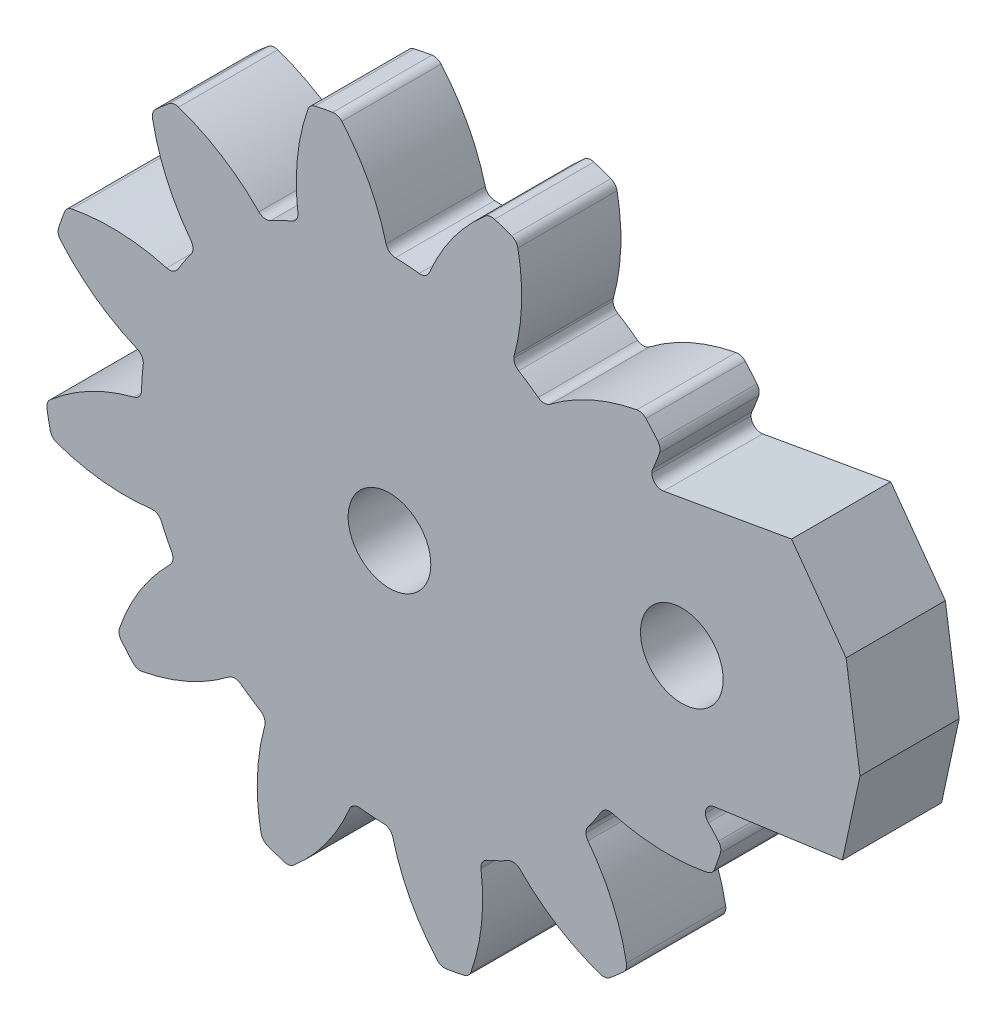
ISO-10303-21;
HEADER;
FILE_DESCRIPTION(('STEP AP214'),'2;1');
FILE_NAME('part.step','',(''),(''),'','','');
FILE_SCHEMA(('AUTOMOTIVE_DESIGN { 1 0 10303 214 1 1 1 1 }'));
ENDSEC;
DATA;
#1=APPLICATION_CONTEXT('core data for automotive mechanical design processes');
#2=APPLICATION_PROTOCOL_DEFINITION('international standard','automotive_design',2000,#1);
#3=PRODUCT_CONTEXT('',#1,'mechanical');
#4=PRODUCT('Part','Part','',(#3));
#5=PRODUCT_RELATED_PRODUCT_CATEGORY('part','',(#4));
#6=PRODUCT_DEFINITION_FORMATION('','',#4);
#7=PRODUCT_DEFINITION_CONTEXT('part definition',#1,'design');
#8=PRODUCT_DEFINITION('design','',#6,#7);
#9=PRODUCT_DEFINITION_SHAPE('','',#8);
#10=(LENGTH_UNIT() NAMED_UNIT(*) SI_UNIT(.MILLI.,.METRE.));
#11=(NAMED_UNIT(*) PLANE_ANGLE_UNIT() SI_UNIT($,.RADIAN.));
#12=(NAMED_UNIT(*) SI_UNIT($,.STERADIAN.) SOLID_ANGLE_UNIT());
#13=UNCERTAINTY_MEASURE_WITH_UNIT(LENGTH_MEASURE(1.E-05),#10,'distance_accuracy_value','');
#14=(GEOMETRIC_REPRESENTATION_CONTEXT(3) GLOBAL_UNCERTAINTY_ASSIGNED_CONTEXT((#13)) GLOBAL_UNIT_ASSIGNED_CONTEXT((#10,
#11,#12)) REPRESENTATION_CONTEXT('',''));
#15=CARTESIAN_POINT('',(0.,0.,0.));
#16=DIRECTION('',(0.,0.,1.));
#17=DIRECTION('',(1.,0.,0.));
#18=AXIS2_PLACEMENT_3D('',#15,#16,#17);
#19=CARTESIAN_POINT('',(103.488462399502,32.6199257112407,3.15));
#20=DIRECTION('',(0.,0.,-1.));
#21=DIRECTION('',(-1.,0.,0.));
#22=AXIS2_PLACEMENT_3D('',#19,#20,#21);
#23=CYLINDRICAL_SURFACE('',#22,6.87500000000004);
#24=DIRECTION('',(0.,0.,-1.));
#25=VECTOR('',#24,1.);
#26=CARTESIAN_POINT('',(96.8625479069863,34.4537419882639,3.15));
#27=LINE('',#26,#25);
#28=CARTESIAN_POINT('',(96.8625479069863,34.4537419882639,3.15));
#29=VERTEX_POINT('',#28);
#30=CARTESIAN_POINT('',(96.8625479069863,34.4537419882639,-0.15));
#31=VERTEX_POINT('',#30);
#32=EDGE_CURVE('E660',#29,#31,#27,.T.);
#33=ORIENTED_EDGE('',*,*,#32,.T.);
#34=CARTESIAN_POINT('',(103.488462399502,32.6199257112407,-0.15));
#35=DIRECTION('',(0.,0.,-1.));
#36=DIRECTION('',(-1.,0.,0.));
#37=AXIS2_PLACEMENT_3D('',#34,#35,#36);
#38=CIRCLE('',#37,6.87500000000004);
#39=CARTESIAN_POINT('',(96.6134623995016,32.6199257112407,-0.15));
#40=VERTEX_POINT('',#39);
#41=EDGE_CURVE('E669',#31,#40,#38,.F.);
#42=ORIENTED_EDGE('',*,*,#41,.T.);
#43=DIRECTION('',(0.,0.,-1.));
#44=VECTOR('',#43,1.);
#45=CARTESIAN_POINT('',(96.6134623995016,32.6199257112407,3.15));
#46=LINE('',#45,#44);
#47=CARTESIAN_POINT('',(96.6134623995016,32.6199257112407,3.15));
#48=VERTEX_POINT('',#47);
#49=EDGE_CURVE('E667',#48,#40,#46,.T.);
#50=ORIENTED_EDGE('',*,*,#49,.F.);
#51=CARTESIAN_POINT('',(103.488462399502,32.6199257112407,3.15));
#52=DIRECTION('',(0.,0.,-1.));
#53=DIRECTION('',(-1.,0.,0.));
#54=AXIS2_PLACEMENT_3D('',#51,#52,#53);
#55=CIRCLE('',#54,6.87500000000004);
#56=EDGE_CURVE('E652',#48,#29,#55,.T.);
#57=ORIENTED_EDGE('',*,*,#56,.T.);
#58=EDGE_LOOP('',(#33,#42,#50,#57));
#59=FACE_BOUND('',#58,.T.);
#60=ADVANCED_FACE('F33',(#59),#23,.T.);
#61=CARTESIAN_POINT('',(103.488462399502,32.6199257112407,3.15));
#62=DIRECTION('',(0.,0.,-1.));
#63=DIRECTION('',(-1.,0.,0.));
#64=AXIS2_PLACEMENT_3D('',#61,#62,#63);
#65=CYLINDRICAL_SURFACE('',#64,6.87500000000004);
#66=CARTESIAN_POINT('',(103.488462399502,32.6199257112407,-0.15));
#67=DIRECTION('',(0.,0.,-1.));
#68=DIRECTION('',(-1.,0.,0.));
#69=AXIS2_PLACEMENT_3D('',#66,#67,#68);
#70=CIRCLE('',#69,6.87500000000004);
#71=CARTESIAN_POINT('',(96.7412410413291,31.3005967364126,-0.15));
#72=VERTEX_POINT('',#71);
#73=EDGE_CURVE('E661',#40,#72,#70,.F.);
#74=ORIENTED_EDGE('',*,*,#73,.T.);
#75=DIRECTION('',(0.,0.,-1.));
#76=VECTOR('',#75,1.);
#77=CARTESIAN_POINT('',(96.7412410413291,31.3005967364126,3.15));
#78=LINE('',#77,#76);
#79=CARTESIAN_POINT('',(96.7412410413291,31.3005967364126,3.15));
#80=VERTEX_POINT('',#79);
#81=EDGE_CURVE('E678',#80,#72,#78,.T.);
#82=ORIENTED_EDGE('',*,*,#81,.F.);
#83=CARTESIAN_POINT('',(103.488462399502,32.6199257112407,3.15));
#84=DIRECTION('',(0.,0.,-1.));
#85=DIRECTION('',(-1.,0.,0.));
#86=AXIS2_PLACEMENT_3D('',#83,#84,#85);
#87=CIRCLE('',#86,6.87500000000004);
#88=EDGE_CURVE('E681',#80,#48,#87,.T.);
#89=ORIENTED_EDGE('',*,*,#88,.T.);
#90=ORIENTED_EDGE('',*,*,#49,.T.);
#91=EDGE_LOOP('',(#74,#82,#89,#90));
#92=FACE_BOUND('',#91,.T.);
#93=ADVANCED_FACE('F1269',(#92),#65,.T.);
#94=CARTESIAN_POINT('',(96.5445040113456,34.541765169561,3.15));
#95=DIRECTION('',(0.,0.,-1.));
#96=DIRECTION('',(-1.,0.,0.));
#97=AXIS2_PLACEMENT_3D('',#94,#95,#96);
#98=CYLINDRICAL_SURFACE('',#97,0.33000000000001);
#99=ORIENTED_EDGE('',*,*,#32,.F.);
#100=CARTESIAN_POINT('',(96.5445040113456,34.541765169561,3.15));
#101=DIRECTION('',(0.,0.,-1.));
#102=DIRECTION('',(-1.,0.,0.));
#103=AXIS2_PLACEMENT_3D('',#100,#101,#102);
#104=CIRCLE('',#103,0.33000000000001);
#105=CARTESIAN_POINT('',(96.7163499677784,34.8234901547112,3.15));
#106=VERTEX_POINT('',#105);
#107=EDGE_CURVE('E647',#106,#29,#104,.T.);
#108=ORIENTED_EDGE('',*,*,#107,.F.);
#109=DIRECTION('',(0.,0.,-1.));
#110=VECTOR('',#109,1.);
#111=CARTESIAN_POINT('',(96.7163499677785,34.8234901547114,3.15));
#112=LINE('',#111,#110);
#113=CARTESIAN_POINT('',(96.7163499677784,34.8234901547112,-0.15));
#114=VERTEX_POINT('',#113);
#115=EDGE_CURVE('E1196',#114,#106,#112,.F.);
#116=ORIENTED_EDGE('',*,*,#115,.F.);
#117=CARTESIAN_POINT('',(96.5445040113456,34.541765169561,-0.15));
#118=DIRECTION('',(0.,0.,-1.));
#119=DIRECTION('',(-1.,0.,0.));
#120=AXIS2_PLACEMENT_3D('',#117,#118,#119);
#121=CIRCLE('',#120,0.33000000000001);
#122=EDGE_CURVE('E672',#31,#114,#121,.F.);
#123=ORIENTED_EDGE('',*,*,#122,.F.);
#124=EDGE_LOOP('',(#99,#108,#116,#123));
#125=FACE_BOUND('',#124,.T.);
#126=ADVANCED_FACE('F671',(#125),#98,.F.);
#127=CARTESIAN_POINT('',(97.0651076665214,31.3639245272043,3.15));
#128=DIRECTION('',(0.,0.,-1.));
#129=DIRECTION('',(-1.,0.,0.));
#130=AXIS2_PLACEMENT_3D('',#127,#128,#129);
#131=CYLINDRICAL_SURFACE('',#130,0.329999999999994);
#132=CARTESIAN_POINT('',(97.0651076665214,31.3639245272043,3.15));
#133=DIRECTION('',(0.,0.,-1.));
#134=DIRECTION('',(-1.,0.,0.));
#135=AXIS2_PLACEMENT_3D('',#132,#133,#134);
#136=CIRCLE('',#135,0.329999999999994);
#137=CARTESIAN_POINT('',(96.9490079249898,31.0550218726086,3.15));
#138=VERTEX_POINT('',#137);
#139=EDGE_CURVE('E1254',#138,#80,#136,.T.);
#140=ORIENTED_EDGE('',*,*,#139,.T.);
#141=ORIENTED_EDGE('',*,*,#81,.T.);
#142=CARTESIAN_POINT('',(97.0651076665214,31.3639245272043,-0.15));
#143=DIRECTION('',(0.,0.,-1.));
#144=DIRECTION('',(-1.,0.,0.));
#145=AXIS2_PLACEMENT_3D('',#142,#143,#144);
#146=CIRCLE('',#145,0.329999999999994);
#147=CARTESIAN_POINT('',(96.9490079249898,31.0550218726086,-0.15));
#148=VERTEX_POINT('',#147);
#149=EDGE_CURVE('E674',#72,#148,#146,.F.);
#150=ORIENTED_EDGE('',*,*,#149,.T.);
#151=DIRECTION('',(0.,0.,-1.));
#152=VECTOR('',#151,1.);
#153=CARTESIAN_POINT('',(96.9490079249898,31.0550218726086,3.15));
#154=LINE('',#153,#152);
#155=EDGE_CURVE('E1183',#138,#148,#154,.T.);
#156=ORIENTED_EDGE('',*,*,#155,.F.);
#157=EDGE_LOOP('',(#140,#141,#150,#156));
#158=FACE_BOUND('',#157,.T.);
#159=ADVANCED_FACE('F1274',(#158),#131,.T.);
#160=CARTESIAN_POINT('',(111.705053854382,38.4669577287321,3.15));
#161=DIRECTION('',(0.,0.,-1.));
#162=DIRECTION('',(-1.,0.,0.));
#163=AXIS2_PLACEMENT_3D('',#160,#161,#162);
#164=CYLINDRICAL_SURFACE('',#163,0.33000000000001);
#165=CARTESIAN_POINT('',(111.705053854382,38.4669577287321,3.15));
#166=DIRECTION('',(0.,0.,-1.));
#167=DIRECTION('',(-1.,0.,0.));
#168=AXIS2_PLACEMENT_3D('',#165,#166,#167);
#169=CIRCLE('',#168,0.33000000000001);
#170=CARTESIAN_POINT('',(111.955238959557,38.6821493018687,3.15));
#171=VERTEX_POINT('',#170);
#172=CARTESIAN_POINT('',(112.019540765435,38.3669678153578,3.15));
#173=VERTEX_POINT('',#172);
#174=EDGE_CURVE('E1249',#171,#173,#169,.T.);
#175=ORIENTED_EDGE('',*,*,#174,.T.);
#176=DIRECTION('',(0.,0.,-1.));
#177=VECTOR('',#176,1.);
#178=CARTESIAN_POINT('',(112.019540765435,38.3669678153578,3.15));
#179=LINE('',#178,#177);
#180=CARTESIAN_POINT('',(112.019540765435,38.3669678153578,-0.15));
#181=VERTEX_POINT('',#180);
#182=EDGE_CURVE('E1152',#181,#173,#179,.F.);
#183=ORIENTED_EDGE('',*,*,#182,.F.);
#184=CARTESIAN_POINT('',(111.705053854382,38.4669577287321,-0.15));
#185=DIRECTION('',(0.,0.,-1.));
#186=DIRECTION('',(-1.,0.,0.));
#187=AXIS2_PLACEMENT_3D('',#184,#185,#186);
#188=CIRCLE('',#187,0.33000000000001);
#189=CARTESIAN_POINT('',(111.955238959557,38.6821493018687,-0.15));
#190=VERTEX_POINT('',#189);
#191=EDGE_CURVE('E1251',#181,#190,#188,.F.);
#192=ORIENTED_EDGE('',*,*,#191,.T.);
#193=DIRECTION('',(0.,0.,-1.));
#194=VECTOR('',#193,1.);
#195=CARTESIAN_POINT('',(111.955238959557,38.6821493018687,3.15));
#196=LINE('',#195,#194);
#197=EDGE_CURVE('E1242',#171,#190,#196,.T.);
#198=ORIENTED_EDGE('',*,*,#197,.F.);
#199=EDGE_LOOP('',(#175,#183,#192,#198));
#200=FACE_BOUND('',#199,.T.);
#201=ADVANCED_FACE('F1426',(#200),#164,.T.);
#202=CARTESIAN_POINT('',(106.743049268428,34.1989915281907,3.15));
#203=DIRECTION('',(0.,0.,-1.));
#204=DIRECTION('',(-1.,0.,0.));
#205=AXIS2_PLACEMENT_3D('',#202,#203,#204);
#206=CYLINDRICAL_SURFACE('',#205,6.87500000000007);
#207=CARTESIAN_POINT('',(106.743049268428,34.1989915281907,3.15));
#208=DIRECTION('',(0.,0.,-1.));
#209=DIRECTION('',(-1.,0.,0.));
#210=AXIS2_PLACEMENT_3D('',#207,#208,#209);
#211=CIRCLE('',#210,6.87500000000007);
#212=CARTESIAN_POINT('',(111.620719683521,39.0439844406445,3.15));
#213=VERTEX_POINT('',#212);
#214=EDGE_CURVE('E1243',#213,#171,#211,.T.);
#215=ORIENTED_EDGE('',*,*,#214,.T.);
#216=ORIENTED_EDGE('',*,*,#197,.T.);
#217=CARTESIAN_POINT('',(106.743049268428,34.1989915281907,-0.15));
#218=DIRECTION('',(0.,0.,-1.));
#219=DIRECTION('',(-1.,0.,0.));
#220=AXIS2_PLACEMENT_3D('',#217,#218,#219);
#221=CIRCLE('',#220,6.87500000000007);
#222=CARTESIAN_POINT('',(111.620719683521,39.0439844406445,-0.15));
#223=VERTEX_POINT('',#222);
#224=EDGE_CURVE('E1246',#190,#223,#221,.F.);
#225=ORIENTED_EDGE('',*,*,#224,.T.);
#226=DIRECTION('',(0.,0.,-1.));
#227=VECTOR('',#226,1.);
#228=CARTESIAN_POINT('',(111.620719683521,39.0439844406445,3.15));
#229=LINE('',#228,#227);
#230=EDGE_CURVE('E1141',#223,#213,#229,.F.);
#231=ORIENTED_EDGE('',*,*,#230,.T.);
#232=EDGE_LOOP('',(#215,#216,#225,#231));
#233=FACE_BOUND('',#232,.T.);
#234=ADVANCED_FACE('F1423',(#233),#206,.T.);
#235=CARTESIAN_POINT('',(103.491596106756,51.1124641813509,3.15));
#236=DIRECTION('',(0.,0.,-1.));
#237=DIRECTION('',(-1.,0.,0.));
#238=AXIS2_PLACEMENT_3D('',#235,#236,#237);
#239=CYLINDRICAL_SURFACE('',#238,6.87500000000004);
#240=CARTESIAN_POINT('',(103.491596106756,51.1124641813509,3.15));
#241=DIRECTION('',(0.,0.,-1.));
#242=DIRECTION('',(-1.,0.,0.));
#243=AXIS2_PLACEMENT_3D('',#240,#241,#242);
#244=CIRCLE('',#243,6.87500000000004);
#245=CARTESIAN_POINT('',(109.994525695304,48.8814259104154,3.15));
#246=VERTEX_POINT('',#245);
#247=CARTESIAN_POINT('',(109.770048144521,48.3112742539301,3.15));
#248=VERTEX_POINT('',#247);
#249=EDGE_CURVE('E1237',#246,#248,#244,.T.);
#250=ORIENTED_EDGE('',*,*,#249,.T.);
#251=DIRECTION('',(0.,0.,-1.));
#252=VECTOR('',#251,1.);
#253=CARTESIAN_POINT('',(109.770048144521,48.3112742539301,3.15));
#254=LINE('',#253,#252);
#255=CARTESIAN_POINT('',(109.770048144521,48.3112742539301,-0.15));
#256=VERTEX_POINT('',#255);
#257=EDGE_CURVE('E1138',#248,#256,#254,.T.);
#258=ORIENTED_EDGE('',*,*,#257,.T.);
#259=CARTESIAN_POINT('',(103.491596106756,51.1124641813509,-0.15));
#260=DIRECTION('',(0.,0.,-1.));
#261=DIRECTION('',(-1.,0.,0.));
#262=AXIS2_PLACEMENT_3D('',#259,#260,#261);
#263=CIRCLE('',#262,6.87500000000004);
#264=CARTESIAN_POINT('',(109.994525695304,48.8814259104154,-0.15));
#265=VERTEX_POINT('',#264);
#266=EDGE_CURVE('E1239',#256,#265,#263,.F.);
#267=ORIENTED_EDGE('',*,*,#266,.T.);
#268=DIRECTION('',(0.,0.,-1.));
#269=VECTOR('',#268,1.);
#270=CARTESIAN_POINT('',(109.994525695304,48.8814259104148,3.15));
#271=LINE('',#270,#269);
#272=EDGE_CURVE('E1230',#246,#265,#271,.T.);
#273=ORIENTED_EDGE('',*,*,#272,.F.);
#274=EDGE_LOOP('',(#250,#258,#267,#273));
#275=FACE_BOUND('',#274,.T.);
#276=ADVANCED_FACE('F2054',(#275),#239,.T.);
#277=CARTESIAN_POINT('',(109.682385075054,48.988515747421,3.15));
#278=DIRECTION('',(0.,0.,-1.));
#279=DIRECTION('',(-1.,0.,0.));
#280=AXIS2_PLACEMENT_3D('',#277,#278,#279);
#281=CYLINDRICAL_SURFACE('',#280,0.330000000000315);
#282=CARTESIAN_POINT('',(109.682385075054,48.988515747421,3.15));
#283=DIRECTION('',(0.,0.,-1.));
#284=DIRECTION('',(-1.,0.,0.));
#285=AXIS2_PLACEMENT_3D('',#282,#283,#284);
#286=CIRCLE('',#285,0.330000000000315);
#287=CARTESIAN_POINT('',(109.937381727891,49.1979834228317,3.15));
#288=VERTEX_POINT('',#287);
#289=EDGE_CURVE('E1231',#288,#246,#286,.T.);
#290=ORIENTED_EDGE('',*,*,#289,.T.);
#291=ORIENTED_EDGE('',*,*,#272,.T.);
#292=CARTESIAN_POINT('',(109.682385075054,48.988515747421,-0.15));
#293=DIRECTION('',(0.,0.,-1.));
#294=DIRECTION('',(-1.,0.,0.));
#295=AXIS2_PLACEMENT_3D('',#292,#293,#294);
#296=CIRCLE('',#295,0.330000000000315);
#297=CARTESIAN_POINT('',(109.937381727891,49.1979834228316,-0.15));
#298=VERTEX_POINT('',#297);
#299=EDGE_CURVE('E1234',#265,#298,#296,.F.);
#300=ORIENTED_EDGE('',*,*,#299,.T.);
#301=DIRECTION('',(0.,0.,-1.));
#302=VECTOR('',#301,1.);
#303=CARTESIAN_POINT('',(109.937381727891,49.1979834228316,3.15));
#304=LINE('',#303,#302);
#305=EDGE_CURVE('E1121',#288,#298,#304,.T.);
#306=ORIENTED_EDGE('',*,*,#305,.F.);
#307=EDGE_LOOP('',(#290,#291,#300,#306));
#308=FACE_BOUND('',#307,.T.);
#309=ADVANCED_FACE('F2059',(#308),#281,.T.);
#310=CARTESIAN_POINT('',(90.3199439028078,45.2662718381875,3.15));
#311=DIRECTION('',(0.,0.,-1.));
#312=DIRECTION('',(-1.,0.,0.));
#313=AXIS2_PLACEMENT_3D('',#310,#311,#312);
#314=CYLINDRICAL_SURFACE('',#313,0.330000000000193);
#315=DIRECTION('',(0.,0.,-1.));
#316=VECTOR('',#315,1.);
#317=CARTESIAN_POINT('',(90.0054569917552,45.3662617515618,3.15));
#318=LINE('',#317,#316);
#319=CARTESIAN_POINT('',(90.0054569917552,45.3662617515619,-0.15));
#320=VERTEX_POINT('',#319);
#321=CARTESIAN_POINT('',(90.0054569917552,45.3662617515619,3.15));
#322=VERTEX_POINT('',#321);
#323=EDGE_CURVE('E1082',#320,#322,#318,.F.);
#324=ORIENTED_EDGE('',*,*,#323,.F.);
#325=CARTESIAN_POINT('',(90.3199439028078,45.2662718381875,-0.15));
#326=DIRECTION('',(0.,0.,-1.));
#327=DIRECTION('',(-1.,0.,0.));
#328=AXIS2_PLACEMENT_3D('',#325,#326,#327);
#329=CIRCLE('',#328,0.330000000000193);
#330=CARTESIAN_POINT('',(89.9899439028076,45.2662718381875,-0.15));
#331=VERTEX_POINT('',#330);
#332=EDGE_CURVE('E1226',#320,#331,#329,.F.);
#333=ORIENTED_EDGE('',*,*,#332,.T.);
#334=DIRECTION('',(0.,0.,-1.));
#335=VECTOR('',#334,1.);
#336=CARTESIAN_POINT('',(89.9899439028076,45.2662718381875,3.15));
#337=LINE('',#336,#335);
#338=CARTESIAN_POINT('',(89.9899439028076,45.2662718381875,3.15));
#339=VERTEX_POINT('',#338);
#340=EDGE_CURVE('E1073',#339,#331,#337,.T.);
#341=ORIENTED_EDGE('',*,*,#340,.F.);
#342=CARTESIAN_POINT('',(90.3199439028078,45.2662718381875,3.15));
#343=DIRECTION('',(0.,0.,-1.));
#344=DIRECTION('',(-1.,0.,0.));
#345=AXIS2_PLACEMENT_3D('',#342,#343,#344);
#346=CIRCLE('',#345,0.330000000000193);
#347=EDGE_CURVE('E1228',#339,#322,#346,.T.);
#348=ORIENTED_EDGE('',*,*,#347,.T.);
#349=EDGE_LOOP('',(#324,#333,#341,#348));
#350=FACE_BOUND('',#349,.T.);
#351=ADVANCED_FACE('F2155',(#350),#314,.T.);
#352=CARTESIAN_POINT('',(89.9432067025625,40.0338107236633,3.15));
#353=DIRECTION('',(0.,0.,-1.));
#354=DIRECTION('',(-1.,0.,0.));
#355=AXIS2_PLACEMENT_3D('',#352,#353,#354);
#356=CYLINDRICAL_SURFACE('',#355,0.330000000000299);
#357=CARTESIAN_POINT('',(89.9432067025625,40.0338107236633,-0.15));
#358=DIRECTION('',(0.,0.,-1.));
#359=DIRECTION('',(-1.,0.,0.));
#360=AXIS2_PLACEMENT_3D('',#357,#358,#359);
#361=CIRCLE('',#360,0.330000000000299);
#362=CARTESIAN_POINT('',(89.6132067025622,40.0338107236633,-0.15));
#363=VERTEX_POINT('',#362);
#364=CARTESIAN_POINT('',(89.6176392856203,39.9799047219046,-0.15));
#365=VERTEX_POINT('',#364);
#366=EDGE_CURVE('E1221',#363,#365,#361,.F.);
#367=ORIENTED_EDGE('',*,*,#366,.T.);
#368=DIRECTION('',(0.,0.,-1.));
#369=VECTOR('',#368,1.);
#370=CARTESIAN_POINT('',(89.6176392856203,39.9799047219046,3.15));
#371=LINE('',#370,#369);
#372=CARTESIAN_POINT('',(89.6176392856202,39.9799047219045,3.15));
#373=VERTEX_POINT('',#372);
#374=EDGE_CURVE('E1210',#373,#365,#371,.T.);
#375=ORIENTED_EDGE('',*,*,#374,.F.);
#376=CARTESIAN_POINT('',(89.9432067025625,40.0338107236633,3.15));
#377=DIRECTION('',(0.,0.,-1.));
#378=DIRECTION('',(-1.,0.,0.));
#379=AXIS2_PLACEMENT_3D('',#376,#377,#378);
#380=CIRCLE('',#379,0.330000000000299);
#381=CARTESIAN_POINT('',(89.6132067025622,40.0338107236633,3.15));
#382=VERTEX_POINT('',#381);
#383=EDGE_CURVE('E1224',#373,#382,#380,.T.);
#384=ORIENTED_EDGE('',*,*,#383,.T.);
#385=DIRECTION('',(0.,0.,-1.));
#386=VECTOR('',#385,1.);
#387=CARTESIAN_POINT('',(89.6132067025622,40.0338107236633,3.15));
#388=LINE('',#387,#386);
#389=EDGE_CURVE('E1069',#363,#382,#388,.F.);
#390=ORIENTED_EDGE('',*,*,#389,.F.);
#391=EDGE_LOOP('',(#367,#375,#384,#390));
#392=FACE_BOUND('',#391,.T.);
#393=ADVANCED_FACE('F2183',(#392),#356,.T.);
#394=CARTESIAN_POINT('',(101.012498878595,41.8666147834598,3.15));
#395=DIRECTION('',(0.,0.,-1.));
#396=DIRECTION('',(-1.,0.,0.));
#397=AXIS2_PLACEMENT_3D('',#394,#395,#396);
#398=CYLINDRICAL_SURFACE('',#397,8.24999999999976);
#399=CARTESIAN_POINT('',(101.012498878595,41.8666147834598,3.15));
#400=DIRECTION('',(0.,0.,-1.));
#401=DIRECTION('',(-1.,0.,0.));
#402=AXIS2_PLACEMENT_3D('',#399,#400,#401);
#403=CIRCLE('',#402,8.24999999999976);
#404=CARTESIAN_POINT('',(92.7648995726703,42.0656265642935,3.15));
#405=VERTEX_POINT('',#404);
#406=CARTESIAN_POINT('',(92.821459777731,42.851184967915,3.15));
#407=VERTEX_POINT('',#406);
#408=EDGE_CURVE('E1216',#405,#407,#403,.T.);
#409=ORIENTED_EDGE('',*,*,#408,.T.);
#410=DIRECTION('',(0.,0.,-1.));
#411=VECTOR('',#410,1.);
#412=CARTESIAN_POINT('',(92.821459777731,42.851184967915,3.15));
#413=LINE('',#412,#411);
#414=CARTESIAN_POINT('',(92.8214597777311,42.851184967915,-0.15));
#415=VERTEX_POINT('',#414);
#416=EDGE_CURVE('E1074',#407,#415,#413,.T.);
#417=ORIENTED_EDGE('',*,*,#416,.T.);
#418=CARTESIAN_POINT('',(101.012498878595,41.8666147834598,-0.15));
#419=DIRECTION('',(0.,0.,-1.));
#420=DIRECTION('',(-1.,0.,0.));
#421=AXIS2_PLACEMENT_3D('',#418,#419,#420);
#422=CIRCLE('',#421,8.24999999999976);
#423=CARTESIAN_POINT('',(92.7648995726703,42.0656265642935,-0.15));
#424=VERTEX_POINT('',#423);
#425=EDGE_CURVE('E1219',#415,#424,#422,.F.);
#426=ORIENTED_EDGE('',*,*,#425,.T.);
#427=DIRECTION('',(0.,0.,-1.));
#428=VECTOR('',#427,1.);
#429=CARTESIAN_POINT('',(92.7648995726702,42.0656265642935,3.15));
#430=LINE('',#429,#428);
#431=EDGE_CURVE('E1066',#424,#405,#430,.F.);
#432=ORIENTED_EDGE('',*,*,#431,.T.);
#433=EDGE_LOOP('',(#409,#417,#426,#432));
#434=FACE_BOUND('',#433,.T.);
#435=ADVANCED_FACE('F2168',(#434),#398,.T.);
#436=CARTESIAN_POINT('',(101.012498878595,41.8666147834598,3.15));
#437=DIRECTION('',(0.,0.,-1.));
#438=DIRECTION('',(-1.,0.,0.));
#439=AXIS2_PLACEMENT_3D('',#436,#437,#438);
#440=CYLINDRICAL_SURFACE('',#439,11.549999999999);
#441=CARTESIAN_POINT('',(101.012498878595,41.8666147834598,3.15));
#442=DIRECTION('',(0.,0.,-1.));
#443=DIRECTION('',(-1.,0.,0.));
#444=AXIS2_PLACEMENT_3D('',#441,#442,#443);
#445=CIRCLE('',#444,11.549999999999);
#446=CARTESIAN_POINT('',(89.7302975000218,39.3938770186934,3.15));
#447=VERTEX_POINT('',#446);
#448=EDGE_CURVE('E1211',#447,#373,#445,.T.);
#449=ORIENTED_EDGE('',*,*,#448,.T.);
#450=ORIENTED_EDGE('',*,*,#374,.T.);
#451=CARTESIAN_POINT('',(101.012498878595,41.8666147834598,-0.15));
#452=DIRECTION('',(0.,0.,-1.));
#453=DIRECTION('',(-1.,0.,0.));
#454=AXIS2_PLACEMENT_3D('',#451,#452,#453);
#455=CIRCLE('',#454,11.549999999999);
#456=CARTESIAN_POINT('',(89.7302975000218,39.3938770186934,-0.15));
#457=VERTEX_POINT('',#456);
#458=EDGE_CURVE('E1214',#365,#457,#455,.F.);
#459=ORIENTED_EDGE('',*,*,#458,.T.);
#460=DIRECTION('',(0.,0.,-1.));
#461=VECTOR('',#460,1.);
#462=CARTESIAN_POINT('',(89.7302975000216,39.3938770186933,3.15));
#463=LINE('',#462,#461);
#464=EDGE_CURVE('E1060',#447,#457,#463,.T.);
#465=ORIENTED_EDGE('',*,*,#464,.F.);
#466=EDGE_LOOP('',(#449,#450,#459,#465));
#467=FACE_BOUND('',#466,.T.);
#468=ADVANCED_FACE('F2188',(#467),#440,.T.);
#469=CARTESIAN_POINT('',(92.3426126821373,34.7447138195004,3.15));
#470=DIRECTION('',(0.,0.,-1.));
#471=DIRECTION('',(-1.,0.,0.));
#472=AXIS2_PLACEMENT_3D('',#469,#470,#471);
#473=CYLINDRICAL_SURFACE('',#472,0.330000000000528);
#474=CARTESIAN_POINT('',(92.3426126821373,34.7447138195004,-0.15));
#475=DIRECTION('',(0.,0.,-1.));
#476=DIRECTION('',(-1.,0.,0.));
#477=AXIS2_PLACEMENT_3D('',#474,#475,#476);
#478=CIRCLE('',#477,0.330000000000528);
#479=CARTESIAN_POINT('',(92.0126126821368,34.7447138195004,-0.15));
#480=VERTEX_POINT('',#479);
#481=CARTESIAN_POINT('',(92.0876160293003,34.5352461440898,-0.15));
#482=VERTEX_POINT('',#481);
#483=EDGE_CURVE('E1205',#480,#482,#478,.F.);
#484=ORIENTED_EDGE('',*,*,#483,.T.);
#485=DIRECTION('',(0.,0.,-1.));
#486=VECTOR('',#485,1.);
#487=CARTESIAN_POINT('',(92.0876160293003,34.5352461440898,3.15));
#488=LINE('',#487,#486);
#489=CARTESIAN_POINT('',(92.0876160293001,34.5352461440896,3.15));
#490=VERTEX_POINT('',#489);
#491=EDGE_CURVE('E1189',#490,#482,#488,.T.);
#492=ORIENTED_EDGE('',*,*,#491,.F.);
#493=CARTESIAN_POINT('',(92.3426126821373,34.7447138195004,3.15));
#494=DIRECTION('',(0.,0.,-1.));
#495=DIRECTION('',(-1.,0.,0.));
#496=AXIS2_PLACEMENT_3D('',#493,#494,#495);
#497=CIRCLE('',#496,0.330000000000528);
#498=CARTESIAN_POINT('',(92.0126126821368,34.7447138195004,3.15));
#499=VERTEX_POINT('',#498);
#500=EDGE_CURVE('E1208',#490,#499,#497,.T.);
#501=ORIENTED_EDGE('',*,*,#500,.T.);
#502=DIRECTION('',(0.,0.,-1.));
#503=VECTOR('',#502,1.);
#504=CARTESIAN_POINT('',(92.0126126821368,34.7447138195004,3.15));
#505=LINE('',#504,#503);
#506=EDGE_CURVE('E1056',#480,#499,#505,.F.);
#507=ORIENTED_EDGE('',*,*,#506,.F.);
#508=EDGE_LOOP('',(#484,#492,#501,#507));
#509=FACE_BOUND('',#508,.T.);
#510=ADVANCED_FACE('F2214',(#509),#473,.T.);
#511=CARTESIAN_POINT('',(101.012498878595,41.8666147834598,3.15));
#512=DIRECTION('',(0.,0.,-1.));
#513=DIRECTION('',(-1.,0.,0.));
#514=AXIS2_PLACEMENT_3D('',#511,#512,#513);
#515=CYLINDRICAL_SURFACE('',#514,8.24999999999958);
#516=CARTESIAN_POINT('',(101.012498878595,41.8666147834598,3.15));
#517=DIRECTION('',(0.,0.,-1.));
#518=DIRECTION('',(-1.,0.,0.));
#519=AXIS2_PLACEMENT_3D('',#516,#517,#518);
#520=CIRCLE('',#519,8.24999999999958);
#521=CARTESIAN_POINT('',(93.7703624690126,37.9151643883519,3.15));
#522=VERTEX_POINT('',#521);
#523=CARTESIAN_POINT('',(93.4265658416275,38.6237580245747,3.15));
#524=VERTEX_POINT('',#523);
#525=EDGE_CURVE('E1200',#522,#524,#520,.T.);
#526=ORIENTED_EDGE('',*,*,#525,.T.);
#527=DIRECTION('',(0.,0.,-1.));
#528=VECTOR('',#527,1.);
#529=CARTESIAN_POINT('',(93.4265658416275,38.6237580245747,3.15));
#530=LINE('',#529,#528);
#531=CARTESIAN_POINT('',(93.4265658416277,38.6237580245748,-0.15));
#532=VERTEX_POINT('',#531);
#533=EDGE_CURVE('E1061',#524,#532,#530,.T.);
#534=ORIENTED_EDGE('',*,*,#533,.T.);
#535=CARTESIAN_POINT('',(101.012498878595,41.8666147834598,-0.15));
#536=DIRECTION('',(0.,0.,-1.));
#537=DIRECTION('',(-1.,0.,0.));
#538=AXIS2_PLACEMENT_3D('',#535,#536,#537);
#539=CIRCLE('',#538,8.24999999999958);
#540=CARTESIAN_POINT('',(93.7703624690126,37.9151643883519,-0.15));
#541=VERTEX_POINT('',#540);
#542=EDGE_CURVE('E1203',#532,#541,#539,.F.);
#543=ORIENTED_EDGE('',*,*,#542,.T.);
#544=DIRECTION('',(0.,0.,-1.));
#545=VECTOR('',#544,1.);
#546=CARTESIAN_POINT('',(93.7703624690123,37.9151643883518,3.15));
#547=LINE('',#546,#545);
#548=EDGE_CURVE('E1053',#541,#522,#547,.F.);
#549=ORIENTED_EDGE('',*,*,#548,.T.);
#550=EDGE_LOOP('',(#526,#534,#543,#549));
#551=FACE_BOUND('',#550,.T.);
#552=ADVANCED_FACE('F2198',(#551),#515,.T.);
#553=CARTESIAN_POINT('',(101.012498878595,41.8666147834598,3.15));
#554=DIRECTION('',(0.,0.,-1.));
#555=DIRECTION('',(-1.,0.,0.));
#556=AXIS2_PLACEMENT_3D('',#553,#554,#555);
#557=CYLINDRICAL_SURFACE('',#556,8.24999999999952);
#558=CARTESIAN_POINT('',(101.012498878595,41.8666147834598,3.15));
#559=DIRECTION('',(0.,0.,-1.));
#560=DIRECTION('',(-1.,0.,0.));
#561=AXIS2_PLACEMENT_3D('',#558,#559,#560);
#562=CIRCLE('',#561,8.24999999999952);
#563=CARTESIAN_POINT('',(96.064316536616,35.2652519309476,3.15));
#564=VERTEX_POINT('',#563);
#565=EDGE_CURVE('E655',#106,#564,#562,.T.);
#566=ORIENTED_EDGE('',*,*,#565,.T.);
#567=DIRECTION('',(0.,0.,-1.));
#568=VECTOR('',#567,1.);
#569=CARTESIAN_POINT('',(96.064316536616,35.2652519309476,3.15));
#570=LINE('',#569,#568);
#571=CARTESIAN_POINT('',(96.0643165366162,35.2652519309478,-0.15));
#572=VERTEX_POINT('',#571);
#573=EDGE_CURVE('E1048',#564,#572,#570,.T.);
#574=ORIENTED_EDGE('',*,*,#573,.T.);
#575=CARTESIAN_POINT('',(101.012498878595,41.8666147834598,-0.15));
#576=DIRECTION('',(0.,0.,-1.));
#577=DIRECTION('',(-1.,0.,0.));
#578=AXIS2_PLACEMENT_3D('',#575,#576,#577);
#579=CIRCLE('',#578,8.24999999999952);
#580=EDGE_CURVE('E1197',#572,#114,#579,.F.);
#581=ORIENTED_EDGE('',*,*,#580,.T.);
#582=ORIENTED_EDGE('',*,*,#115,.T.);
#583=EDGE_LOOP('',(#566,#574,#581,#582));
#584=FACE_BOUND('',#583,.T.);
#585=ADVANCED_FACE('F2227',(#584),#557,.T.);
#586=CARTESIAN_POINT('',(101.012498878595,41.8666147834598,3.15));
#587=DIRECTION('',(0.,0.,-1.));
#588=DIRECTION('',(-1.,0.,0.));
#589=AXIS2_PLACEMENT_3D('',#586,#587,#588);
#590=CYLINDRICAL_SURFACE('',#589,11.5499999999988);
#591=CARTESIAN_POINT('',(101.012498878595,41.8666147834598,3.15));
#592=DIRECTION('',(0.,0.,-1.));
#593=DIRECTION('',(-1.,0.,0.));
#594=AXIS2_PLACEMENT_3D('',#591,#592,#593);
#595=CIRCLE('',#594,11.5499999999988);
#596=CARTESIAN_POINT('',(92.4781947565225,34.0840603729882,3.15));
#597=VERTEX_POINT('',#596);
#598=EDGE_CURVE('E1190',#597,#490,#595,.T.);
#599=ORIENTED_EDGE('',*,*,#598,.T.);
#600=ORIENTED_EDGE('',*,*,#491,.T.);
#601=CARTESIAN_POINT('',(101.012498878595,41.8666147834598,-0.15));
#602=DIRECTION('',(0.,0.,-1.));
#603=DIRECTION('',(-1.,0.,0.));
#604=AXIS2_PLACEMENT_3D('',#601,#602,#603);
#605=CIRCLE('',#604,11.5499999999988);
#606=CARTESIAN_POINT('',(92.4781947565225,34.0840603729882,-0.15));
#607=VERTEX_POINT('',#606);
#608=EDGE_CURVE('E1193',#482,#607,#605,.F.);
#609=ORIENTED_EDGE('',*,*,#608,.T.);
#610=DIRECTION('',(0.,0.,-1.));
#611=VECTOR('',#610,1.);
#612=CARTESIAN_POINT('',(92.4781947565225,34.0840603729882,3.15));
#613=LINE('',#612,#611);
#614=EDGE_CURVE('E1044',#597,#607,#613,.T.);
#615=ORIENTED_EDGE('',*,*,#614,.F.);
#616=EDGE_LOOP('',(#599,#600,#609,#615));
#617=FACE_BOUND('',#616,.T.);
#618=ADVANCED_FACE('F2219',(#617),#590,.T.);
#619=CARTESIAN_POINT('',(101.012498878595,41.8666147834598,3.15));
#620=DIRECTION('',(0.,0.,-1.));
#621=DIRECTION('',(-1.,0.,0.));
#622=AXIS2_PLACEMENT_3D('',#619,#620,#621);
#623=CYLINDRICAL_SURFACE('',#622,11.55);
#624=CARTESIAN_POINT('',(101.012498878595,41.8666147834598,3.15));
#625=DIRECTION('',(0.,0.,-1.));
#626=DIRECTION('',(-1.,0.,0.));
#627=AXIS2_PLACEMENT_3D('',#624,#625,#626);
#628=CIRCLE('',#627,11.55);
#629=CARTESIAN_POINT('',(97.5128519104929,30.8595728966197,3.15));
#630=VERTEX_POINT('',#629);
#631=EDGE_CURVE('E1184',#630,#138,#628,.T.);
#632=ORIENTED_EDGE('',*,*,#631,.T.);
#633=ORIENTED_EDGE('',*,*,#155,.T.);
#634=CARTESIAN_POINT('',(101.012498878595,41.8666147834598,-0.15));
#635=DIRECTION('',(0.,0.,-1.));
#636=DIRECTION('',(-1.,0.,0.));
#637=AXIS2_PLACEMENT_3D('',#634,#635,#636);
#638=CIRCLE('',#637,11.55);
#639=CARTESIAN_POINT('',(97.5128519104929,30.8595728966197,-0.15));
#640=VERTEX_POINT('',#639);
#641=EDGE_CURVE('E1187',#148,#640,#638,.F.);
#642=ORIENTED_EDGE('',*,*,#641,.T.);
#643=DIRECTION('',(0.,0.,-1.));
#644=VECTOR('',#643,1.);
#645=CARTESIAN_POINT('',(97.5128519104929,30.8595728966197,3.15));
#646=LINE('',#645,#644);
#647=EDGE_CURVE('E1040',#630,#640,#646,.T.);
#648=ORIENTED_EDGE('',*,*,#647,.F.);
#649=EDGE_LOOP('',(#632,#633,#642,#648));
#650=FACE_BOUND('',#649,.T.);
#651=ADVANCED_FACE('F1277',(#650),#623,.T.);
#652=CARTESIAN_POINT('',(101.012498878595,41.8666147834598,3.15));
#653=DIRECTION('',(0.,0.,-1.));
#654=DIRECTION('',(-1.,0.,0.));
#655=AXIS2_PLACEMENT_3D('',#652,#653,#654);
#656=CYLINDRICAL_SURFACE('',#655,8.24999999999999);
#657=CARTESIAN_POINT('',(101.012498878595,41.8666147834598,3.15));
#658=DIRECTION('',(0.,0.,-1.));
#659=DIRECTION('',(-1.,0.,0.));
#660=AXIS2_PLACEMENT_3D('',#657,#658,#659);
#661=CIRCLE('',#660,8.24999999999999);
#662=CARTESIAN_POINT('',(100.813487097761,33.6190154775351,3.15));
#663=VERTEX_POINT('',#662);
#664=CARTESIAN_POINT('',(100.02792869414,33.6755756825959,3.15));
#665=VERTEX_POINT('',#664);
#666=EDGE_CURVE('E1178',#663,#665,#661,.T.);
#667=ORIENTED_EDGE('',*,*,#666,.T.);
#668=DIRECTION('',(0.,0.,-1.));
#669=VECTOR('',#668,1.);
#670=CARTESIAN_POINT('',(100.02792869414,33.6755756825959,3.15));
#671=LINE('',#670,#669);
#672=CARTESIAN_POINT('',(100.02792869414,33.6755756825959,-0.15));
#673=VERTEX_POINT('',#672);
#674=EDGE_CURVE('E1041',#665,#673,#671,.T.);
#675=ORIENTED_EDGE('',*,*,#674,.T.);
#676=CARTESIAN_POINT('',(101.012498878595,41.8666147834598,-0.15));
#677=DIRECTION('',(0.,0.,-1.));
#678=DIRECTION('',(-1.,0.,0.));
#679=AXIS2_PLACEMENT_3D('',#676,#677,#678);
#680=CIRCLE('',#679,8.24999999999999);
#681=CARTESIAN_POINT('',(100.813487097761,33.6190154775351,-0.15));
#682=VERTEX_POINT('',#681);
#683=EDGE_CURVE('E1181',#673,#682,#680,.F.);
#684=ORIENTED_EDGE('',*,*,#683,.T.);
#685=DIRECTION('',(0.,0.,-1.));
#686=VECTOR('',#685,1.);
#687=CARTESIAN_POINT('',(100.813487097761,33.6190154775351,3.15));
#688=LINE('',#687,#686);
#689=EDGE_CURVE('E1033',#682,#663,#688,.F.);
#690=ORIENTED_EDGE('',*,*,#689,.T.);
#691=EDGE_LOOP('',(#667,#675,#684,#690));
#692=FACE_BOUND('',#691,.T.);
#693=ADVANCED_FACE('F1495',(#692),#656,.T.);
#694=CARTESIAN_POINT('',(104.385069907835,33.9772444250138,3.15));
#695=DIRECTION('',(0.,0.,-1.));
#696=DIRECTION('',(-1.,0.,0.));
#697=AXIS2_PLACEMENT_3D('',#694,#695,#696);
#698=CYLINDRICAL_SURFACE('',#697,0.329999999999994);
#699=DIRECTION('',(0.,0.,-1.));
#700=VECTOR('',#699,1.);
#701=CARTESIAN_POINT('',(104.055069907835,33.9772444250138,3.15));
#702=LINE('',#701,#700);
#703=CARTESIAN_POINT('',(104.055069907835,33.9772444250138,3.15));
#704=VERTEX_POINT('',#703);
#705=CARTESIAN_POINT('',(104.055069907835,33.9772444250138,-0.15));
#706=VERTEX_POINT('',#705);
#707=EDGE_CURVE('E1028',#704,#706,#702,.T.);
#708=ORIENTED_EDGE('',*,*,#707,.T.);
#709=CARTESIAN_POINT('',(104.385069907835,33.9772444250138,-0.15));
#710=DIRECTION('',(0.,0.,-1.));
#711=DIRECTION('',(-1.,0.,0.));
#712=AXIS2_PLACEMENT_3D('',#709,#710,#711);
#713=CIRCLE('',#712,0.329999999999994);
#714=CARTESIAN_POINT('',(104.25535563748,34.2806817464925,-0.15));
#715=VERTEX_POINT('',#714);
#716=EDGE_CURVE('E1176',#715,#706,#713,.F.);
#717=ORIENTED_EDGE('',*,*,#716,.F.);
#718=DIRECTION('',(0.,0.,-1.));
#719=VECTOR('',#718,1.);
#720=CARTESIAN_POINT('',(104.25535563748,34.2806817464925,3.15));
#721=LINE('',#720,#719);
#722=CARTESIAN_POINT('',(104.25535563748,34.2806817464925,3.15));
#723=VERTEX_POINT('',#722);
#724=EDGE_CURVE('E1164',#723,#715,#721,.T.);
#725=ORIENTED_EDGE('',*,*,#724,.F.);
#726=CARTESIAN_POINT('',(104.385069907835,33.9772444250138,3.15));
#727=DIRECTION('',(0.,0.,-1.));
#728=DIRECTION('',(-1.,0.,0.));
#729=AXIS2_PLACEMENT_3D('',#726,#727,#728);
#730=CIRCLE('',#729,0.329999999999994);
#731=EDGE_CURVE('E1174',#704,#723,#730,.T.);
#732=ORIENTED_EDGE('',*,*,#731,.F.);
#733=EDGE_LOOP('',(#708,#717,#725,#732));
#734=FACE_BOUND('',#733,.T.);
#735=ADVANCED_FACE('F2298',(#734),#698,.F.);
#736=CARTESIAN_POINT('',(101.012498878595,41.8666147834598,3.15));
#737=DIRECTION('',(0.,0.,-1.));
#738=DIRECTION('',(-1.,0.,0.));
#739=AXIS2_PLACEMENT_3D('',#736,#737,#738);
#740=CYLINDRICAL_SURFACE('',#739,11.55);
#741=CARTESIAN_POINT('',(101.012498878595,41.8666147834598,3.15));
#742=DIRECTION('',(0.,0.,-1.));
#743=DIRECTION('',(-1.,0.,0.));
#744=AXIS2_PLACEMENT_3D('',#741,#742,#743);
#745=CIRCLE('',#744,11.55);
#746=CARTESIAN_POINT('',(103.485236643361,30.5844134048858,3.15));
#747=VERTEX_POINT('',#746);
#748=CARTESIAN_POINT('',(102.89920894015,30.4717551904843,3.15));
#749=VERTEX_POINT('',#748);
#750=EDGE_CURVE('E1170',#747,#749,#745,.T.);
#751=ORIENTED_EDGE('',*,*,#750,.T.);
#752=DIRECTION('',(0.,0.,-1.));
#753=VECTOR('',#752,1.);
#754=CARTESIAN_POINT('',(102.89920894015,30.4717551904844,3.15));
#755=LINE('',#754,#753);
#756=CARTESIAN_POINT('',(102.89920894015,30.4717551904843,-0.15));
#757=VERTEX_POINT('',#756);
#758=EDGE_CURVE('E1036',#757,#749,#755,.F.);
#759=ORIENTED_EDGE('',*,*,#758,.F.);
#760=CARTESIAN_POINT('',(101.012498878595,41.8666147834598,-0.15));
#761=DIRECTION('',(0.,0.,-1.));
#762=DIRECTION('',(-1.,0.,0.));
#763=AXIS2_PLACEMENT_3D('',#760,#761,#762);
#764=CIRCLE('',#763,11.55);
#765=CARTESIAN_POINT('',(103.485236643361,30.5844134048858,-0.15));
#766=VERTEX_POINT('',#765);
#767=EDGE_CURVE('E1172',#757,#766,#764,.F.);
#768=ORIENTED_EDGE('',*,*,#767,.T.);
#769=DIRECTION('',(0.,0.,-1.));
#770=VECTOR('',#769,1.);
#771=CARTESIAN_POINT('',(103.485236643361,30.5844134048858,3.15));
#772=LINE('',#771,#770);
#773=EDGE_CURVE('E1027',#747,#766,#772,.T.);
#774=ORIENTED_EDGE('',*,*,#773,.F.);
#775=EDGE_LOOP('',(#751,#759,#768,#774));
#776=FACE_BOUND('',#775,.T.);
#777=ADVANCED_FACE('F2294',(#776),#740,.T.);
#778=CARTESIAN_POINT('',(101.012498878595,41.8666147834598,3.15));
#779=DIRECTION('',(0.,0.,-1.));
#780=DIRECTION('',(-1.,0.,0.));
#781=AXIS2_PLACEMENT_3D('',#778,#779,#780);
#782=CYLINDRICAL_SURFACE('',#781,8.25000000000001);
#783=CARTESIAN_POINT('',(101.012498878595,41.8666147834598,3.15));
#784=DIRECTION('',(0.,0.,-1.));
#785=DIRECTION('',(-1.,0.,0.));
#786=AXIS2_PLACEMENT_3D('',#783,#784,#785);
#787=CIRCLE('',#786,8.25000000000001);
#788=CARTESIAN_POINT('',(104.963949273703,34.6244783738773,3.15));
#789=VERTEX_POINT('',#788);
#790=EDGE_CURVE('E1165',#789,#723,#787,.T.);
#791=ORIENTED_EDGE('',*,*,#790,.T.);
#792=ORIENTED_EDGE('',*,*,#724,.T.);
#793=CARTESIAN_POINT('',(101.012498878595,41.8666147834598,-0.15));
#794=DIRECTION('',(0.,0.,-1.));
#795=DIRECTION('',(-1.,0.,0.));
#796=AXIS2_PLACEMENT_3D('',#793,#794,#795);
#797=CIRCLE('',#796,8.25000000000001);
#798=CARTESIAN_POINT('',(104.963949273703,34.6244783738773,-0.15));
#799=VERTEX_POINT('',#798);
#800=EDGE_CURVE('E1168',#715,#799,#797,.F.);
#801=ORIENTED_EDGE('',*,*,#800,.T.);
#802=DIRECTION('',(0.,0.,-1.));
#803=VECTOR('',#802,1.);
#804=CARTESIAN_POINT('',(104.963949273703,34.6244783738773,3.15));
#805=LINE('',#804,#803);
#806=EDGE_CURVE('E1020',#799,#789,#805,.F.);
#807=ORIENTED_EDGE('',*,*,#806,.T.);
#808=EDGE_LOOP('',(#791,#792,#801,#807));
#809=FACE_BOUND('',#808,.T.);
#810=ADVANCED_FACE('F2290',(#809),#782,.T.);
#811=CARTESIAN_POINT('',(107.877916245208,36.7205051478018,3.15));
#812=DIRECTION('',(0.,0.,-1.));
#813=DIRECTION('',(-1.,0.,0.));
#814=AXIS2_PLACEMENT_3D('',#811,#812,#813);
#815=CYLINDRICAL_SURFACE('',#814,0.329999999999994);
#816=DIRECTION('',(0.,0.,-1.));
#817=VECTOR('',#816,1.);
#818=CARTESIAN_POINT('',(107.547916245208,36.7205051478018,3.15));
#819=LINE('',#818,#817);
#820=CARTESIAN_POINT('',(107.547916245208,36.7205051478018,3.15));
#821=VERTEX_POINT('',#820);
#822=CARTESIAN_POINT('',(107.547916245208,36.7205051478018,-0.15));
#823=VERTEX_POINT('',#822);
#824=EDGE_CURVE('E1015',#821,#823,#819,.T.);
#825=ORIENTED_EDGE('',*,*,#824,.T.);
#826=CARTESIAN_POINT('',(107.877916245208,36.7205051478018,-0.15));
#827=DIRECTION('',(0.,0.,-1.));
#828=DIRECTION('',(-1.,0.,0.));
#829=AXIS2_PLACEMENT_3D('',#826,#827,#828);
#830=CIRCLE('',#829,0.329999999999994);
#831=CARTESIAN_POINT('',(107.613861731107,36.918432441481,-0.15));
#832=VERTEX_POINT('',#831);
#833=EDGE_CURVE('E1162',#832,#823,#830,.F.);
#834=ORIENTED_EDGE('',*,*,#833,.F.);
#835=DIRECTION('',(0.,0.,-1.));
#836=VECTOR('',#835,1.);
#837=CARTESIAN_POINT('',(107.613861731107,36.918432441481,3.15));
#838=LINE('',#837,#836);
#839=CARTESIAN_POINT('',(107.613861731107,36.918432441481,3.15));
#840=VERTEX_POINT('',#839);
#841=EDGE_CURVE('E1144',#840,#832,#838,.T.);
#842=ORIENTED_EDGE('',*,*,#841,.F.);
#843=CARTESIAN_POINT('',(107.877916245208,36.7205051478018,3.15));
#844=DIRECTION('',(0.,0.,-1.));
#845=DIRECTION('',(-1.,0.,0.));
#846=AXIS2_PLACEMENT_3D('',#843,#844,#845);
#847=CIRCLE('',#846,0.329999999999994);
#848=EDGE_CURVE('E1160',#821,#840,#847,.T.);
#849=ORIENTED_EDGE('',*,*,#848,.F.);
#850=EDGE_LOOP('',(#825,#834,#842,#849));
#851=FACE_BOUND('',#850,.T.);
#852=ADVANCED_FACE('F2286',(#851),#815,.F.);
#853=CARTESIAN_POINT('',(101.012498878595,41.8666147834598,3.15));
#854=DIRECTION('',(0.,0.,-1.));
#855=DIRECTION('',(-1.,0.,0.));
#856=AXIS2_PLACEMENT_3D('',#853,#854,#855);
#857=CYLINDRICAL_SURFACE('',#856,11.55);
#858=CARTESIAN_POINT('',(101.012498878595,41.8666147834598,3.15));
#859=DIRECTION('',(0.,0.,-1.));
#860=DIRECTION('',(-1.,0.,0.));
#861=AXIS2_PLACEMENT_3D('',#858,#859,#860);
#862=CIRCLE('',#861,11.55);
#863=CARTESIAN_POINT('',(108.795053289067,33.3323106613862,3.15));
#864=VERTEX_POINT('',#863);
#865=CARTESIAN_POINT('',(108.343867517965,32.9417319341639,3.15));
#866=VERTEX_POINT('',#865);
#867=EDGE_CURVE('E1156',#864,#866,#862,.T.);
#868=ORIENTED_EDGE('',*,*,#867,.T.);
#869=DIRECTION('',(0.,0.,-1.));
#870=VECTOR('',#869,1.);
#871=CARTESIAN_POINT('',(108.343867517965,32.9417319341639,3.15));
#872=LINE('',#871,#870);
#873=CARTESIAN_POINT('',(108.343867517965,32.9417319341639,-0.15));
#874=VERTEX_POINT('',#873);
#875=EDGE_CURVE('E1023',#874,#866,#872,.F.);
#876=ORIENTED_EDGE('',*,*,#875,.F.);
#877=CARTESIAN_POINT('',(101.012498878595,41.8666147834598,-0.15));
#878=DIRECTION('',(0.,0.,-1.));
#879=DIRECTION('',(-1.,0.,0.));
#880=AXIS2_PLACEMENT_3D('',#877,#878,#879);
#881=CIRCLE('',#880,11.55);
#882=CARTESIAN_POINT('',(108.795053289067,33.3323106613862,-0.15));
#883=VERTEX_POINT('',#882);
#884=EDGE_CURVE('E1158',#874,#883,#881,.F.);
#885=ORIENTED_EDGE('',*,*,#884,.T.);
#886=DIRECTION('',(0.,0.,-1.));
#887=VECTOR('',#886,1.);
#888=CARTESIAN_POINT('',(108.795053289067,33.3323106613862,3.15));
#889=LINE('',#888,#887);
#890=EDGE_CURVE('E1014',#864,#883,#889,.T.);
#891=ORIENTED_EDGE('',*,*,#890,.F.);
#892=EDGE_LOOP('',(#868,#876,#885,#891));
#893=FACE_BOUND('',#892,.T.);
#894=ADVANCED_FACE('F2283',(#893),#857,.T.);
#895=CARTESIAN_POINT('',(101.012498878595,41.8666147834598,3.15));
#896=DIRECTION('',(0.,0.,-1.));
#897=DIRECTION('',(-1.,0.,0.));
#898=AXIS2_PLACEMENT_3D('',#895,#896,#897);
#899=CYLINDRICAL_SURFACE('',#898,11.55);
#900=CARTESIAN_POINT('',(101.012498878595,41.8666147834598,3.15));
#901=DIRECTION('',(0.,0.,-1.));
#902=DIRECTION('',(-1.,0.,0.));
#903=AXIS2_PLACEMENT_3D('',#900,#901,#902);
#904=CIRCLE('',#903,11.55);
#905=CARTESIAN_POINT('',(111.824091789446,37.8031238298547,3.15));
#906=VERTEX_POINT('',#905);
#907=EDGE_CURVE('E1150',#173,#906,#904,.T.);
#908=ORIENTED_EDGE('',*,*,#907,.T.);
#909=DIRECTION('',(0.,0.,-1.));
#910=VECTOR('',#909,1.);
#911=CARTESIAN_POINT('',(111.824091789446,37.8031238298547,3.15));
#912=LINE('',#911,#910);
#913=CARTESIAN_POINT('',(111.824091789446,37.8031238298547,-0.15));
#914=VERTEX_POINT('',#913);
#915=EDGE_CURVE('E1010',#914,#906,#912,.F.);
#916=ORIENTED_EDGE('',*,*,#915,.F.);
#917=CARTESIAN_POINT('',(101.012498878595,41.8666147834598,-0.15));
#918=DIRECTION('',(0.,0.,-1.));
#919=DIRECTION('',(-1.,0.,0.));
#920=AXIS2_PLACEMENT_3D('',#917,#918,#919);
#921=CIRCLE('',#920,11.55);
#922=EDGE_CURVE('E1153',#914,#181,#921,.F.);
#923=ORIENTED_EDGE('',*,*,#922,.T.);
#924=ORIENTED_EDGE('',*,*,#182,.T.);
#925=EDGE_LOOP('',(#908,#916,#923,#924));
#926=FACE_BOUND('',#925,.T.);
#927=ADVANCED_FACE('F1444',(#926),#899,.T.);
#928=CARTESIAN_POINT('',(101.012498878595,41.8666147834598,3.15));
#929=DIRECTION('',(0.,0.,-1.));
#930=DIRECTION('',(-1.,0.,0.));
#931=AXIS2_PLACEMENT_3D('',#928,#929,#930);
#932=CYLINDRICAL_SURFACE('',#931,8.25000000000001);
#933=CARTESIAN_POINT('',(101.012498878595,41.8666147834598,3.15));
#934=DIRECTION('',(0.,0.,-1.));
#935=DIRECTION('',(-1.,0.,0.));
#936=AXIS2_PLACEMENT_3D('',#933,#934,#935);
#937=CIRCLE('',#936,8.25000000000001);
#938=CARTESIAN_POINT('',(108.055623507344,37.5704658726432,3.15));
#939=VERTEX_POINT('',#938);
#940=EDGE_CURVE('E1145',#939,#840,#937,.T.);
#941=ORIENTED_EDGE('',*,*,#940,.T.);
#942=ORIENTED_EDGE('',*,*,#841,.T.);
#943=CARTESIAN_POINT('',(101.012498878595,41.8666147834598,-0.15));
#944=DIRECTION('',(0.,0.,-1.));
#945=DIRECTION('',(-1.,0.,0.));
#946=AXIS2_PLACEMENT_3D('',#943,#944,#945);
#947=CIRCLE('',#946,8.25000000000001);
#948=CARTESIAN_POINT('',(108.055623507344,37.5704658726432,-0.15));
#949=VERTEX_POINT('',#948);
#950=EDGE_CURVE('E1148',#832,#949,#947,.F.);
#951=ORIENTED_EDGE('',*,*,#950,.T.);
#952=DIRECTION('',(0.,0.,-1.));
#953=VECTOR('',#952,1.);
#954=CARTESIAN_POINT('',(108.055623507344,37.5704658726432,3.15));
#955=LINE('',#954,#953);
#956=EDGE_CURVE('E1007',#949,#939,#955,.F.);
#957=ORIENTED_EDGE('',*,*,#956,.T.);
#958=EDGE_LOOP('',(#941,#942,#951,#957));
#959=FACE_BOUND('',#958,.T.);
#960=ADVANCED_FACE('F2277',(#959),#932,.T.);
#961=CARTESIAN_POINT('',(111.854847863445,39.2765441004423,3.15));
#962=DIRECTION('',(0.,0.,-1.));
#963=DIRECTION('',(-1.,0.,0.));
#964=AXIS2_PLACEMENT_3D('',#961,#962,#963);
#965=CYLINDRICAL_SURFACE('',#964,0.329999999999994);
#966=CARTESIAN_POINT('',(111.854847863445,39.2765441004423,3.15));
#967=DIRECTION('',(0.,0.,-1.));
#968=DIRECTION('',(-1.,0.,0.));
#969=AXIS2_PLACEMENT_3D('',#966,#967,#968);
#970=CIRCLE('',#969,0.329999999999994);
#971=CARTESIAN_POINT('',(111.524847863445,39.2765441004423,3.15));
#972=VERTEX_POINT('',#971);
#973=EDGE_CURVE('E1139',#213,#972,#970,.T.);
#974=ORIENTED_EDGE('',*,*,#973,.F.);
#975=ORIENTED_EDGE('',*,*,#230,.F.);
#976=CARTESIAN_POINT('',(111.854847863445,39.2765441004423,-0.15));
#977=DIRECTION('',(0.,0.,-1.));
#978=DIRECTION('',(-1.,0.,0.));
#979=AXIS2_PLACEMENT_3D('',#976,#977,#978);
#980=CIRCLE('',#979,0.329999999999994);
#981=CARTESIAN_POINT('',(111.524847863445,39.2765441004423,-0.15));
#982=VERTEX_POINT('',#981);
#983=EDGE_CURVE('E1142',#982,#223,#980,.F.);
#984=ORIENTED_EDGE('',*,*,#983,.F.);
#985=DIRECTION('',(0.,0.,-1.));
#986=VECTOR('',#985,1.);
#987=CARTESIAN_POINT('',(111.524847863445,39.2765441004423,3.15));
#988=LINE('',#987,#986);
#989=EDGE_CURVE('E1004',#982,#972,#988,.F.);
#990=ORIENTED_EDGE('',*,*,#989,.T.);
#991=EDGE_LOOP('',(#974,#975,#984,#990));
#992=FACE_BOUND('',#991,.T.);
#993=ADVANCED_FACE('F1434',(#992),#965,.F.);
#994=CARTESIAN_POINT('',(110.071413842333,48.1768171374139,3.15));
#995=DIRECTION('',(0.,0.,-1.));
#996=DIRECTION('',(-1.,0.,0.));
#997=AXIS2_PLACEMENT_3D('',#994,#995,#996);
#998=CYLINDRICAL_SURFACE('',#997,0.329999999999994);
#999=DIRECTION('',(0.,0.,-1.));
#1000=VECTOR('',#999,1.);
#1001=CARTESIAN_POINT('',(109.741413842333,48.1768171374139,3.15));
#1002=LINE('',#1001,#1000);
#1003=CARTESIAN_POINT('',(109.741413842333,48.1768171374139,3.15));
#1004=VERTEX_POINT('',#1003);
#1005=CARTESIAN_POINT('',(109.741413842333,48.1768171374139,-0.15));
#1006=VERTEX_POINT('',#1005);
#1007=EDGE_CURVE('E999',#1004,#1006,#1002,.T.);
#1008=ORIENTED_EDGE('',*,*,#1007,.T.);
#1009=CARTESIAN_POINT('',(110.071413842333,48.1768171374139,-0.15));
#1010=DIRECTION('',(0.,0.,-1.));
#1011=DIRECTION('',(-1.,0.,0.));
#1012=AXIS2_PLACEMENT_3D('',#1009,#1010,#1011);
#1013=CIRCLE('',#1012,0.329999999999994);
#1014=EDGE_CURVE('E1136',#256,#1006,#1013,.F.);
#1015=ORIENTED_EDGE('',*,*,#1014,.F.);
#1016=ORIENTED_EDGE('',*,*,#257,.F.);
#1017=CARTESIAN_POINT('',(110.071413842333,48.1768171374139,3.15));
#1018=DIRECTION('',(0.,0.,-1.));
#1019=DIRECTION('',(-1.,0.,0.));
#1020=AXIS2_PLACEMENT_3D('',#1017,#1018,#1019);
#1021=CIRCLE('',#1020,0.329999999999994);
#1022=EDGE_CURVE('E1133',#1004,#248,#1021,.T.);
#1023=ORIENTED_EDGE('',*,*,#1022,.F.);
#1024=EDGE_LOOP('',(#1008,#1015,#1016,#1023));
#1025=FACE_BOUND('',#1024,.T.);
#1026=ADVANCED_FACE('F2052',(#1025),#998,.F.);
#1027=CARTESIAN_POINT('',(101.012498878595,41.8666147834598,3.15));
#1028=DIRECTION('',(0.,0.,-1.));
#1029=DIRECTION('',(-1.,0.,0.));
#1030=AXIS2_PLACEMENT_3D('',#1027,#1028,#1029);
#1031=CYLINDRICAL_SURFACE('',#1030,8.24999999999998);
#1032=CARTESIAN_POINT('',(101.012498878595,41.8666147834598,3.15));
#1033=DIRECTION('',(0.,0.,-1.));
#1034=DIRECTION('',(-1.,0.,0.));
#1035=AXIS2_PLACEMENT_3D('',#1032,#1033,#1034);
#1036=CIRCLE('',#1035,8.24999999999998);
#1037=CARTESIAN_POINT('',(105.308647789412,48.9097394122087,3.15));
#1038=VERTEX_POINT('',#1037);
#1039=CARTESIAN_POINT('',(105.960681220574,48.4679776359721,3.15));
#1040=VERTEX_POINT('',#1039);
#1041=EDGE_CURVE('E1127',#1038,#1040,#1036,.T.);
#1042=ORIENTED_EDGE('',*,*,#1041,.T.);
#1043=DIRECTION('',(0.,0.,-1.));
#1044=VECTOR('',#1043,1.);
#1045=CARTESIAN_POINT('',(105.960681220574,48.4679776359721,3.15));
#1046=LINE('',#1045,#1044);
#1047=CARTESIAN_POINT('',(105.960681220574,48.4679776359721,-0.15));
#1048=VERTEX_POINT('',#1047);
#1049=EDGE_CURVE('E996',#1040,#1048,#1046,.T.);
#1050=ORIENTED_EDGE('',*,*,#1049,.T.);
#1051=CARTESIAN_POINT('',(101.012498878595,41.8666147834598,-0.15));
#1052=DIRECTION('',(0.,0.,-1.));
#1053=DIRECTION('',(-1.,0.,0.));
#1054=AXIS2_PLACEMENT_3D('',#1051,#1052,#1053);
#1055=CIRCLE('',#1054,8.24999999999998);
#1056=CARTESIAN_POINT('',(105.308647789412,48.9097394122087,-0.15));
#1057=VERTEX_POINT('',#1056);
#1058=EDGE_CURVE('E1130',#1048,#1057,#1055,.F.);
#1059=ORIENTED_EDGE('',*,*,#1058,.T.);
#1060=DIRECTION('',(0.,0.,-1.));
#1061=VECTOR('',#1060,1.);
#1062=CARTESIAN_POINT('',(105.308647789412,48.9097394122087,3.15));
#1063=LINE('',#1062,#1061);
#1064=EDGE_CURVE('E1118',#1057,#1038,#1063,.F.);
#1065=ORIENTED_EDGE('',*,*,#1064,.T.);
#1066=EDGE_LOOP('',(#1042,#1050,#1059,#1065));
#1067=FACE_BOUND('',#1066,.T.);
#1068=ADVANCED_FACE('F2069',(#1067),#1031,.T.);
#1069=CARTESIAN_POINT('',(101.012498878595,41.8666147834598,3.15));
#1070=DIRECTION('',(0.,0.,-1.));
#1071=DIRECTION('',(-1.,0.,0.));
#1072=AXIS2_PLACEMENT_3D('',#1069,#1070,#1071);
#1073=CYLINDRICAL_SURFACE('',#1072,11.5500000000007);
#1074=CARTESIAN_POINT('',(101.012498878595,41.8666147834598,3.15));
#1075=DIRECTION('',(0.,0.,-1.));
#1076=DIRECTION('',(-1.,0.,0.));
#1077=AXIS2_PLACEMENT_3D('',#1074,#1075,#1076);
#1078=CIRCLE('',#1077,11.5500000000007);
#1079=CARTESIAN_POINT('',(109.546803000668,49.6491691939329,3.15));
#1080=VERTEX_POINT('',#1079);
#1081=EDGE_CURVE('E1122',#1080,#288,#1078,.T.);
#1082=ORIENTED_EDGE('',*,*,#1081,.T.);
#1083=ORIENTED_EDGE('',*,*,#305,.T.);
#1084=CARTESIAN_POINT('',(101.012498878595,41.8666147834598,-0.15));
#1085=DIRECTION('',(0.,0.,-1.));
#1086=DIRECTION('',(-1.,0.,0.));
#1087=AXIS2_PLACEMENT_3D('',#1084,#1085,#1086);
#1088=CIRCLE('',#1087,11.5500000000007);
#1089=CARTESIAN_POINT('',(109.546803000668,49.6491691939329,-0.15));
#1090=VERTEX_POINT('',#1089);
#1091=EDGE_CURVE('E1125',#298,#1090,#1088,.F.);
#1092=ORIENTED_EDGE('',*,*,#1091,.T.);
#1093=DIRECTION('',(0.,0.,-1.));
#1094=VECTOR('',#1093,1.);
#1095=CARTESIAN_POINT('',(109.546803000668,49.6491691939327,3.15));
#1096=LINE('',#1095,#1094);
#1097=EDGE_CURVE('E995',#1080,#1090,#1096,.T.);
#1098=ORIENTED_EDGE('',*,*,#1097,.F.);
#1099=EDGE_LOOP('',(#1082,#1083,#1092,#1098));
#1100=FACE_BOUND('',#1099,.T.);
#1101=ADVANCED_FACE('F2061',(#1100),#1073,.T.);
#1102=CARTESIAN_POINT('',(105.480493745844,49.1914643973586,3.15));
#1103=DIRECTION('',(0.,0.,-1.));
#1104=DIRECTION('',(-1.,0.,0.));
#1105=AXIS2_PLACEMENT_3D('',#1102,#1103,#1104);
#1106=CYLINDRICAL_SURFACE('',#1105,0.329999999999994);
#1107=CARTESIAN_POINT('',(105.480493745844,49.1914643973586,3.15));
#1108=DIRECTION('',(0.,0.,-1.));
#1109=DIRECTION('',(-1.,0.,0.));
#1110=AXIS2_PLACEMENT_3D('',#1107,#1108,#1109);
#1111=CIRCLE('',#1110,0.329999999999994);
#1112=CARTESIAN_POINT('',(105.150493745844,49.1914643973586,3.15));
#1113=VERTEX_POINT('',#1112);
#1114=EDGE_CURVE('E1116',#1038,#1113,#1111,.T.);
#1115=ORIENTED_EDGE('',*,*,#1114,.F.);
#1116=ORIENTED_EDGE('',*,*,#1064,.F.);
#1117=CARTESIAN_POINT('',(105.480493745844,49.1914643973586,-0.15));
#1118=DIRECTION('',(0.,0.,-1.));
#1119=DIRECTION('',(-1.,0.,0.));
#1120=AXIS2_PLACEMENT_3D('',#1117,#1118,#1119);
#1121=CIRCLE('',#1120,0.329999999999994);
#1122=CARTESIAN_POINT('',(105.150493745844,49.1914643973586,-0.15));
#1123=VERTEX_POINT('',#1122);
#1124=EDGE_CURVE('E1119',#1123,#1057,#1121,.F.);
#1125=ORIENTED_EDGE('',*,*,#1124,.F.);
#1126=DIRECTION('',(0.,0.,-1.));
#1127=VECTOR('',#1126,1.);
#1128=CARTESIAN_POINT('',(105.150493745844,49.1914643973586,3.15));
#1129=LINE('',#1128,#1127);
#1130=EDGE_CURVE('E988',#1123,#1113,#1129,.F.);
#1131=ORIENTED_EDGE('',*,*,#1130,.T.);
#1132=EDGE_LOOP('',(#1115,#1116,#1125,#1131));
#1133=FACE_BOUND('',#1132,.T.);
#1134=ADVANCED_FACE('F2076',(#1133),#1106,.F.);
#1135=CARTESIAN_POINT('',(101.012498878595,41.8666147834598,3.15));
#1136=DIRECTION('',(0.,0.,-1.));
#1137=DIRECTION('',(-1.,0.,0.));
#1138=AXIS2_PLACEMENT_3D('',#1135,#1136,#1137);
#1139=CYLINDRICAL_SURFACE('',#1138,11.5500000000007);
#1140=CARTESIAN_POINT('',(101.012498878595,41.8666147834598,3.15));
#1141=DIRECTION('',(0.,0.,-1.));
#1142=DIRECTION('',(-1.,0.,0.));
#1143=AXIS2_PLACEMENT_3D('',#1140,#1141,#1142);
#1144=CIRCLE('',#1143,11.5500000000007);
#1145=CARTESIAN_POINT('',(104.512145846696,52.8736566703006,3.15));
#1146=VERTEX_POINT('',#1145);
#1147=CARTESIAN_POINT('',(105.0759898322,52.678207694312,3.15));
#1148=VERTEX_POINT('',#1147);
#1149=EDGE_CURVE('E1112',#1146,#1148,#1144,.T.);
#1150=ORIENTED_EDGE('',*,*,#1149,.T.);
#1151=DIRECTION('',(0.,0.,-1.));
#1152=VECTOR('',#1151,1.);
#1153=CARTESIAN_POINT('',(105.0759898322,52.6782076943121,3.15));
#1154=LINE('',#1153,#1152);
#1155=CARTESIAN_POINT('',(105.0759898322,52.678207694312,-0.15));
#1156=VERTEX_POINT('',#1155);
#1157=EDGE_CURVE('E991',#1156,#1148,#1154,.F.);
#1158=ORIENTED_EDGE('',*,*,#1157,.F.);
#1159=CARTESIAN_POINT('',(101.012498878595,41.8666147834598,-0.15));
#1160=DIRECTION('',(0.,0.,-1.));
#1161=DIRECTION('',(-1.,0.,0.));
#1162=AXIS2_PLACEMENT_3D('',#1159,#1160,#1161);
#1163=CIRCLE('',#1162,11.5500000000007);
#1164=CARTESIAN_POINT('',(104.512145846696,52.8736566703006,-0.15));
#1165=VERTEX_POINT('',#1164);
#1166=EDGE_CURVE('E1114',#1156,#1165,#1163,.F.);
#1167=ORIENTED_EDGE('',*,*,#1166,.T.);
#1168=DIRECTION('',(0.,0.,-1.));
#1169=VECTOR('',#1168,1.);
#1170=CARTESIAN_POINT('',(104.512145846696,52.8736566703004,3.15));
#1171=LINE('',#1170,#1169);
#1172=EDGE_CURVE('E982',#1146,#1165,#1171,.T.);
#1173=ORIENTED_EDGE('',*,*,#1172,.F.);
#1174=EDGE_LOOP('',(#1150,#1158,#1167,#1173));
#1175=FACE_BOUND('',#1174,.T.);
#1176=ADVANCED_FACE('F2085',(#1175),#1139,.T.);
#1177=CARTESIAN_POINT('',(101.012498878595,41.8666147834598,3.15));
#1178=DIRECTION('',(0.,0.,-1.));
#1179=DIRECTION('',(-1.,0.,0.));
#1180=AXIS2_PLACEMENT_3D('',#1177,#1178,#1179);
#1181=CYLINDRICAL_SURFACE('',#1180,8.25000000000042);
#1182=CARTESIAN_POINT('',(101.012498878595,41.8666147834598,3.15));
#1183=DIRECTION('',(0.,0.,-1.));
#1184=DIRECTION('',(-1.,0.,0.));
#1185=AXIS2_PLACEMENT_3D('',#1182,#1183,#1184);
#1186=CIRCLE('',#1185,8.25000000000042);
#1187=CARTESIAN_POINT('',(101.211510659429,50.1142140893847,3.15));
#1188=VERTEX_POINT('',#1187);
#1189=CARTESIAN_POINT('',(101.99706906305,50.0576538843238,3.15));
#1190=VERTEX_POINT('',#1189);
#1191=EDGE_CURVE('E1107',#1188,#1190,#1186,.T.);
#1192=ORIENTED_EDGE('',*,*,#1191,.T.);
#1193=DIRECTION('',(0.,0.,-1.));
#1194=VECTOR('',#1193,1.);
#1195=CARTESIAN_POINT('',(101.99706906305,50.0576538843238,3.15));
#1196=LINE('',#1195,#1194);
#1197=CARTESIAN_POINT('',(101.99706906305,50.057653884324,-0.15));
#1198=VERTEX_POINT('',#1197);
#1199=EDGE_CURVE('E983',#1190,#1198,#1196,.T.);
#1200=ORIENTED_EDGE('',*,*,#1199,.T.);
#1201=CARTESIAN_POINT('',(101.012498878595,41.8666147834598,-0.15));
#1202=DIRECTION('',(0.,0.,-1.));
#1203=DIRECTION('',(-1.,0.,0.));
#1204=AXIS2_PLACEMENT_3D('',#1201,#1202,#1203);
#1205=CIRCLE('',#1204,8.25000000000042);
#1206=CARTESIAN_POINT('',(101.211510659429,50.1142140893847,-0.15));
#1207=VERTEX_POINT('',#1206);
#1208=EDGE_CURVE('E1110',#1198,#1207,#1205,.F.);
#1209=ORIENTED_EDGE('',*,*,#1208,.T.);
#1210=DIRECTION('',(0.,0.,-1.));
#1211=VECTOR('',#1210,1.);
#1212=CARTESIAN_POINT('',(101.211510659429,50.1142140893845,3.15));
#1213=LINE('',#1212,#1211);
#1214=EDGE_CURVE('E975',#1207,#1188,#1213,.F.);
#1215=ORIENTED_EDGE('',*,*,#1214,.T.);
#1216=EDGE_LOOP('',(#1192,#1200,#1209,#1215));
#1217=FACE_BOUND('',#1216,.T.);
#1218=ADVANCED_FACE('F2093',(#1217),#1181,.T.);
#1219=CARTESIAN_POINT('',(97.6399278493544,49.7559851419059,3.15));
#1220=DIRECTION('',(0.,0.,-1.));
#1221=DIRECTION('',(-1.,0.,0.));
#1222=AXIS2_PLACEMENT_3D('',#1219,#1220,#1221);
#1223=CYLINDRICAL_SURFACE('',#1222,0.33000000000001);
#1224=DIRECTION('',(0.,0.,-1.));
#1225=VECTOR('',#1224,1.);
#1226=CARTESIAN_POINT('',(97.7696421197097,49.4525478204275,3.15));
#1227=LINE('',#1226,#1225);
#1228=CARTESIAN_POINT('',(97.7696421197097,49.4525478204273,3.15));
#1229=VERTEX_POINT('',#1228);
#1230=CARTESIAN_POINT('',(97.7696421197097,49.4525478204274,-0.15));
#1231=VERTEX_POINT('',#1230);
#1232=EDGE_CURVE('E1089',#1229,#1231,#1227,.T.);
#1233=ORIENTED_EDGE('',*,*,#1232,.F.);
#1234=CARTESIAN_POINT('',(97.6399278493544,49.7559851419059,3.15));
#1235=DIRECTION('',(0.,0.,-1.));
#1236=DIRECTION('',(-1.,0.,0.));
#1237=AXIS2_PLACEMENT_3D('',#1234,#1235,#1236);
#1238=CIRCLE('',#1237,0.33000000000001);
#1239=CARTESIAN_POINT('',(97.9673012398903,49.7975382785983,3.15));
#1240=VERTEX_POINT('',#1239);
#1241=EDGE_CURVE('E1105',#1240,#1229,#1238,.T.);
#1242=ORIENTED_EDGE('',*,*,#1241,.F.);
#1243=DIRECTION('',(0.,0.,-1.));
#1244=VECTOR('',#1243,1.);
#1245=CARTESIAN_POINT('',(97.9673012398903,49.7975382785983,3.15));
#1246=LINE('',#1245,#1244);
#1247=CARTESIAN_POINT('',(97.9673012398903,49.7975382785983,-0.15));
#1248=VERTEX_POINT('',#1247);
#1249=EDGE_CURVE('E970',#1248,#1240,#1246,.F.);
#1250=ORIENTED_EDGE('',*,*,#1249,.F.);
#1251=CARTESIAN_POINT('',(97.6399278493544,49.7559851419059,-0.15));
#1252=DIRECTION('',(0.,0.,-1.));
#1253=DIRECTION('',(-1.,0.,0.));
#1254=AXIS2_PLACEMENT_3D('',#1251,#1252,#1253);
#1255=CIRCLE('',#1254,0.33000000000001);
#1256=EDGE_CURVE('E1103',#1231,#1248,#1255,.F.);
#1257=ORIENTED_EDGE('',*,*,#1256,.F.);
#1258=EDGE_LOOP('',(#1233,#1242,#1250,#1257));
#1259=FACE_BOUND('',#1258,.T.);
#1260=ADVANCED_FACE('F2114',(#1259),#1223,.F.);
#1261=CARTESIAN_POINT('',(101.012498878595,41.8666147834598,3.15));
#1262=DIRECTION('',(0.,0.,-1.));
#1263=DIRECTION('',(-1.,0.,0.));
#1264=AXIS2_PLACEMENT_3D('',#1261,#1262,#1263);
#1265=CYLINDRICAL_SURFACE('',#1264,11.5500000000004);
#1266=CARTESIAN_POINT('',(101.012498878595,41.8666147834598,3.15));
#1267=DIRECTION('',(0.,0.,-1.));
#1268=DIRECTION('',(-1.,0.,0.));
#1269=AXIS2_PLACEMENT_3D('',#1266,#1267,#1268);
#1270=CIRCLE('',#1269,11.5500000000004);
#1271=CARTESIAN_POINT('',(98.539761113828,53.1488161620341,3.15));
#1272=VERTEX_POINT('',#1271);
#1273=CARTESIAN_POINT('',(99.1257888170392,53.2614743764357,3.15));
#1274=VERTEX_POINT('',#1273);
#1275=EDGE_CURVE('E1099',#1272,#1274,#1270,.T.);
#1276=ORIENTED_EDGE('',*,*,#1275,.T.);
#1277=DIRECTION('',(0.,0.,-1.));
#1278=VECTOR('',#1277,1.);
#1279=CARTESIAN_POINT('',(99.1257888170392,53.2614743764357,3.15));
#1280=LINE('',#1279,#1278);
#1281=CARTESIAN_POINT('',(99.1257888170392,53.2614743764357,-0.15));
#1282=VERTEX_POINT('',#1281);
#1283=EDGE_CURVE('E978',#1282,#1274,#1280,.F.);
#1284=ORIENTED_EDGE('',*,*,#1283,.F.);
#1285=CARTESIAN_POINT('',(101.012498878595,41.8666147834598,-0.15));
#1286=DIRECTION('',(0.,0.,-1.));
#1287=DIRECTION('',(-1.,0.,0.));
#1288=AXIS2_PLACEMENT_3D('',#1285,#1286,#1287);
#1289=CIRCLE('',#1288,11.5500000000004);
#1290=CARTESIAN_POINT('',(98.539761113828,53.1488161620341,-0.15));
#1291=VERTEX_POINT('',#1290);
#1292=EDGE_CURVE('E1101',#1282,#1291,#1289,.F.);
#1293=ORIENTED_EDGE('',*,*,#1292,.T.);
#1294=DIRECTION('',(0.,0.,-1.));
#1295=VECTOR('',#1294,1.);
#1296=CARTESIAN_POINT('',(98.5397611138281,53.148816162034,3.15));
#1297=LINE('',#1296,#1295);
#1298=EDGE_CURVE('E969',#1272,#1291,#1297,.T.);
#1299=ORIENTED_EDGE('',*,*,#1298,.F.);
#1300=EDGE_LOOP('',(#1276,#1284,#1293,#1299));
#1301=FACE_BOUND('',#1300,.T.);
#1302=ADVANCED_FACE('F2106',(#1301),#1265,.T.);
#1303=CARTESIAN_POINT('',(101.012498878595,41.8666147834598,3.15));
#1304=DIRECTION('',(0.,0.,-1.));
#1305=DIRECTION('',(-1.,0.,0.));
#1306=AXIS2_PLACEMENT_3D('',#1303,#1304,#1305);
#1307=CYLINDRICAL_SURFACE('',#1306,11.55);
#1308=CARTESIAN_POINT('',(101.012498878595,41.8666147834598,3.15));
#1309=DIRECTION('',(0.,0.,-1.));
#1310=DIRECTION('',(-1.,0.,0.));
#1311=AXIS2_PLACEMENT_3D('',#1308,#1309,#1310);
#1312=CIRCLE('',#1311,11.55);
#1313=CARTESIAN_POINT('',(93.2299444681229,50.4009189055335,3.15));
#1314=VERTEX_POINT('',#1313);
#1315=CARTESIAN_POINT('',(93.6811302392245,50.7914976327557,3.15));
#1316=VERTEX_POINT('',#1315);
#1317=EDGE_CURVE('E1095',#1314,#1316,#1312,.T.);
#1318=ORIENTED_EDGE('',*,*,#1317,.T.);
#1319=DIRECTION('',(0.,0.,-1.));
#1320=VECTOR('',#1319,1.);
#1321=CARTESIAN_POINT('',(93.6811302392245,50.7914976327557,3.15));
#1322=LINE('',#1321,#1320);
#1323=CARTESIAN_POINT('',(93.6811302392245,50.7914976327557,-0.15));
#1324=VERTEX_POINT('',#1323);
#1325=EDGE_CURVE('E965',#1324,#1316,#1322,.F.);
#1326=ORIENTED_EDGE('',*,*,#1325,.F.);
#1327=CARTESIAN_POINT('',(101.012498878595,41.8666147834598,-0.15));
#1328=DIRECTION('',(0.,0.,-1.));
#1329=DIRECTION('',(-1.,0.,0.));
#1330=AXIS2_PLACEMENT_3D('',#1327,#1328,#1329);
#1331=CIRCLE('',#1330,11.55);
#1332=CARTESIAN_POINT('',(93.2299444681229,50.4009189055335,-0.15));
#1333=VERTEX_POINT('',#1332);
#1334=EDGE_CURVE('E1097',#1324,#1333,#1331,.F.);
#1335=ORIENTED_EDGE('',*,*,#1334,.T.);
#1336=DIRECTION('',(0.,0.,-1.));
#1337=VECTOR('',#1336,1.);
#1338=CARTESIAN_POINT('',(93.2299444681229,50.4009189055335,3.15));
#1339=LINE('',#1338,#1337);
#1340=EDGE_CURVE('E1085',#1314,#1333,#1339,.T.);
#1341=ORIENTED_EDGE('',*,*,#1340,.F.);
#1342=EDGE_LOOP('',(#1318,#1326,#1335,#1341));
#1343=FACE_BOUND('',#1342,.T.);
#1344=ADVANCED_FACE('F2131',(#1343),#1307,.T.);
#1345=CARTESIAN_POINT('',(101.012498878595,41.8666147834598,3.15));
#1346=DIRECTION('',(0.,0.,-1.));
#1347=DIRECTION('',(-1.,0.,0.));
#1348=AXIS2_PLACEMENT_3D('',#1345,#1346,#1347);
#1349=CYLINDRICAL_SURFACE('',#1348,8.25000000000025);
#1350=CARTESIAN_POINT('',(101.012498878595,41.8666147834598,3.15));
#1351=DIRECTION('',(0.,0.,-1.));
#1352=DIRECTION('',(-1.,0.,0.));
#1353=AXIS2_PLACEMENT_3D('',#1350,#1351,#1352);
#1354=CIRCLE('',#1353,8.25000000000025);
#1355=CARTESIAN_POINT('',(97.0610484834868,49.1087511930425,3.15));
#1356=VERTEX_POINT('',#1355);
#1357=EDGE_CURVE('E1090',#1356,#1229,#1354,.T.);
#1358=ORIENTED_EDGE('',*,*,#1357,.T.);
#1359=ORIENTED_EDGE('',*,*,#1232,.T.);
#1360=CARTESIAN_POINT('',(101.012498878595,41.8666147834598,-0.15));
#1361=DIRECTION('',(0.,0.,-1.));
#1362=DIRECTION('',(-1.,0.,0.));
#1363=AXIS2_PLACEMENT_3D('',#1360,#1361,#1362);
#1364=CIRCLE('',#1363,8.25000000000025);
#1365=CARTESIAN_POINT('',(97.0610484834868,49.1087511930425,-0.15));
#1366=VERTEX_POINT('',#1365);
#1367=EDGE_CURVE('E1093',#1231,#1366,#1364,.F.);
#1368=ORIENTED_EDGE('',*,*,#1367,.T.);
#1369=DIRECTION('',(0.,0.,-1.));
#1370=VECTOR('',#1369,1.);
#1371=CARTESIAN_POINT('',(97.0610484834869,49.1087511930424,3.15));
#1372=LINE('',#1371,#1370);
#1373=EDGE_CURVE('E962',#1366,#1356,#1372,.F.);
#1374=ORIENTED_EDGE('',*,*,#1373,.T.);
#1375=EDGE_LOOP('',(#1358,#1359,#1368,#1374));
#1376=FACE_BOUND('',#1375,.T.);
#1377=ADVANCED_FACE('F2119',(#1376),#1349,.T.);
#1378=CARTESIAN_POINT('',(93.452303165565,50.1570816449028,3.15));
#1379=DIRECTION('',(0.,0.,-1.));
#1380=DIRECTION('',(-1.,0.,0.));
#1381=AXIS2_PLACEMENT_3D('',#1378,#1379,#1380);
#1382=CYLINDRICAL_SURFACE('',#1381,0.329999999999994);
#1383=ORIENTED_EDGE('',*,*,#1340,.T.);
#1384=CARTESIAN_POINT('',(93.452303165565,50.1570816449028,-0.15));
#1385=DIRECTION('',(0.,0.,-1.));
#1386=DIRECTION('',(-1.,0.,0.));
#1387=AXIS2_PLACEMENT_3D('',#1384,#1385,#1386);
#1388=CIRCLE('',#1387,0.329999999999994);
#1389=CARTESIAN_POINT('',(93.122303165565,50.1570816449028,-0.15));
#1390=VERTEX_POINT('',#1389);
#1391=EDGE_CURVE('E1083',#1333,#1390,#1388,.F.);
#1392=ORIENTED_EDGE('',*,*,#1391,.T.);
#1393=DIRECTION('',(0.,0.,-1.));
#1394=VECTOR('',#1393,1.);
#1395=CARTESIAN_POINT('',(93.122303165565,50.1570816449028,3.15));
#1396=LINE('',#1395,#1394);
#1397=CARTESIAN_POINT('',(93.122303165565,50.1570816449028,3.15));
#1398=VERTEX_POINT('',#1397);
#1399=EDGE_CURVE('E953',#1398,#1390,#1396,.T.);
#1400=ORIENTED_EDGE('',*,*,#1399,.F.);
#1401=CARTESIAN_POINT('',(93.452303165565,50.1570816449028,3.15));
#1402=DIRECTION('',(0.,0.,-1.));
#1403=DIRECTION('',(-1.,0.,0.));
#1404=AXIS2_PLACEMENT_3D('',#1401,#1402,#1403);
#1405=CIRCLE('',#1404,0.329999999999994);
#1406=EDGE_CURVE('E1086',#1398,#1314,#1405,.T.);
#1407=ORIENTED_EDGE('',*,*,#1406,.T.);
#1408=EDGE_LOOP('',(#1383,#1392,#1400,#1407));
#1409=FACE_BOUND('',#1408,.T.);
#1410=ADVANCED_FACE('F2134',(#1409),#1382,.T.);
#1411=CARTESIAN_POINT('',(101.012498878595,41.8666147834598,3.15));
#1412=DIRECTION('',(0.,0.,-1.));
#1413=DIRECTION('',(-1.,0.,0.));
#1414=AXIS2_PLACEMENT_3D('',#1411,#1412,#1413);
#1415=CYLINDRICAL_SURFACE('',#1414,11.5499999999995);
#1416=CARTESIAN_POINT('',(101.012498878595,41.8666147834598,3.15));
#1417=DIRECTION('',(0.,0.,-1.));
#1418=DIRECTION('',(-1.,0.,0.));
#1419=AXIS2_PLACEMENT_3D('',#1416,#1417,#1418);
#1420=CIRCLE('',#1419,11.5499999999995);
#1421=CARTESIAN_POINT('',(90.2009059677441,45.9301057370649,3.15));
#1422=VERTEX_POINT('',#1421);
#1423=EDGE_CURVE('E1080',#322,#1422,#1420,.T.);
#1424=ORIENTED_EDGE('',*,*,#1423,.T.);
#1425=DIRECTION('',(0.,0.,-1.));
#1426=VECTOR('',#1425,1.);
#1427=CARTESIAN_POINT('',(90.2009059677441,45.9301057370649,3.15));
#1428=LINE('',#1427,#1426);
#1429=CARTESIAN_POINT('',(90.2009059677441,45.9301057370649,-0.15));
#1430=VERTEX_POINT('',#1429);
#1431=EDGE_CURVE('E848',#1430,#1422,#1428,.F.);
#1432=ORIENTED_EDGE('',*,*,#1431,.F.);
#1433=CARTESIAN_POINT('',(101.012498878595,41.8666147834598,-0.15));
#1434=DIRECTION('',(0.,0.,-1.));
#1435=DIRECTION('',(-1.,0.,0.));
#1436=AXIS2_PLACEMENT_3D('',#1433,#1434,#1435);
#1437=CIRCLE('',#1436,11.5499999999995);
#1438=EDGE_CURVE('E950',#1430,#320,#1437,.F.);
#1439=ORIENTED_EDGE('',*,*,#1438,.T.);
#1440=ORIENTED_EDGE('',*,*,#323,.T.);
#1441=EDGE_LOOP('',(#1424,#1432,#1439,#1440));
#1442=FACE_BOUND('',#1441,.T.);
#1443=ADVANCED_FACE('F2152',(#1442),#1415,.T.);
#1444=CARTESIAN_POINT('',(101.012498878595,41.8666147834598,3.15));
#1445=DIRECTION('',(0.,0.,-1.));
#1446=DIRECTION('',(-1.,0.,0.));
#1447=AXIS2_PLACEMENT_3D('',#1444,#1445,#1446);
#1448=CYLINDRICAL_SURFACE('',#1447,8.25000000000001);
#1449=CARTESIAN_POINT('',(101.012498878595,41.8666147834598,3.15));
#1450=DIRECTION('',(0.,0.,-1.));
#1451=DIRECTION('',(-1.,0.,0.));
#1452=AXIS2_PLACEMENT_3D('',#1449,#1450,#1451);
#1453=CIRCLE('',#1452,8.25000000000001);
#1454=CARTESIAN_POINT('',(93.969374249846,46.1627636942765,3.15));
#1455=VERTEX_POINT('',#1454);
#1456=CARTESIAN_POINT('',(94.4111360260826,46.8147971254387,3.15));
#1457=VERTEX_POINT('',#1456);
#1458=EDGE_CURVE('E1077',#1455,#1457,#1453,.T.);
#1459=ORIENTED_EDGE('',*,*,#1458,.T.);
#1460=DIRECTION('',(0.,0.,-1.));
#1461=VECTOR('',#1460,1.);
#1462=CARTESIAN_POINT('',(94.4111360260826,46.8147971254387,3.15));
#1463=LINE('',#1462,#1461);
#1464=CARTESIAN_POINT('',(94.4111360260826,46.8147971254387,-0.15));
#1465=VERTEX_POINT('',#1464);
#1466=EDGE_CURVE('E957',#1457,#1465,#1463,.T.);
#1467=ORIENTED_EDGE('',*,*,#1466,.T.);
#1468=CARTESIAN_POINT('',(101.012498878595,41.8666147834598,-0.15));
#1469=DIRECTION('',(0.,0.,-1.));
#1470=DIRECTION('',(-1.,0.,0.));
#1471=AXIS2_PLACEMENT_3D('',#1468,#1469,#1470);
#1472=CIRCLE('',#1471,8.25000000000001);
#1473=CARTESIAN_POINT('',(93.969374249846,46.1627636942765,-0.15));
#1474=VERTEX_POINT('',#1473);
#1475=EDGE_CURVE('E852',#1465,#1474,#1472,.F.);
#1476=ORIENTED_EDGE('',*,*,#1475,.T.);
#1477=DIRECTION('',(0.,0.,-1.));
#1478=VECTOR('',#1477,1.);
#1479=CARTESIAN_POINT('',(93.969374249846,46.1627636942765,3.15));
#1480=LINE('',#1479,#1478);
#1481=EDGE_CURVE('E845',#1474,#1455,#1480,.F.);
#1482=ORIENTED_EDGE('',*,*,#1481,.T.);
#1483=EDGE_LOOP('',(#1459,#1467,#1476,#1482));
#1484=FACE_BOUND('',#1483,.T.);
#1485=ADVANCED_FACE('F2143',(#1484),#1448,.T.);
#1486=CARTESIAN_POINT('',(92.4938182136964,42.8905677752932,3.15));
#1487=DIRECTION('',(0.,0.,-1.));
#1488=DIRECTION('',(-1.,0.,0.));
#1489=AXIS2_PLACEMENT_3D('',#1486,#1487,#1488);
#1490=CYLINDRICAL_SURFACE('',#1489,0.329999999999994);
#1491=ORIENTED_EDGE('',*,*,#416,.F.);
#1492=CARTESIAN_POINT('',(92.4938182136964,42.8905677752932,3.15));
#1493=DIRECTION('',(0.,0.,-1.));
#1494=DIRECTION('',(-1.,0.,0.));
#1495=AXIS2_PLACEMENT_3D('',#1492,#1493,#1494);
#1496=CIRCLE('',#1495,0.329999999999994);
#1497=CARTESIAN_POINT('',(92.6215188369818,43.1948580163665,3.15));
#1498=VERTEX_POINT('',#1497);
#1499=EDGE_CURVE('E1075',#1498,#407,#1496,.T.);
#1500=ORIENTED_EDGE('',*,*,#1499,.F.);
#1501=DIRECTION('',(0.,0.,-1.));
#1502=VECTOR('',#1501,1.);
#1503=CARTESIAN_POINT('',(92.6215188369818,43.1948580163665,3.15));
#1504=LINE('',#1503,#1502);
#1505=CARTESIAN_POINT('',(92.6215188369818,43.1948580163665,-0.15));
#1506=VERTEX_POINT('',#1505);
#1507=EDGE_CURVE('E840',#1506,#1498,#1504,.F.);
#1508=ORIENTED_EDGE('',*,*,#1507,.F.);
#1509=CARTESIAN_POINT('',(92.4938182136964,42.8905677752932,-0.15));
#1510=DIRECTION('',(0.,0.,-1.));
#1511=DIRECTION('',(-1.,0.,0.));
#1512=AXIS2_PLACEMENT_3D('',#1509,#1510,#1511);
#1513=CIRCLE('',#1512,0.329999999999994);
#1514=EDGE_CURVE('E945',#1506,#415,#1513,.T.);
#1515=ORIENTED_EDGE('',*,*,#1514,.T.);
#1516=EDGE_LOOP('',(#1491,#1500,#1508,#1515));
#1517=FACE_BOUND('',#1516,.T.);
#1518=ADVANCED_FACE('F2166',(#1517),#1490,.F.);
#1519=CARTESIAN_POINT('',(90.3199439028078,45.2662718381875,3.15));
#1520=DIRECTION('',(0.,0.,-1.));
#1521=DIRECTION('',(-1.,0.,0.));
#1522=AXIS2_PLACEMENT_3D('',#1519,#1520,#1521);
#1523=CYLINDRICAL_SURFACE('',#1522,0.330000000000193);
#1524=CARTESIAN_POINT('',(90.3199439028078,45.2662718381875,-0.15));
#1525=DIRECTION('',(0.,0.,-1.));
#1526=DIRECTION('',(-1.,0.,0.));
#1527=AXIS2_PLACEMENT_3D('',#1524,#1525,#1526);
#1528=CIRCLE('',#1527,0.330000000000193);
#1529=CARTESIAN_POINT('',(90.0697587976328,45.0510802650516,-0.15));
#1530=VERTEX_POINT('',#1529);
#1531=EDGE_CURVE('E948',#331,#1530,#1528,.F.);
#1532=ORIENTED_EDGE('',*,*,#1531,.T.);
#1533=DIRECTION('',(0.,0.,-1.));
#1534=VECTOR('',#1533,1.);
#1535=CARTESIAN_POINT('',(90.0697587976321,45.0510802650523,3.15));
#1536=LINE('',#1535,#1534);
#1537=CARTESIAN_POINT('',(90.0697587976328,45.0510802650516,3.15));
#1538=VERTEX_POINT('',#1537);
#1539=EDGE_CURVE('E836',#1538,#1530,#1536,.T.);
#1540=ORIENTED_EDGE('',*,*,#1539,.F.);
#1541=CARTESIAN_POINT('',(90.3199439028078,45.2662718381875,3.15));
#1542=DIRECTION('',(0.,0.,-1.));
#1543=DIRECTION('',(-1.,0.,0.));
#1544=AXIS2_PLACEMENT_3D('',#1541,#1542,#1543);
#1545=CIRCLE('',#1544,0.330000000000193);
#1546=EDGE_CURVE('E1070',#1538,#339,#1545,.T.);
#1547=ORIENTED_EDGE('',*,*,#1546,.T.);
#1548=ORIENTED_EDGE('',*,*,#340,.T.);
#1549=EDGE_LOOP('',(#1532,#1540,#1547,#1548));
#1550=FACE_BOUND('',#1549,.T.);
#1551=ADVANCED_FACE('F2160',(#1550),#1523,.T.);
#1552=CARTESIAN_POINT('',(89.9432067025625,40.0338107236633,3.15));
#1553=DIRECTION('',(0.,0.,-1.));
#1554=DIRECTION('',(-1.,0.,0.));
#1555=AXIS2_PLACEMENT_3D('',#1552,#1553,#1554);
#1556=CYLINDRICAL_SURFACE('',#1555,0.330000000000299);
#1557=DIRECTION('',(0.,0.,-1.));
#1558=VECTOR('',#1557,1.);
#1559=CARTESIAN_POINT('',(89.7264299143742,40.2826235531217,3.15));
#1560=LINE('',#1559,#1558);
#1561=CARTESIAN_POINT('',(89.7264299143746,40.2826235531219,-0.15));
#1562=VERTEX_POINT('',#1561);
#1563=CARTESIAN_POINT('',(89.7264299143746,40.2826235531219,3.15));
#1564=VERTEX_POINT('',#1563);
#1565=EDGE_CURVE('E835',#1562,#1564,#1560,.F.);
#1566=ORIENTED_EDGE('',*,*,#1565,.F.);
#1567=CARTESIAN_POINT('',(89.9432067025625,40.0338107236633,-0.15));
#1568=DIRECTION('',(0.,0.,-1.));
#1569=DIRECTION('',(-1.,0.,0.));
#1570=AXIS2_PLACEMENT_3D('',#1567,#1568,#1569);
#1571=CIRCLE('',#1570,0.330000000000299);
#1572=EDGE_CURVE('E940',#1562,#363,#1571,.F.);
#1573=ORIENTED_EDGE('',*,*,#1572,.T.);
#1574=ORIENTED_EDGE('',*,*,#389,.T.);
#1575=CARTESIAN_POINT('',(89.9432067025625,40.0338107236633,3.15));
#1576=DIRECTION('',(0.,0.,-1.));
#1577=DIRECTION('',(-1.,0.,0.));
#1578=AXIS2_PLACEMENT_3D('',#1575,#1576,#1577);
#1579=CIRCLE('',#1578,0.330000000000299);
#1580=EDGE_CURVE('E1067',#382,#1564,#1579,.T.);
#1581=ORIENTED_EDGE('',*,*,#1580,.T.);
#1582=EDGE_LOOP('',(#1566,#1573,#1574,#1581));
#1583=FACE_BOUND('',#1582,.T.);
#1584=ADVANCED_FACE('F2180',(#1583),#1556,.T.);
#1585=CARTESIAN_POINT('',(92.4349956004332,42.0735870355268,3.15));
#1586=DIRECTION('',(0.,0.,-1.));
#1587=DIRECTION('',(-1.,0.,0.));
#1588=AXIS2_PLACEMENT_3D('',#1585,#1586,#1587);
#1589=CYLINDRICAL_SURFACE('',#1588,0.329999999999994);
#1590=DIRECTION('',(0.,0.,-1.));
#1591=VECTOR('',#1590,1.);
#1592=CARTESIAN_POINT('',(92.5177872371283,41.7541413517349,3.15));
#1593=LINE('',#1592,#1591);
#1594=CARTESIAN_POINT('',(92.5177872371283,41.7541413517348,3.15));
#1595=VERTEX_POINT('',#1594);
#1596=CARTESIAN_POINT('',(92.5177872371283,41.7541413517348,-0.15));
#1597=VERTEX_POINT('',#1596);
#1598=EDGE_CURVE('E831',#1595,#1597,#1593,.T.);
#1599=ORIENTED_EDGE('',*,*,#1598,.F.);
#1600=CARTESIAN_POINT('',(92.4349956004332,42.0735870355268,3.15));
#1601=DIRECTION('',(0.,0.,-1.));
#1602=DIRECTION('',(-1.,0.,0.));
#1603=AXIS2_PLACEMENT_3D('',#1600,#1601,#1602);
#1604=CIRCLE('',#1603,0.329999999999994);
#1605=EDGE_CURVE('E1064',#405,#1595,#1604,.T.);
#1606=ORIENTED_EDGE('',*,*,#1605,.F.);
#1607=ORIENTED_EDGE('',*,*,#431,.F.);
#1608=CARTESIAN_POINT('',(92.4349956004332,42.0735870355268,-0.15));
#1609=DIRECTION('',(0.,0.,-1.));
#1610=DIRECTION('',(-1.,0.,0.));
#1611=AXIS2_PLACEMENT_3D('',#1608,#1609,#1610);
#1612=CIRCLE('',#1611,0.329999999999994);
#1613=EDGE_CURVE('E943',#424,#1597,#1612,.T.);
#1614=ORIENTED_EDGE('',*,*,#1613,.T.);
#1615=EDGE_LOOP('',(#1599,#1606,#1607,#1614));
#1616=FACE_BOUND('',#1615,.T.);
#1617=ADVANCED_FACE('F2174',(#1616),#1589,.F.);
#1618=CARTESIAN_POINT('',(93.1231285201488,38.4940437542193,3.15));
#1619=DIRECTION('',(0.,0.,-1.));
#1620=DIRECTION('',(-1.,0.,0.));
#1621=AXIS2_PLACEMENT_3D('',#1618,#1619,#1620);
#1622=CYLINDRICAL_SURFACE('',#1621,0.329999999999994);
#1623=ORIENTED_EDGE('',*,*,#533,.F.);
#1624=CARTESIAN_POINT('',(93.1231285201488,38.4940437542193,3.15));
#1625=DIRECTION('',(0.,0.,-1.));
#1626=DIRECTION('',(-1.,0.,0.));
#1627=AXIS2_PLACEMENT_3D('',#1624,#1625,#1626);
#1628=CIRCLE('',#1627,0.329999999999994);
#1629=CARTESIAN_POINT('',(93.0815753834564,38.8214171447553,3.15));
#1630=VERTEX_POINT('',#1629);
#1631=EDGE_CURVE('E1062',#1630,#524,#1628,.T.);
#1632=ORIENTED_EDGE('',*,*,#1631,.F.);
#1633=DIRECTION('',(0.,0.,-1.));
#1634=VECTOR('',#1633,1.);
#1635=CARTESIAN_POINT('',(93.0815753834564,38.8214171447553,3.15));
#1636=LINE('',#1635,#1634);
#1637=CARTESIAN_POINT('',(93.0815753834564,38.8214171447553,-0.15));
#1638=VERTEX_POINT('',#1637);
#1639=EDGE_CURVE('E830',#1638,#1630,#1636,.F.);
#1640=ORIENTED_EDGE('',*,*,#1639,.F.);
#1641=CARTESIAN_POINT('',(93.1231285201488,38.4940437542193,-0.15));
#1642=DIRECTION('',(0.,0.,-1.));
#1643=DIRECTION('',(-1.,0.,0.));
#1644=AXIS2_PLACEMENT_3D('',#1641,#1642,#1643);
#1645=CIRCLE('',#1644,0.329999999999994);
#1646=EDGE_CURVE('E935',#1638,#532,#1645,.T.);
#1647=ORIENTED_EDGE('',*,*,#1646,.T.);
#1648=EDGE_LOOP('',(#1623,#1632,#1640,#1647));
#1649=FACE_BOUND('',#1648,.T.);
#1650=ADVANCED_FACE('F2201',(#1649),#1622,.F.);
#1651=CARTESIAN_POINT('',(90.0526461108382,39.4645266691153,3.15));
#1652=DIRECTION('',(0.,0.,-1.));
#1653=DIRECTION('',(-1.,0.,0.));
#1654=AXIS2_PLACEMENT_3D('',#1651,#1652,#1653);
#1655=CYLINDRICAL_SURFACE('',#1654,0.330000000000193);
#1656=CARTESIAN_POINT('',(90.0526461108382,39.4645266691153,3.15));
#1657=DIRECTION('',(0.,0.,-1.));
#1658=DIRECTION('',(-1.,0.,0.));
#1659=AXIS2_PLACEMENT_3D('',#1656,#1657,#1658);
#1660=CIRCLE('',#1659,0.330000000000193);
#1661=CARTESIAN_POINT('',(89.9435752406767,39.1530727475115,3.15));
#1662=VERTEX_POINT('',#1661);
#1663=EDGE_CURVE('E1057',#1662,#447,#1660,.T.);
#1664=ORIENTED_EDGE('',*,*,#1663,.T.);
#1665=ORIENTED_EDGE('',*,*,#464,.T.);
#1666=CARTESIAN_POINT('',(90.0526461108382,39.4645266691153,-0.15));
#1667=DIRECTION('',(0.,0.,-1.));
#1668=DIRECTION('',(-1.,0.,0.));
#1669=AXIS2_PLACEMENT_3D('',#1666,#1667,#1668);
#1670=CIRCLE('',#1669,0.330000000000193);
#1671=CARTESIAN_POINT('',(89.9435752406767,39.1530727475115,-0.15));
#1672=VERTEX_POINT('',#1671);
#1673=EDGE_CURVE('E938',#457,#1672,#1670,.F.);
#1674=ORIENTED_EDGE('',*,*,#1673,.T.);
#1675=DIRECTION('',(0.,0.,-1.));
#1676=VECTOR('',#1675,1.);
#1677=CARTESIAN_POINT('',(89.9435752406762,39.1530727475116,3.15));
#1678=LINE('',#1677,#1676);
#1679=EDGE_CURVE('E826',#1662,#1672,#1678,.T.);
#1680=ORIENTED_EDGE('',*,*,#1679,.F.);
#1681=EDGE_LOOP('',(#1664,#1665,#1674,#1680));
#1682=FACE_BOUND('',#1681,.T.);
#1683=ADVANCED_FACE('F2191',(#1682),#1655,.T.);
#1684=CARTESIAN_POINT('',(92.3426126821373,34.7447138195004,3.15));
#1685=DIRECTION('',(0.,0.,-1.));
#1686=DIRECTION('',(-1.,0.,0.));
#1687=AXIS2_PLACEMENT_3D('',#1684,#1685,#1686);
#1688=CYLINDRICAL_SURFACE('',#1687,0.330000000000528);
#1689=DIRECTION('',(0.,0.,-1.));
#1690=VECTOR('',#1689,1.);
#1691=CARTESIAN_POINT('',(92.0304720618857,34.8518036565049,3.15));
#1692=LINE('',#1691,#1690);
#1693=CARTESIAN_POINT('',(92.0304720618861,34.8518036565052,-0.15));
#1694=VERTEX_POINT('',#1693);
#1695=CARTESIAN_POINT('',(92.0304720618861,34.8518036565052,3.15));
#1696=VERTEX_POINT('',#1695);
#1697=EDGE_CURVE('E825',#1694,#1696,#1692,.F.);
#1698=ORIENTED_EDGE('',*,*,#1697,.F.);
#1699=CARTESIAN_POINT('',(92.3426126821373,34.7447138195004,-0.15));
#1700=DIRECTION('',(0.,0.,-1.));
#1701=DIRECTION('',(-1.,0.,0.));
#1702=AXIS2_PLACEMENT_3D('',#1699,#1700,#1701);
#1703=CIRCLE('',#1702,0.330000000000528);
#1704=EDGE_CURVE('E930',#1694,#480,#1703,.F.);
#1705=ORIENTED_EDGE('',*,*,#1704,.T.);
#1706=ORIENTED_EDGE('',*,*,#506,.T.);
#1707=CARTESIAN_POINT('',(92.3426126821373,34.7447138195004,3.15));
#1708=DIRECTION('',(0.,0.,-1.));
#1709=DIRECTION('',(-1.,0.,0.));
#1710=AXIS2_PLACEMENT_3D('',#1707,#1708,#1709);
#1711=CIRCLE('',#1710,0.330000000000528);
#1712=EDGE_CURVE('E1054',#499,#1696,#1711,.T.);
#1713=ORIENTED_EDGE('',*,*,#1712,.T.);
#1714=EDGE_LOOP('',(#1698,#1705,#1706,#1713));
#1715=FACE_BOUND('',#1714,.T.);
#1716=ADVANCED_FACE('F2211',(#1715),#1688,.T.);
#1717=CARTESIAN_POINT('',(93.4806770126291,37.7571063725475,3.15));
#1718=DIRECTION('',(0.,0.,-1.));
#1719=DIRECTION('',(-1.,0.,0.));
#1720=AXIS2_PLACEMENT_3D('',#1717,#1718,#1719);
#1721=CYLINDRICAL_SURFACE('',#1720,0.329999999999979);
#1722=DIRECTION('',(0.,0.,-1.));
#1723=VECTOR('',#1722,1.);
#1724=CARTESIAN_POINT('',(93.7120995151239,37.5218541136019,3.15));
#1725=LINE('',#1724,#1723);
#1726=CARTESIAN_POINT('',(93.712099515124,37.5218541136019,3.15));
#1727=VERTEX_POINT('',#1726);
#1728=CARTESIAN_POINT('',(93.712099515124,37.5218541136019,-0.15));
#1729=VERTEX_POINT('',#1728);
#1730=EDGE_CURVE('E821',#1727,#1729,#1725,.T.);
#1731=ORIENTED_EDGE('',*,*,#1730,.F.);
#1732=CARTESIAN_POINT('',(93.4806770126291,37.7571063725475,3.15));
#1733=DIRECTION('',(0.,0.,-1.));
#1734=DIRECTION('',(-1.,0.,0.));
#1735=AXIS2_PLACEMENT_3D('',#1732,#1733,#1734);
#1736=CIRCLE('',#1735,0.329999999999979);
#1737=EDGE_CURVE('E1051',#522,#1727,#1736,.T.);
#1738=ORIENTED_EDGE('',*,*,#1737,.F.);
#1739=ORIENTED_EDGE('',*,*,#548,.F.);
#1740=CARTESIAN_POINT('',(93.4806770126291,37.7571063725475,-0.15));
#1741=DIRECTION('',(0.,0.,-1.));
#1742=DIRECTION('',(-1.,0.,0.));
#1743=AXIS2_PLACEMENT_3D('',#1740,#1741,#1742);
#1744=CIRCLE('',#1743,0.329999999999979);
#1745=EDGE_CURVE('E933',#541,#1729,#1744,.T.);
#1746=ORIENTED_EDGE('',*,*,#1745,.T.);
#1747=EDGE_LOOP('',(#1731,#1738,#1739,#1746));
#1748=FACE_BOUND('',#1747,.T.);
#1749=ADVANCED_FACE('F2206',(#1748),#1721,.F.);
#1750=CARTESIAN_POINT('',(95.8663892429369,35.0011974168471,3.15));
#1751=DIRECTION('',(0.,0.,-1.));
#1752=DIRECTION('',(-1.,0.,0.));
#1753=AXIS2_PLACEMENT_3D('',#1750,#1751,#1752);
#1754=CYLINDRICAL_SURFACE('',#1753,0.329999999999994);
#1755=ORIENTED_EDGE('',*,*,#573,.F.);
#1756=CARTESIAN_POINT('',(95.8663892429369,35.0011974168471,3.15));
#1757=DIRECTION('',(0.,0.,-1.));
#1758=DIRECTION('',(-1.,0.,0.));
#1759=AXIS2_PLACEMENT_3D('',#1756,#1757,#1758);
#1760=CIRCLE('',#1759,0.329999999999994);
#1761=CARTESIAN_POINT('',(95.6667164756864,35.2639345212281,3.15));
#1762=VERTEX_POINT('',#1761);
#1763=EDGE_CURVE('E1049',#1762,#564,#1760,.T.);
#1764=ORIENTED_EDGE('',*,*,#1763,.F.);
#1765=DIRECTION('',(0.,0.,-1.));
#1766=VECTOR('',#1765,1.);
#1767=CARTESIAN_POINT('',(95.6667164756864,35.2639345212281,3.15));
#1768=LINE('',#1767,#1766);
#1769=CARTESIAN_POINT('',(95.6667164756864,35.2639345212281,-0.15));
#1770=VERTEX_POINT('',#1769);
#1771=EDGE_CURVE('E820',#1770,#1762,#1768,.F.);
#1772=ORIENTED_EDGE('',*,*,#1771,.F.);
#1773=CARTESIAN_POINT('',(95.8663892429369,35.0011974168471,-0.15));
#1774=DIRECTION('',(0.,0.,-1.));
#1775=DIRECTION('',(-1.,0.,0.));
#1776=AXIS2_PLACEMENT_3D('',#1773,#1774,#1775);
#1777=CIRCLE('',#1776,0.329999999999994);
#1778=EDGE_CURVE('E925',#1770,#572,#1777,.T.);
#1779=ORIENTED_EDGE('',*,*,#1778,.T.);
#1780=EDGE_LOOP('',(#1755,#1764,#1772,#1779));
#1781=FACE_BOUND('',#1780,.T.);
#1782=ADVANCED_FACE('F1505',(#1781),#1754,.F.);
#1783=CARTESIAN_POINT('',(92.7220320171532,34.3064190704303,3.15));
#1784=DIRECTION('',(0.,0.,-1.));
#1785=DIRECTION('',(-1.,0.,0.));
#1786=AXIS2_PLACEMENT_3D('',#1783,#1784,#1785);
#1787=CYLINDRICAL_SURFACE('',#1786,0.33000000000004);
#1788=CARTESIAN_POINT('',(92.7220320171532,34.3064190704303,3.15));
#1789=DIRECTION('',(0.,0.,-1.));
#1790=DIRECTION('',(-1.,0.,0.));
#1791=AXIS2_PLACEMENT_3D('',#1788,#1789,#1790);
#1792=CIRCLE('',#1791,0.33000000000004);
#1793=CARTESIAN_POINT('',(92.7833008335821,33.9821566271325,3.15));
#1794=VERTEX_POINT('',#1793);
#1795=EDGE_CURVE('E1045',#1794,#597,#1792,.T.);
#1796=ORIENTED_EDGE('',*,*,#1795,.T.);
#1797=ORIENTED_EDGE('',*,*,#614,.T.);
#1798=CARTESIAN_POINT('',(92.7220320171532,34.3064190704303,-0.15));
#1799=DIRECTION('',(0.,0.,-1.));
#1800=DIRECTION('',(-1.,0.,0.));
#1801=AXIS2_PLACEMENT_3D('',#1798,#1799,#1800);
#1802=CIRCLE('',#1801,0.33000000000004);
#1803=CARTESIAN_POINT('',(92.7833008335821,33.9821566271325,-0.15));
#1804=VERTEX_POINT('',#1803);
#1805=EDGE_CURVE('E928',#607,#1804,#1802,.F.);
#1806=ORIENTED_EDGE('',*,*,#1805,.T.);
#1807=DIRECTION('',(0.,0.,-1.));
#1808=VECTOR('',#1807,1.);
#1809=CARTESIAN_POINT('',(92.7833008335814,33.9821566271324,3.15));
#1810=LINE('',#1809,#1808);
#1811=EDGE_CURVE('E816',#1794,#1804,#1810,.T.);
#1812=ORIENTED_EDGE('',*,*,#1811,.F.);
#1813=EDGE_LOOP('',(#1796,#1797,#1806,#1812));
#1814=FACE_BOUND('',#1813,.T.);
#1815=ADVANCED_FACE('F1498',(#1814),#1787,.T.);
#1816=CARTESIAN_POINT('',(99.9885458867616,33.3479341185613,3.15));
#1817=DIRECTION('',(0.,0.,-1.));
#1818=DIRECTION('',(-1.,0.,0.));
#1819=AXIS2_PLACEMENT_3D('',#1816,#1817,#1818);
#1820=CYLINDRICAL_SURFACE('',#1819,0.329999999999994);
#1821=ORIENTED_EDGE('',*,*,#674,.F.);
#1822=CARTESIAN_POINT('',(99.9885458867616,33.3479341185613,3.15));
#1823=DIRECTION('',(0.,0.,-1.));
#1824=DIRECTION('',(-1.,0.,0.));
#1825=AXIS2_PLACEMENT_3D('',#1822,#1823,#1824);
#1826=CIRCLE('',#1825,0.329999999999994);
#1827=CARTESIAN_POINT('',(99.6842556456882,33.4756347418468,3.15));
#1828=VERTEX_POINT('',#1827);
#1829=EDGE_CURVE('E1042',#1828,#665,#1826,.T.);
#1830=ORIENTED_EDGE('',*,*,#1829,.F.);
#1831=DIRECTION('',(0.,0.,-1.));
#1832=VECTOR('',#1831,1.);
#1833=CARTESIAN_POINT('',(99.6842556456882,33.4756347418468,3.15));
#1834=LINE('',#1833,#1832);
#1835=CARTESIAN_POINT('',(99.6842556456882,33.4756347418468,-0.15));
#1836=VERTEX_POINT('',#1835);
#1837=EDGE_CURVE('E815',#1836,#1828,#1834,.F.);
#1838=ORIENTED_EDGE('',*,*,#1837,.F.);
#1839=CARTESIAN_POINT('',(99.9885458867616,33.3479341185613,-0.15));
#1840=DIRECTION('',(0.,0.,-1.));
#1841=DIRECTION('',(-1.,0.,0.));
#1842=AXIS2_PLACEMENT_3D('',#1839,#1840,#1841);
#1843=CIRCLE('',#1842,0.329999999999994);
#1844=EDGE_CURVE('E920',#1836,#673,#1843,.T.);
#1845=ORIENTED_EDGE('',*,*,#1844,.T.);
#1846=EDGE_LOOP('',(#1821,#1830,#1838,#1845));
#1847=FACE_BOUND('',#1846,.T.);
#1848=ADVANCED_FACE('F1496',(#1847),#1820,.F.);
#1849=CARTESIAN_POINT('',(97.6128418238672,31.1740598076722,3.15));
#1850=DIRECTION('',(0.,0.,-1.));
#1851=DIRECTION('',(-1.,0.,0.));
#1852=AXIS2_PLACEMENT_3D('',#1849,#1850,#1851);
#1853=CYLINDRICAL_SURFACE('',#1852,0.329999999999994);
#1854=CARTESIAN_POINT('',(97.6128418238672,31.1740598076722,3.15));
#1855=DIRECTION('',(0.,0.,-1.));
#1856=DIRECTION('',(-1.,0.,0.));
#1857=AXIS2_PLACEMENT_3D('',#1854,#1855,#1856);
#1858=CIRCLE('',#1857,0.329999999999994);
#1859=CARTESIAN_POINT('',(97.8280333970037,30.9238747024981,3.15));
#1860=VERTEX_POINT('',#1859);
#1861=EDGE_CURVE('E1037',#1860,#630,#1858,.T.);
#1862=ORIENTED_EDGE('',*,*,#1861,.T.);
#1863=ORIENTED_EDGE('',*,*,#647,.T.);
#1864=CARTESIAN_POINT('',(97.6128418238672,31.1740598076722,-0.15));
#1865=DIRECTION('',(0.,0.,-1.));
#1866=DIRECTION('',(-1.,0.,0.));
#1867=AXIS2_PLACEMENT_3D('',#1864,#1865,#1866);
#1868=CIRCLE('',#1867,0.329999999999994);
#1869=CARTESIAN_POINT('',(97.8280333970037,30.9238747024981,-0.15));
#1870=VERTEX_POINT('',#1869);
#1871=EDGE_CURVE('E923',#640,#1870,#1868,.F.);
#1872=ORIENTED_EDGE('',*,*,#1871,.T.);
#1873=DIRECTION('',(0.,0.,-1.));
#1874=VECTOR('',#1873,1.);
#1875=CARTESIAN_POINT('',(97.8280333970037,30.9238747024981,3.15));
#1876=LINE('',#1875,#1874);
#1877=EDGE_CURVE('E811',#1860,#1870,#1876,.T.);
#1878=ORIENTED_EDGE('',*,*,#1877,.F.);
#1879=EDGE_LOOP('',(#1862,#1863,#1872,#1878));
#1880=FACE_BOUND('',#1879,.T.);
#1881=ADVANCED_FACE('F1283',(#1880),#1853,.T.);
#1882=CARTESIAN_POINT('',(102.845302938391,30.7973226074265,3.15));
#1883=DIRECTION('',(0.,0.,-1.));
#1884=DIRECTION('',(-1.,0.,0.));
#1885=AXIS2_PLACEMENT_3D('',#1882,#1883,#1884);
#1886=CYLINDRICAL_SURFACE('',#1885,0.329999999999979);
#1887=CARTESIAN_POINT('',(102.845302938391,30.7973226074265,3.15));
#1888=DIRECTION('',(0.,0.,-1.));
#1889=DIRECTION('',(-1.,0.,0.));
#1890=AXIS2_PLACEMENT_3D('',#1887,#1888,#1889);
#1891=CIRCLE('',#1890,0.329999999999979);
#1892=CARTESIAN_POINT('',(102.596490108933,30.5805458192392,3.15));
#1893=VERTEX_POINT('',#1892);
#1894=EDGE_CURVE('E1034',#749,#1893,#1891,.T.);
#1895=ORIENTED_EDGE('',*,*,#1894,.T.);
#1896=DIRECTION('',(0.,0.,-1.));
#1897=VECTOR('',#1896,1.);
#1898=CARTESIAN_POINT('',(102.596490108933,30.5805458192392,3.15));
#1899=LINE('',#1898,#1897);
#1900=CARTESIAN_POINT('',(102.596490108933,30.5805458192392,-0.15));
#1901=VERTEX_POINT('',#1900);
#1902=EDGE_CURVE('E810',#1901,#1893,#1899,.F.);
#1903=ORIENTED_EDGE('',*,*,#1902,.F.);
#1904=CARTESIAN_POINT('',(102.845302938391,30.7973226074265,-0.15));
#1905=DIRECTION('',(0.,0.,-1.));
#1906=DIRECTION('',(-1.,0.,0.));
#1907=AXIS2_PLACEMENT_3D('',#1904,#1905,#1906);
#1908=CIRCLE('',#1907,0.329999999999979);
#1909=EDGE_CURVE('E915',#1901,#757,#1908,.F.);
#1910=ORIENTED_EDGE('',*,*,#1909,.T.);
#1911=ORIENTED_EDGE('',*,*,#758,.T.);
#1912=EDGE_LOOP('',(#1895,#1903,#1910,#1911));
#1913=FACE_BOUND('',#1912,.T.);
#1914=ADVANCED_FACE('F1490',(#1913),#1886,.T.);
#1915=CARTESIAN_POINT('',(100.805526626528,33.2891115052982,3.15));
#1916=DIRECTION('',(0.,0.,-1.));
#1917=DIRECTION('',(-1.,0.,0.));
#1918=AXIS2_PLACEMENT_3D('',#1915,#1916,#1917);
#1919=CYLINDRICAL_SURFACE('',#1918,0.329999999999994);
#1920=DIRECTION('',(0.,0.,-1.));
#1921=VECTOR('',#1920,1.);
#1922=CARTESIAN_POINT('',(101.12497231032,33.3719031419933,3.15));
#1923=LINE('',#1922,#1921);
#1924=CARTESIAN_POINT('',(101.12497231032,33.3719031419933,3.15));
#1925=VERTEX_POINT('',#1924);
#1926=CARTESIAN_POINT('',(101.12497231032,33.3719031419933,-0.15));
#1927=VERTEX_POINT('',#1926);
#1928=EDGE_CURVE('E806',#1925,#1927,#1923,.T.);
#1929=ORIENTED_EDGE('',*,*,#1928,.F.);
#1930=CARTESIAN_POINT('',(100.805526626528,33.2891115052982,3.15));
#1931=DIRECTION('',(0.,0.,-1.));
#1932=DIRECTION('',(-1.,0.,0.));
#1933=AXIS2_PLACEMENT_3D('',#1930,#1931,#1932);
#1934=CIRCLE('',#1933,0.329999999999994);
#1935=EDGE_CURVE('E1031',#663,#1925,#1934,.T.);
#1936=ORIENTED_EDGE('',*,*,#1935,.F.);
#1937=ORIENTED_EDGE('',*,*,#689,.F.);
#1938=CARTESIAN_POINT('',(100.805526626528,33.2891115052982,-0.15));
#1939=DIRECTION('',(0.,0.,-1.));
#1940=DIRECTION('',(-1.,0.,0.));
#1941=AXIS2_PLACEMENT_3D('',#1938,#1939,#1940);
#1942=CIRCLE('',#1941,0.329999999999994);
#1943=EDGE_CURVE('E918',#682,#1927,#1942,.T.);
#1944=ORIENTED_EDGE('',*,*,#1943,.T.);
#1945=EDGE_LOOP('',(#1929,#1936,#1937,#1944));
#1946=FACE_BOUND('',#1945,.T.);
#1947=ADVANCED_FACE('F1484',(#1946),#1919,.F.);
#1948=CARTESIAN_POINT('',(104.385069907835,33.9772444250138,3.15));
#1949=DIRECTION('',(0.,0.,-1.));
#1950=DIRECTION('',(-1.,0.,0.));
#1951=AXIS2_PLACEMENT_3D('',#1948,#1949,#1950);
#1952=CYLINDRICAL_SURFACE('',#1951,0.329999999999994);
#1953=CARTESIAN_POINT('',(104.385069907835,33.9772444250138,3.15));
#1954=DIRECTION('',(0.,0.,1.));
#1955=DIRECTION('',(1.,0.,0.));
#1956=AXIS2_PLACEMENT_3D('',#1953,#1954,#1955);
#1957=CIRCLE('',#1956,0.329999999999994);
#1958=CARTESIAN_POINT('',(104.057696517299,33.9356912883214,3.15));
#1959=VERTEX_POINT('',#1958);
#1960=EDGE_CURVE('E1029',#1959,#704,#1957,.F.);
#1961=ORIENTED_EDGE('',*,*,#1960,.F.);
#1962=DIRECTION('',(0.,0.,-1.));
#1963=VECTOR('',#1962,1.);
#1964=CARTESIAN_POINT('',(104.057696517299,33.9356912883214,3.15));
#1965=LINE('',#1964,#1963);
#1966=CARTESIAN_POINT('',(104.057696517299,33.9356912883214,-0.15));
#1967=VERTEX_POINT('',#1966);
#1968=EDGE_CURVE('E805',#1967,#1959,#1965,.F.);
#1969=ORIENTED_EDGE('',*,*,#1968,.F.);
#1970=CARTESIAN_POINT('',(104.385069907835,33.9772444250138,-0.15));
#1971=DIRECTION('',(0.,0.,-1.));
#1972=DIRECTION('',(-1.,0.,0.));
#1973=AXIS2_PLACEMENT_3D('',#1970,#1971,#1972);
#1974=CIRCLE('',#1973,0.329999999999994);
#1975=EDGE_CURVE('E910',#1967,#706,#1974,.T.);
#1976=ORIENTED_EDGE('',*,*,#1975,.T.);
#1977=ORIENTED_EDGE('',*,*,#707,.F.);
#1978=EDGE_LOOP('',(#1961,#1969,#1976,#1977));
#1979=FACE_BOUND('',#1978,.T.);
#1980=ADVANCED_FACE('F1694',(#1979),#1952,.F.);
#1981=CARTESIAN_POINT('',(103.41458699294,30.9067620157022,3.15));
#1982=DIRECTION('',(0.,0.,-1.));
#1983=DIRECTION('',(-1.,0.,0.));
#1984=AXIS2_PLACEMENT_3D('',#1981,#1982,#1983);
#1985=CYLINDRICAL_SURFACE('',#1984,0.329999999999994);
#1986=CARTESIAN_POINT('',(103.41458699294,30.9067620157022,3.15));
#1987=DIRECTION('',(0.,0.,-1.));
#1988=DIRECTION('',(-1.,0.,0.));
#1989=AXIS2_PLACEMENT_3D('',#1986,#1987,#1988);
#1990=CIRCLE('',#1989,0.329999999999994);
#1991=CARTESIAN_POINT('',(103.726040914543,30.7976911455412,3.15));
#1992=VERTEX_POINT('',#1991);
#1993=EDGE_CURVE('E1024',#1992,#747,#1990,.T.);
#1994=ORIENTED_EDGE('',*,*,#1993,.T.);
#1995=ORIENTED_EDGE('',*,*,#773,.T.);
#1996=CARTESIAN_POINT('',(103.41458699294,30.9067620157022,-0.15));
#1997=DIRECTION('',(0.,0.,-1.));
#1998=DIRECTION('',(-1.,0.,0.));
#1999=AXIS2_PLACEMENT_3D('',#1996,#1997,#1998);
#2000=CIRCLE('',#1999,0.329999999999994);
#2001=CARTESIAN_POINT('',(103.726040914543,30.7976911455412,-0.15));
#2002=VERTEX_POINT('',#2001);
#2003=EDGE_CURVE('E913',#766,#2002,#2000,.F.);
#2004=ORIENTED_EDGE('',*,*,#2003,.T.);
#2005=DIRECTION('',(0.,0.,-1.));
#2006=VECTOR('',#2005,1.);
#2007=CARTESIAN_POINT('',(103.726040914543,30.7976911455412,3.15));
#2008=LINE('',#2007,#2006);
#2009=EDGE_CURVE('E801',#1992,#2002,#2008,.T.);
#2010=ORIENTED_EDGE('',*,*,#2009,.F.);
#2011=EDGE_LOOP('',(#1994,#1995,#2004,#2010));
#2012=FACE_BOUND('',#2011,.T.);
#2013=ADVANCED_FACE('F1690',(#2012),#1985,.T.);
#2014=CARTESIAN_POINT('',(108.134399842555,33.1967285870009,3.15));
#2015=DIRECTION('',(0.,0.,-1.));
#2016=DIRECTION('',(-1.,0.,0.));
#2017=AXIS2_PLACEMENT_3D('',#2014,#2015,#2016);
#2018=CYLINDRICAL_SURFACE('',#2017,0.329999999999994);
#2019=CARTESIAN_POINT('',(108.134399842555,33.1967285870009,3.15));
#2020=DIRECTION('',(0.,0.,-1.));
#2021=DIRECTION('',(-1.,0.,0.));
#2022=AXIS2_PLACEMENT_3D('',#2019,#2020,#2021);
#2023=CIRCLE('',#2022,0.329999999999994);
#2024=CARTESIAN_POINT('',(108.02731000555,32.8845879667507,3.15));
#2025=VERTEX_POINT('',#2024);
#2026=EDGE_CURVE('E1021',#866,#2025,#2023,.T.);
#2027=ORIENTED_EDGE('',*,*,#2026,.T.);
#2028=DIRECTION('',(0.,0.,-1.));
#2029=VECTOR('',#2028,1.);
#2030=CARTESIAN_POINT('',(108.02731000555,32.8845879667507,3.15));
#2031=LINE('',#2030,#2029);
#2032=CARTESIAN_POINT('',(108.02731000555,32.8845879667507,-0.15));
#2033=VERTEX_POINT('',#2032);
#2034=EDGE_CURVE('E800',#2033,#2025,#2031,.F.);
#2035=ORIENTED_EDGE('',*,*,#2034,.F.);
#2036=CARTESIAN_POINT('',(108.134399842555,33.1967285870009,-0.15));
#2037=DIRECTION('',(0.,0.,-1.));
#2038=DIRECTION('',(-1.,0.,0.));
#2039=AXIS2_PLACEMENT_3D('',#2036,#2037,#2038);
#2040=CIRCLE('',#2039,0.329999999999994);
#2041=EDGE_CURVE('E905',#2033,#874,#2040,.F.);
#2042=ORIENTED_EDGE('',*,*,#2041,.T.);
#2043=ORIENTED_EDGE('',*,*,#875,.T.);
#2044=EDGE_LOOP('',(#2027,#2035,#2042,#2043));
#2045=FACE_BOUND('',#2044,.T.);
#2046=ADVANCED_FACE('F1686',(#2045),#2018,.T.);
#2047=CARTESIAN_POINT('',(105.122007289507,34.334792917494,3.15));
#2048=DIRECTION('',(0.,0.,-1.));
#2049=DIRECTION('',(-1.,0.,0.));
#2050=AXIS2_PLACEMENT_3D('',#2047,#2048,#2049);
#2051=CYLINDRICAL_SURFACE('',#2050,0.33000000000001);
#2052=DIRECTION('',(0.,0.,-1.));
#2053=VECTOR('',#2052,1.);
#2054=CARTESIAN_POINT('',(105.357259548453,34.5662154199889,3.15));
#2055=LINE('',#2054,#2053);
#2056=CARTESIAN_POINT('',(105.357259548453,34.5662154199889,3.15));
#2057=VERTEX_POINT('',#2056);
#2058=CARTESIAN_POINT('',(105.357259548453,34.5662154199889,-0.15));
#2059=VERTEX_POINT('',#2058);
#2060=EDGE_CURVE('E796',#2057,#2059,#2055,.T.);
#2061=ORIENTED_EDGE('',*,*,#2060,.F.);
#2062=CARTESIAN_POINT('',(105.122007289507,34.334792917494,3.15));
#2063=DIRECTION('',(0.,0.,-1.));
#2064=DIRECTION('',(-1.,0.,0.));
#2065=AXIS2_PLACEMENT_3D('',#2062,#2063,#2064);
#2066=CIRCLE('',#2065,0.33000000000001);
#2067=EDGE_CURVE('E1018',#789,#2057,#2066,.T.);
#2068=ORIENTED_EDGE('',*,*,#2067,.F.);
#2069=ORIENTED_EDGE('',*,*,#806,.F.);
#2070=CARTESIAN_POINT('',(105.122007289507,34.334792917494,-0.15));
#2071=DIRECTION('',(0.,0.,-1.));
#2072=DIRECTION('',(-1.,0.,0.));
#2073=AXIS2_PLACEMENT_3D('',#2070,#2071,#2072);
#2074=CIRCLE('',#2073,0.33000000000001);
#2075=EDGE_CURVE('E908',#799,#2059,#2074,.T.);
#2076=ORIENTED_EDGE('',*,*,#2075,.T.);
#2077=EDGE_LOOP('',(#2061,#2068,#2069,#2076));
#2078=FACE_BOUND('',#2077,.T.);
#2079=ADVANCED_FACE('F1682',(#2078),#2051,.F.);
#2080=CARTESIAN_POINT('',(107.877916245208,36.7205051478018,3.15));
#2081=DIRECTION('',(0.,0.,-1.));
#2082=DIRECTION('',(-1.,0.,0.));
#2083=AXIS2_PLACEMENT_3D('',#2080,#2081,#2082);
#2084=CYLINDRICAL_SURFACE('',#2083,0.329999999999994);
#2085=CARTESIAN_POINT('',(107.877916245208,36.7205051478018,3.15));
#2086=DIRECTION('',(0.,0.,-1.));
#2087=DIRECTION('',(-1.,0.,0.));
#2088=AXIS2_PLACEMENT_3D('',#2085,#2086,#2087);
#2089=CIRCLE('',#2088,0.329999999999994);
#2090=CARTESIAN_POINT('',(107.615179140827,36.5208323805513,3.15));
#2091=VERTEX_POINT('',#2090);
#2092=EDGE_CURVE('E1016',#2091,#821,#2089,.T.);
#2093=ORIENTED_EDGE('',*,*,#2092,.F.);
#2094=DIRECTION('',(0.,0.,-1.));
#2095=VECTOR('',#2094,1.);
#2096=CARTESIAN_POINT('',(107.615179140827,36.5208323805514,3.15));
#2097=LINE('',#2096,#2095);
#2098=CARTESIAN_POINT('',(107.615179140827,36.5208323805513,-0.15));
#2099=VERTEX_POINT('',#2098);
#2100=EDGE_CURVE('E795',#2099,#2091,#2097,.F.);
#2101=ORIENTED_EDGE('',*,*,#2100,.F.);
#2102=CARTESIAN_POINT('',(107.877916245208,36.7205051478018,-0.15));
#2103=DIRECTION('',(0.,0.,-1.));
#2104=DIRECTION('',(-1.,0.,0.));
#2105=AXIS2_PLACEMENT_3D('',#2102,#2103,#2104);
#2106=CIRCLE('',#2105,0.329999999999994);
#2107=EDGE_CURVE('E900',#2099,#823,#2106,.T.);
#2108=ORIENTED_EDGE('',*,*,#2107,.T.);
#2109=ORIENTED_EDGE('',*,*,#824,.F.);
#2110=EDGE_LOOP('',(#2093,#2101,#2108,#2109));
#2111=FACE_BOUND('',#2110,.T.);
#2112=ADVANCED_FACE('F1678',(#2111),#2084,.F.);
#2113=CARTESIAN_POINT('',(108.572694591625,33.5761479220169,3.15));
#2114=DIRECTION('',(0.,0.,-1.));
#2115=DIRECTION('',(-1.,0.,0.));
#2116=AXIS2_PLACEMENT_3D('',#2113,#2114,#2115);
#2117=CYLINDRICAL_SURFACE('',#2116,0.33000000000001);
#2118=CARTESIAN_POINT('',(108.572694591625,33.5761479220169,3.15));
#2119=DIRECTION('',(0.,0.,-1.));
#2120=DIRECTION('',(-1.,0.,0.));
#2121=AXIS2_PLACEMENT_3D('',#2118,#2119,#2120);
#2122=CIRCLE('',#2121,0.33000000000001);
#2123=CARTESIAN_POINT('',(108.896957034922,33.6374167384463,3.15));
#2124=VERTEX_POINT('',#2123);
#2125=EDGE_CURVE('E1011',#2124,#864,#2122,.T.);
#2126=ORIENTED_EDGE('',*,*,#2125,.T.);
#2127=ORIENTED_EDGE('',*,*,#890,.T.);
#2128=CARTESIAN_POINT('',(108.572694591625,33.5761479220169,-0.15));
#2129=DIRECTION('',(0.,0.,-1.));
#2130=DIRECTION('',(-1.,0.,0.));
#2131=AXIS2_PLACEMENT_3D('',#2128,#2129,#2130);
#2132=CIRCLE('',#2131,0.33000000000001);
#2133=CARTESIAN_POINT('',(108.896957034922,33.6374167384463,-0.15));
#2134=VERTEX_POINT('',#2133);
#2135=EDGE_CURVE('E903',#883,#2134,#2132,.F.);
#2136=ORIENTED_EDGE('',*,*,#2135,.T.);
#2137=DIRECTION('',(0.,0.,-1.));
#2138=VECTOR('',#2137,1.);
#2139=CARTESIAN_POINT('',(108.896957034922,33.6374167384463,3.15));
#2140=LINE('',#2139,#2138);
#2141=EDGE_CURVE('E791',#2124,#2134,#2140,.T.);
#2142=ORIENTED_EDGE('',*,*,#2141,.F.);
#2143=EDGE_LOOP('',(#2126,#2127,#2136,#2142));
#2144=FACE_BOUND('',#2143,.T.);
#2145=ADVANCED_FACE('F1675',(#2144),#2117,.T.);
#2146=CARTESIAN_POINT('',(111.51518913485,37.9192235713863,3.15));
#2147=DIRECTION('',(0.,0.,-1.));
#2148=DIRECTION('',(-1.,0.,0.));
#2149=AXIS2_PLACEMENT_3D('',#2146,#2147,#2148);
#2150=CYLINDRICAL_SURFACE('',#2149,0.329999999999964);
#2151=CARTESIAN_POINT('',(111.51518913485,37.9192235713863,3.15));
#2152=DIRECTION('',(0.,0.,-1.));
#2153=DIRECTION('',(-1.,0.,0.));
#2154=AXIS2_PLACEMENT_3D('',#2151,#2152,#2153);
#2155=CIRCLE('',#2154,0.329999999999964);
#2156=CARTESIAN_POINT('',(111.578516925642,37.5953569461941,3.15));
#2157=VERTEX_POINT('',#2156);
#2158=EDGE_CURVE('E1008',#906,#2157,#2155,.T.);
#2159=ORIENTED_EDGE('',*,*,#2158,.T.);
#2160=DIRECTION('',(0.,0.,-1.));
#2161=VECTOR('',#2160,1.);
#2162=CARTESIAN_POINT('',(111.578516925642,37.5953569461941,3.15));
#2163=LINE('',#2162,#2161);
#2164=CARTESIAN_POINT('',(111.578516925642,37.5953569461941,-0.15));
#2165=VERTEX_POINT('',#2164);
#2166=EDGE_CURVE('E790',#2165,#2157,#2163,.F.);
#2167=ORIENTED_EDGE('',*,*,#2166,.F.);
#2168=CARTESIAN_POINT('',(111.51518913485,37.9192235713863,-0.15));
#2169=DIRECTION('',(0.,0.,-1.));
#2170=DIRECTION('',(-1.,0.,0.));
#2171=AXIS2_PLACEMENT_3D('',#2168,#2169,#2170);
#2172=CIRCLE('',#2171,0.329999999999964);
#2173=EDGE_CURVE('E895',#2165,#914,#2172,.F.);
#2174=ORIENTED_EDGE('',*,*,#2173,.T.);
#2175=ORIENTED_EDGE('',*,*,#915,.T.);
#2176=EDGE_LOOP('',(#2159,#2167,#2174,#2175));
#2177=FACE_BOUND('',#2176,.T.);
#2178=ADVANCED_FACE('F1447',(#2177),#2150,.T.);
#2179=CARTESIAN_POINT('',(108.337348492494,37.3986199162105,3.15));
#2180=DIRECTION('',(0.,0.,-1.));
#2181=DIRECTION('',(-1.,0.,0.));
#2182=AXIS2_PLACEMENT_3D('',#2179,#2180,#2181);
#2183=CYLINDRICAL_SURFACE('',#2182,0.33000000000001);
#2184=DIRECTION('',(0.,0.,-1.));
#2185=VECTOR('',#2184,1.);
#2186=CARTESIAN_POINT('',(108.425371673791,37.7166638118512,3.15));
#2187=LINE('',#2186,#2185);
#2188=CARTESIAN_POINT('',(108.425371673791,37.7166638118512,3.15));
#2189=VERTEX_POINT('',#2188);
#2190=CARTESIAN_POINT('',(108.425371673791,37.7166638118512,-0.15));
#2191=VERTEX_POINT('',#2190);
#2192=EDGE_CURVE('E1455',#2189,#2191,#2187,.T.);
#2193=ORIENTED_EDGE('',*,*,#2192,.F.);
#2194=CARTESIAN_POINT('',(108.337348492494,37.3986199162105,3.15));
#2195=DIRECTION('',(0.,0.,-1.));
#2196=DIRECTION('',(-1.,0.,0.));
#2197=AXIS2_PLACEMENT_3D('',#2194,#2195,#2196);
#2198=CIRCLE('',#2197,0.33000000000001);
#2199=EDGE_CURVE('E1005',#939,#2189,#2198,.T.);
#2200=ORIENTED_EDGE('',*,*,#2199,.F.);
#2201=ORIENTED_EDGE('',*,*,#956,.F.);
#2202=CARTESIAN_POINT('',(108.337348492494,37.3986199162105,-0.15));
#2203=DIRECTION('',(0.,0.,-1.));
#2204=DIRECTION('',(-1.,0.,0.));
#2205=AXIS2_PLACEMENT_3D('',#2202,#2203,#2204);
#2206=CIRCLE('',#2205,0.33000000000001);
#2207=EDGE_CURVE('E898',#949,#2191,#2206,.T.);
#2208=ORIENTED_EDGE('',*,*,#2207,.T.);
#2209=EDGE_LOOP('',(#2193,#2200,#2201,#2208));
#2210=FACE_BOUND('',#2209,.T.);
#2211=ADVANCED_FACE('F1670',(#2210),#2183,.F.);
#2212=CARTESIAN_POINT('',(111.854847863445,39.2765441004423,3.15));
#2213=DIRECTION('',(0.,0.,-1.));
#2214=DIRECTION('',(-1.,0.,0.));
#2215=AXIS2_PLACEMENT_3D('',#2212,#2213,#2214);
#2216=CYLINDRICAL_SURFACE('',#2215,0.329999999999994);
#2217=ORIENTED_EDGE('',*,*,#989,.F.);
#2218=CARTESIAN_POINT('',(111.854847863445,39.2765441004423,-0.15));
#2219=DIRECTION('',(0.,0.,-1.));
#2220=DIRECTION('',(-1.,0.,0.));
#2221=AXIS2_PLACEMENT_3D('',#2218,#2219,#2220);
#2222=CIRCLE('',#2221,0.329999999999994);
#2223=CARTESIAN_POINT('',(111.809355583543,39.6033933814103,-0.15));
#2224=VERTEX_POINT('',#2223);
#2225=EDGE_CURVE('E892',#982,#2224,#2222,.T.);
#2226=ORIENTED_EDGE('',*,*,#2225,.T.);
#2227=DIRECTION('',(0.,0.,1.));
#2228=VECTOR('',#2227,1.);
#2229=CARTESIAN_POINT('',(111.809355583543,39.6033933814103,3.15));
#2230=LINE('',#2229,#2228);
#2231=CARTESIAN_POINT('',(111.809355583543,39.6033933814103,3.15));
#2232=VERTEX_POINT('',#2231);
#2233=EDGE_CURVE('E786',#2224,#2232,#2230,.T.);
#2234=ORIENTED_EDGE('',*,*,#2233,.T.);
#2235=CARTESIAN_POINT('',(111.854847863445,39.2765441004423,3.15));
#2236=DIRECTION('',(0.,0.,-1.));
#2237=DIRECTION('',(-1.,0.,0.));
#2238=AXIS2_PLACEMENT_3D('',#2235,#2236,#2237);
#2239=CIRCLE('',#2238,0.329999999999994);
#2240=EDGE_CURVE('E1002',#972,#2232,#2239,.T.);
#2241=ORIENTED_EDGE('',*,*,#2240,.F.);
#2242=EDGE_LOOP('',(#2217,#2226,#2234,#2241));
#2243=FACE_BOUND('',#2242,.T.);
#2244=ADVANCED_FACE('F1437',(#2243),#2216,.F.);
#2245=CARTESIAN_POINT('',(110.071413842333,48.1768171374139,3.15));
#2246=DIRECTION('',(0.,0.,-1.));
#2247=DIRECTION('',(-1.,0.,0.));
#2248=AXIS2_PLACEMENT_3D('',#2245,#2246,#2247);
#2249=CYLINDRICAL_SURFACE('',#2248,0.329999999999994);
#2250=CARTESIAN_POINT('',(110.071413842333,48.1768171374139,3.15));
#2251=DIRECTION('',(0.,0.,-1.));
#2252=DIRECTION('',(-1.,0.,0.));
#2253=AXIS2_PLACEMENT_3D('',#2250,#2251,#2252);
#2254=CIRCLE('',#2253,0.329999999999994);
#2255=CARTESIAN_POINT('',(110.128552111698,47.8518014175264,3.15));
#2256=VERTEX_POINT('',#2255);
#2257=EDGE_CURVE('E1000',#2256,#1004,#2254,.T.);
#2258=ORIENTED_EDGE('',*,*,#2257,.F.);
#2259=DIRECTION('',(0.,0.,1.));
#2260=VECTOR('',#2259,1.);
#2261=CARTESIAN_POINT('',(110.128552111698,47.8518014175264,3.15));
#2262=LINE('',#2261,#2260);
#2263=CARTESIAN_POINT('',(110.128552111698,47.8518014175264,-0.15));
#2264=VERTEX_POINT('',#2263);
#2265=EDGE_CURVE('E783',#2256,#2264,#2262,.F.);
#2266=ORIENTED_EDGE('',*,*,#2265,.T.);
#2267=CARTESIAN_POINT('',(110.071413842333,48.1768171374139,-0.15));
#2268=DIRECTION('',(0.,0.,-1.));
#2269=DIRECTION('',(-1.,0.,0.));
#2270=AXIS2_PLACEMENT_3D('',#2267,#2268,#2269);
#2271=CIRCLE('',#2270,0.329999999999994);
#2272=EDGE_CURVE('E889',#2264,#1006,#2271,.T.);
#2273=ORIENTED_EDGE('',*,*,#2272,.T.);
#2274=ORIENTED_EDGE('',*,*,#1007,.F.);
#2275=EDGE_LOOP('',(#2258,#2266,#2273,#2274));
#2276=FACE_BOUND('',#2275,.T.);
#2277=ADVANCED_FACE('F1663',(#2276),#2249,.F.);
#2278=CARTESIAN_POINT('',(106.158608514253,48.7320321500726,3.15));
#2279=DIRECTION('',(0.,0.,-1.));
#2280=DIRECTION('',(-1.,0.,0.));
#2281=AXIS2_PLACEMENT_3D('',#2278,#2279,#2280);
#2282=CYLINDRICAL_SURFACE('',#2281,0.329999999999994);
#2283=ORIENTED_EDGE('',*,*,#1049,.F.);
#2284=CARTESIAN_POINT('',(106.158608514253,48.7320321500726,3.15));
#2285=DIRECTION('',(0.,0.,-1.));
#2286=DIRECTION('',(-1.,0.,0.));
#2287=AXIS2_PLACEMENT_3D('',#2284,#2285,#2286);
#2288=CIRCLE('',#2287,0.329999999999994);
#2289=CARTESIAN_POINT('',(106.358281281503,48.4692950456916,3.15));
#2290=VERTEX_POINT('',#2289);
#2291=EDGE_CURVE('E997',#2290,#1040,#2288,.T.);
#2292=ORIENTED_EDGE('',*,*,#2291,.F.);
#2293=DIRECTION('',(0.,0.,-1.));
#2294=VECTOR('',#2293,1.);
#2295=CARTESIAN_POINT('',(106.358281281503,48.4692950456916,3.15));
#2296=LINE('',#2295,#2294);
#2297=CARTESIAN_POINT('',(106.358281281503,48.4692950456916,-0.15));
#2298=VERTEX_POINT('',#2297);
#2299=EDGE_CURVE('E779',#2298,#2290,#2296,.F.);
#2300=ORIENTED_EDGE('',*,*,#2299,.F.);
#2301=CARTESIAN_POINT('',(106.158608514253,48.7320321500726,-0.15));
#2302=DIRECTION('',(0.,0.,-1.));
#2303=DIRECTION('',(-1.,0.,0.));
#2304=AXIS2_PLACEMENT_3D('',#2301,#2302,#2303);
#2305=CIRCLE('',#2304,0.329999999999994);
#2306=EDGE_CURVE('E884',#2298,#1048,#2305,.T.);
#2307=ORIENTED_EDGE('',*,*,#2306,.T.);
#2308=EDGE_LOOP('',(#2283,#2292,#2300,#2307));
#2309=FACE_BOUND('',#2308,.T.);
#2310=ADVANCED_FACE('F1659',(#2309),#2282,.F.);
#2311=CARTESIAN_POINT('',(109.302965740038,49.4268104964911,3.15));
#2312=DIRECTION('',(0.,0.,-1.));
#2313=DIRECTION('',(-1.,0.,0.));
#2314=AXIS2_PLACEMENT_3D('',#2311,#2312,#2313);
#2315=CYLINDRICAL_SURFACE('',#2314,0.329999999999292);
#2316=CARTESIAN_POINT('',(109.302965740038,49.4268104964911,3.15));
#2317=DIRECTION('',(0.,0.,-1.));
#2318=DIRECTION('',(-1.,0.,0.));
#2319=AXIS2_PLACEMENT_3D('',#2316,#2317,#2318);
#2320=CIRCLE('',#2319,0.329999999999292);
#2321=CARTESIAN_POINT('',(109.241696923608,49.7510729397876,3.15));
#2322=VERTEX_POINT('',#2321);
#2323=EDGE_CURVE('E992',#2322,#1080,#2320,.T.);
#2324=ORIENTED_EDGE('',*,*,#2323,.T.);
#2325=ORIENTED_EDGE('',*,*,#1097,.T.);
#2326=CARTESIAN_POINT('',(109.302965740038,49.4268104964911,-0.15));
#2327=DIRECTION('',(0.,0.,-1.));
#2328=DIRECTION('',(-1.,0.,0.));
#2329=AXIS2_PLACEMENT_3D('',#2326,#2327,#2328);
#2330=CIRCLE('',#2329,0.329999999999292);
#2331=CARTESIAN_POINT('',(109.241696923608,49.7510729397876,-0.15));
#2332=VERTEX_POINT('',#2331);
#2333=EDGE_CURVE('E887',#1090,#2332,#2330,.F.);
#2334=ORIENTED_EDGE('',*,*,#2333,.T.);
#2335=DIRECTION('',(0.,0.,-1.));
#2336=VECTOR('',#2335,1.);
#2337=CARTESIAN_POINT('',(109.241696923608,49.7510729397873,3.15));
#2338=LINE('',#2337,#2336);
#2339=EDGE_CURVE('E775',#2322,#2332,#2338,.T.);
#2340=ORIENTED_EDGE('',*,*,#2339,.F.);
#2341=EDGE_LOOP('',(#2324,#2325,#2334,#2340));
#2342=FACE_BOUND('',#2341,.T.);
#2343=ADVANCED_FACE('F1655',(#2342),#2315,.T.);
#2344=CARTESIAN_POINT('',(104.959890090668,52.3693050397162,3.15));
#2345=DIRECTION('',(0.,0.,-1.));
#2346=DIRECTION('',(-1.,0.,0.));
#2347=AXIS2_PLACEMENT_3D('',#2344,#2345,#2346);
#2348=CYLINDRICAL_SURFACE('',#2347,0.330000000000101);
#2349=CARTESIAN_POINT('',(104.959890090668,52.3693050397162,3.15));
#2350=DIRECTION('',(0.,0.,-1.));
#2351=DIRECTION('',(-1.,0.,0.));
#2352=AXIS2_PLACEMENT_3D('',#2349,#2350,#2351);
#2353=CIRCLE('',#2352,0.330000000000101);
#2354=CARTESIAN_POINT('',(105.283756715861,52.4326328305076,3.15));
#2355=VERTEX_POINT('',#2354);
#2356=EDGE_CURVE('E989',#1148,#2355,#2353,.T.);
#2357=ORIENTED_EDGE('',*,*,#2356,.T.);
#2358=DIRECTION('',(0.,0.,-1.));
#2359=VECTOR('',#2358,1.);
#2360=CARTESIAN_POINT('',(105.283756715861,52.4326328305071,3.15));
#2361=LINE('',#2360,#2359);
#2362=CARTESIAN_POINT('',(105.283756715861,52.4326328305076,-0.15));
#2363=VERTEX_POINT('',#2362);
#2364=EDGE_CURVE('E774',#2363,#2355,#2361,.F.);
#2365=ORIENTED_EDGE('',*,*,#2364,.F.);
#2366=CARTESIAN_POINT('',(104.959890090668,52.3693050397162,-0.15));
#2367=DIRECTION('',(0.,0.,-1.));
#2368=DIRECTION('',(-1.,0.,0.));
#2369=AXIS2_PLACEMENT_3D('',#2366,#2367,#2368);
#2370=CIRCLE('',#2369,0.330000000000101);
#2371=EDGE_CURVE('E879',#2363,#1156,#2370,.F.);
#2372=ORIENTED_EDGE('',*,*,#2371,.T.);
#2373=ORIENTED_EDGE('',*,*,#1157,.T.);
#2374=EDGE_LOOP('',(#2357,#2365,#2372,#2373));
#2375=FACE_BOUND('',#2374,.T.);
#2376=ADVANCED_FACE('F1651',(#2375),#2348,.T.);
#2377=CARTESIAN_POINT('',(105.480493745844,49.1914643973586,3.15));
#2378=DIRECTION('',(0.,0.,-1.));
#2379=DIRECTION('',(-1.,0.,0.));
#2380=AXIS2_PLACEMENT_3D('',#2377,#2378,#2379);
#2381=CYLINDRICAL_SURFACE('',#2380,0.329999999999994);
#2382=ORIENTED_EDGE('',*,*,#1130,.F.);
#2383=CARTESIAN_POINT('',(105.480493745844,49.1914643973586,-0.15));
#2384=DIRECTION('',(0.,0.,-1.));
#2385=DIRECTION('',(-1.,0.,0.));
#2386=AXIS2_PLACEMENT_3D('',#2383,#2384,#2385);
#2387=CIRCLE('',#2386,0.329999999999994);
#2388=CARTESIAN_POINT('',(105.162449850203,49.2794875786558,-0.15));
#2389=VERTEX_POINT('',#2388);
#2390=EDGE_CURVE('E882',#1123,#2389,#2387,.T.);
#2391=ORIENTED_EDGE('',*,*,#2390,.T.);
#2392=DIRECTION('',(0.,0.,-1.));
#2393=VECTOR('',#2392,1.);
#2394=CARTESIAN_POINT('',(105.162449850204,49.2794875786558,3.15));
#2395=LINE('',#2394,#2393);
#2396=CARTESIAN_POINT('',(105.162449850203,49.2794875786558,3.15));
#2397=VERTEX_POINT('',#2396);
#2398=EDGE_CURVE('E770',#2397,#2389,#2395,.T.);
#2399=ORIENTED_EDGE('',*,*,#2398,.F.);
#2400=CARTESIAN_POINT('',(105.480493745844,49.1914643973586,3.15));
#2401=DIRECTION('',(0.,0.,-1.));
#2402=DIRECTION('',(-1.,0.,0.));
#2403=AXIS2_PLACEMENT_3D('',#2400,#2401,#2402);
#2404=CIRCLE('',#2403,0.329999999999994);
#2405=EDGE_CURVE('E986',#1113,#2397,#2404,.T.);
#2406=ORIENTED_EDGE('',*,*,#2405,.F.);
#2407=EDGE_LOOP('',(#2382,#2391,#2399,#2406));
#2408=FACE_BOUND('',#2407,.T.);
#2409=ADVANCED_FACE('F1647',(#2408),#2381,.F.);
#2410=CARTESIAN_POINT('',(102.036451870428,50.3852954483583,3.15));
#2411=DIRECTION('',(0.,0.,-1.));
#2412=DIRECTION('',(-1.,0.,0.));
#2413=AXIS2_PLACEMENT_3D('',#2410,#2411,#2412);
#2414=CYLINDRICAL_SURFACE('',#2413,0.33000000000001);
#2415=ORIENTED_EDGE('',*,*,#1199,.F.);
#2416=CARTESIAN_POINT('',(102.036451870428,50.3852954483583,3.15));
#2417=DIRECTION('',(0.,0.,-1.));
#2418=DIRECTION('',(-1.,0.,0.));
#2419=AXIS2_PLACEMENT_3D('',#2416,#2417,#2418);
#2420=CIRCLE('',#2419,0.33000000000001);
#2421=CARTESIAN_POINT('',(102.340742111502,50.2575948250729,3.15));
#2422=VERTEX_POINT('',#2421);
#2423=EDGE_CURVE('E984',#2422,#1190,#2420,.T.);
#2424=ORIENTED_EDGE('',*,*,#2423,.F.);
#2425=DIRECTION('',(0.,0.,-1.));
#2426=VECTOR('',#2425,1.);
#2427=CARTESIAN_POINT('',(102.340742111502,50.2575948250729,3.15));
#2428=LINE('',#2427,#2426);
#2429=CARTESIAN_POINT('',(102.340742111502,50.2575948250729,-0.15));
#2430=VERTEX_POINT('',#2429);
#2431=EDGE_CURVE('E769',#2430,#2422,#2428,.F.);
#2432=ORIENTED_EDGE('',*,*,#2431,.F.);
#2433=CARTESIAN_POINT('',(102.036451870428,50.3852954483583,-0.15));
#2434=DIRECTION('',(0.,0.,-1.));
#2435=DIRECTION('',(-1.,0.,0.));
#2436=AXIS2_PLACEMENT_3D('',#2433,#2434,#2435);
#2437=CIRCLE('',#2436,0.33000000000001);
#2438=EDGE_CURVE('E874',#2430,#1198,#2437,.T.);
#2439=ORIENTED_EDGE('',*,*,#2438,.T.);
#2440=EDGE_LOOP('',(#2415,#2424,#2432,#2439));
#2441=FACE_BOUND('',#2440,.T.);
#2442=ADVANCED_FACE('F1643',(#2441),#2414,.F.);
#2443=CARTESIAN_POINT('',(104.412155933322,52.5591697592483,3.15));
#2444=DIRECTION('',(0.,0.,-1.));
#2445=DIRECTION('',(-1.,0.,0.));
#2446=AXIS2_PLACEMENT_3D('',#2443,#2444,#2445);
#2447=CYLINDRICAL_SURFACE('',#2446,0.329999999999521);
#2448=CARTESIAN_POINT('',(104.412155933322,52.5591697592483,3.15));
#2449=DIRECTION('',(0.,0.,-1.));
#2450=DIRECTION('',(-1.,0.,0.));
#2451=AXIS2_PLACEMENT_3D('',#2448,#2449,#2450);
#2452=CIRCLE('',#2451,0.329999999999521);
#2453=CARTESIAN_POINT('',(104.196964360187,52.8093548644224,3.15));
#2454=VERTEX_POINT('',#2453);
#2455=EDGE_CURVE('E979',#2454,#1146,#2452,.T.);
#2456=ORIENTED_EDGE('',*,*,#2455,.T.);
#2457=ORIENTED_EDGE('',*,*,#1172,.T.);
#2458=CARTESIAN_POINT('',(104.412155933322,52.5591697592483,-0.15));
#2459=DIRECTION('',(0.,0.,-1.));
#2460=DIRECTION('',(-1.,0.,0.));
#2461=AXIS2_PLACEMENT_3D('',#2458,#2459,#2460);
#2462=CIRCLE('',#2461,0.329999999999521);
#2463=CARTESIAN_POINT('',(104.196964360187,52.8093548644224,-0.15));
#2464=VERTEX_POINT('',#2463);
#2465=EDGE_CURVE('E877',#1165,#2464,#2462,.F.);
#2466=ORIENTED_EDGE('',*,*,#2465,.T.);
#2467=DIRECTION('',(0.,0.,-1.));
#2468=VECTOR('',#2467,1.);
#2469=CARTESIAN_POINT('',(104.196964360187,52.8093548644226,3.15));
#2470=LINE('',#2469,#2468);
#2471=EDGE_CURVE('E765',#2454,#2464,#2470,.T.);
#2472=ORIENTED_EDGE('',*,*,#2471,.F.);
#2473=EDGE_LOOP('',(#2456,#2457,#2466,#2472));
#2474=FACE_BOUND('',#2473,.T.);
#2475=ADVANCED_FACE('F1639',(#2474),#2447,.T.);
#2476=CARTESIAN_POINT('',(99.1796948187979,52.9359069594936,3.15));
#2477=DIRECTION('',(0.,0.,-1.));
#2478=DIRECTION('',(-1.,0.,0.));
#2479=AXIS2_PLACEMENT_3D('',#2476,#2477,#2478);
#2480=CYLINDRICAL_SURFACE('',#2479,0.33000000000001);
#2481=CARTESIAN_POINT('',(99.1796948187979,52.9359069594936,3.15));
#2482=DIRECTION('',(0.,0.,-1.));
#2483=DIRECTION('',(-1.,0.,0.));
#2484=AXIS2_PLACEMENT_3D('',#2481,#2482,#2483);
#2485=CIRCLE('',#2484,0.33000000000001);
#2486=CARTESIAN_POINT('',(99.4285076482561,53.1526837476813,3.15));
#2487=VERTEX_POINT('',#2486);
#2488=EDGE_CURVE('E976',#1274,#2487,#2485,.T.);
#2489=ORIENTED_EDGE('',*,*,#2488,.T.);
#2490=DIRECTION('',(0.,0.,-1.));
#2491=VECTOR('',#2490,1.);
#2492=CARTESIAN_POINT('',(99.4285076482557,53.1526837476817,3.15));
#2493=LINE('',#2492,#2491);
#2494=CARTESIAN_POINT('',(99.4285076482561,53.1526837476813,-0.15));
#2495=VERTEX_POINT('',#2494);
#2496=EDGE_CURVE('E764',#2495,#2487,#2493,.F.);
#2497=ORIENTED_EDGE('',*,*,#2496,.F.);
#2498=CARTESIAN_POINT('',(99.1796948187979,52.9359069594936,-0.15));
#2499=DIRECTION('',(0.,0.,-1.));
#2500=DIRECTION('',(-1.,0.,0.));
#2501=AXIS2_PLACEMENT_3D('',#2498,#2499,#2500);
#2502=CIRCLE('',#2501,0.33000000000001);
#2503=EDGE_CURVE('E869',#2495,#1282,#2502,.F.);
#2504=ORIENTED_EDGE('',*,*,#2503,.T.);
#2505=ORIENTED_EDGE('',*,*,#1283,.T.);
#2506=EDGE_LOOP('',(#2489,#2497,#2504,#2505));
#2507=FACE_BOUND('',#2506,.T.);
#2508=ADVANCED_FACE('F1635',(#2507),#2480,.T.);
#2509=CARTESIAN_POINT('',(101.219471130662,50.4441180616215,3.15));
#2510=DIRECTION('',(0.,0.,-1.));
#2511=DIRECTION('',(-1.,0.,0.));
#2512=AXIS2_PLACEMENT_3D('',#2509,#2510,#2511);
#2513=CYLINDRICAL_SURFACE('',#2512,0.329999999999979);
#2514=DIRECTION('',(0.,0.,-1.));
#2515=VECTOR('',#2514,1.);
#2516=CARTESIAN_POINT('',(100.90002544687,50.3613264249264,3.15));
#2517=LINE('',#2516,#2515);
#2518=CARTESIAN_POINT('',(100.90002544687,50.3613264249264,3.15));
#2519=VERTEX_POINT('',#2518);
#2520=CARTESIAN_POINT('',(100.90002544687,50.3613264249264,-0.15));
#2521=VERTEX_POINT('',#2520);
#2522=EDGE_CURVE('E2014',#2519,#2521,#2517,.T.);
#2523=ORIENTED_EDGE('',*,*,#2522,.F.);
#2524=CARTESIAN_POINT('',(101.219471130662,50.4441180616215,3.15));
#2525=DIRECTION('',(0.,0.,-1.));
#2526=DIRECTION('',(-1.,0.,0.));
#2527=AXIS2_PLACEMENT_3D('',#2524,#2525,#2526);
#2528=CIRCLE('',#2527,0.329999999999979);
#2529=EDGE_CURVE('E973',#1188,#2519,#2528,.T.);
#2530=ORIENTED_EDGE('',*,*,#2529,.F.);
#2531=ORIENTED_EDGE('',*,*,#1214,.F.);
#2532=CARTESIAN_POINT('',(101.219471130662,50.4441180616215,-0.15));
#2533=DIRECTION('',(0.,0.,-1.));
#2534=DIRECTION('',(-1.,0.,0.));
#2535=AXIS2_PLACEMENT_3D('',#2532,#2533,#2534);
#2536=CIRCLE('',#2535,0.329999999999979);
#2537=EDGE_CURVE('E872',#1207,#2521,#2536,.T.);
#2538=ORIENTED_EDGE('',*,*,#2537,.T.);
#2539=EDGE_LOOP('',(#2523,#2530,#2531,#2538));
#2540=FACE_BOUND('',#2539,.T.);
#2541=ADVANCED_FACE('F1631',(#2540),#2513,.F.);
#2542=CARTESIAN_POINT('',(104.78758020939,50.6632286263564,3.15));
#2543=DIRECTION('',(0.,0.,-1.));
#2544=DIRECTION('',(-1.,0.,0.));
#2545=AXIS2_PLACEMENT_3D('',#2542,#2543,#2544);
#2546=CYLINDRICAL_SURFACE('',#2545,6.87500000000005);
#2547=CARTESIAN_POINT('',(104.78758020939,50.6632286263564,-0.15));
#2548=DIRECTION('',(0.,0.,-1.));
#2549=DIRECTION('',(-1.,0.,0.));
#2550=AXIS2_PLACEMENT_3D('',#2547,#2548,#2549);
#2551=CIRCLE('',#2550,6.87500000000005);
#2552=CARTESIAN_POINT('',(97.9125802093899,50.6632286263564,-0.15));
#2553=VERTEX_POINT('',#2552);
#2554=EDGE_CURVE('E864',#2553,#1248,#2551,.F.);
#2555=ORIENTED_EDGE('',*,*,#2554,.T.);
#2556=ORIENTED_EDGE('',*,*,#1249,.T.);
#2557=CARTESIAN_POINT('',(104.78758020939,50.6632286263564,3.15));
#2558=DIRECTION('',(0.,0.,-1.));
#2559=DIRECTION('',(-1.,0.,0.));
#2560=AXIS2_PLACEMENT_3D('',#2557,#2558,#2559);
#2561=CIRCLE('',#2560,6.87500000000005);
#2562=CARTESIAN_POINT('',(97.9125802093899,50.6632286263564,3.15));
#2563=VERTEX_POINT('',#2562);
#2564=EDGE_CURVE('E971',#1240,#2563,#2561,.T.);
#2565=ORIENTED_EDGE('',*,*,#2564,.T.);
#2566=DIRECTION('',(0.,0.,-1.));
#2567=VECTOR('',#2566,1.);
#2568=CARTESIAN_POINT('',(97.9125802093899,50.6632286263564,3.15));
#2569=LINE('',#2568,#2567);
#2570=EDGE_CURVE('E2011',#2553,#2563,#2569,.F.);
#2571=ORIENTED_EDGE('',*,*,#2570,.F.);
#2572=EDGE_LOOP('',(#2555,#2556,#2565,#2571));
#2573=FACE_BOUND('',#2572,.T.);
#2574=ADVANCED_FACE('F1627',(#2573),#2546,.T.);
#2575=CARTESIAN_POINT('',(98.6104107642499,52.8264675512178,3.15));
#2576=DIRECTION('',(0.,0.,-1.));
#2577=DIRECTION('',(-1.,0.,0.));
#2578=AXIS2_PLACEMENT_3D('',#2575,#2576,#2577);
#2579=CYLINDRICAL_SURFACE('',#2578,0.329999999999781);
#2580=CARTESIAN_POINT('',(98.6104107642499,52.8264675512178,3.15));
#2581=DIRECTION('',(0.,0.,-1.));
#2582=DIRECTION('',(-1.,0.,0.));
#2583=AXIS2_PLACEMENT_3D('',#2580,#2581,#2582);
#2584=CIRCLE('',#2583,0.329999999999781);
#2585=CARTESIAN_POINT('',(98.2989568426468,52.9355384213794,3.15));
#2586=VERTEX_POINT('',#2585);
#2587=EDGE_CURVE('E966',#2586,#1272,#2584,.T.);
#2588=ORIENTED_EDGE('',*,*,#2587,.T.);
#2589=ORIENTED_EDGE('',*,*,#1298,.T.);
#2590=CARTESIAN_POINT('',(98.6104107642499,52.8264675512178,-0.15));
#2591=DIRECTION('',(0.,0.,-1.));
#2592=DIRECTION('',(-1.,0.,0.));
#2593=AXIS2_PLACEMENT_3D('',#2590,#2591,#2592);
#2594=CIRCLE('',#2593,0.329999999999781);
#2595=CARTESIAN_POINT('',(98.2989568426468,52.9355384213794,-0.15));
#2596=VERTEX_POINT('',#2595);
#2597=EDGE_CURVE('E867',#1291,#2596,#2594,.F.);
#2598=ORIENTED_EDGE('',*,*,#2597,.T.);
#2599=DIRECTION('',(0.,0.,-1.));
#2600=VECTOR('',#2599,1.);
#2601=CARTESIAN_POINT('',(98.2989568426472,52.93553842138,3.15));
#2602=LINE('',#2601,#2600);
#2603=EDGE_CURVE('E760',#2586,#2596,#2602,.T.);
#2604=ORIENTED_EDGE('',*,*,#2603,.F.);
#2605=EDGE_LOOP('',(#2588,#2589,#2598,#2604));
#2606=FACE_BOUND('',#2605,.T.);
#2607=ADVANCED_FACE('F1623',(#2606),#2579,.T.);
#2608=CARTESIAN_POINT('',(93.8905979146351,50.5365009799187,3.15));
#2609=DIRECTION('',(0.,0.,-1.));
#2610=DIRECTION('',(-1.,0.,0.));
#2611=AXIS2_PLACEMENT_3D('',#2608,#2609,#2610);
#2612=CYLINDRICAL_SURFACE('',#2611,0.329999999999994);
#2613=CARTESIAN_POINT('',(93.8905979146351,50.5365009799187,3.15));
#2614=DIRECTION('',(0.,0.,-1.));
#2615=DIRECTION('',(-1.,0.,0.));
#2616=AXIS2_PLACEMENT_3D('',#2613,#2614,#2615);
#2617=CIRCLE('',#2616,0.329999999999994);
#2618=CARTESIAN_POINT('',(93.9976877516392,50.8486416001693,3.15));
#2619=VERTEX_POINT('',#2618);
#2620=EDGE_CURVE('E963',#1316,#2619,#2617,.T.);
#2621=ORIENTED_EDGE('',*,*,#2620,.T.);
#2622=DIRECTION('',(0.,0.,-1.));
#2623=VECTOR('',#2622,1.);
#2624=CARTESIAN_POINT('',(93.9976877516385,50.8486416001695,3.15));
#2625=LINE('',#2624,#2623);
#2626=CARTESIAN_POINT('',(93.9976877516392,50.8486416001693,-0.15));
#2627=VERTEX_POINT('',#2626);
#2628=EDGE_CURVE('E756',#2627,#2619,#2625,.F.);
#2629=ORIENTED_EDGE('',*,*,#2628,.F.);
#2630=CARTESIAN_POINT('',(93.8905979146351,50.5365009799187,-0.15));
#2631=DIRECTION('',(0.,0.,-1.));
#2632=DIRECTION('',(-1.,0.,0.));
#2633=AXIS2_PLACEMENT_3D('',#2630,#2631,#2632);
#2634=CIRCLE('',#2633,0.329999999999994);
#2635=EDGE_CURVE('E859',#2627,#1324,#2634,.F.);
#2636=ORIENTED_EDGE('',*,*,#2635,.T.);
#2637=ORIENTED_EDGE('',*,*,#1325,.T.);
#2638=EDGE_LOOP('',(#2621,#2629,#2636,#2637));
#2639=FACE_BOUND('',#2638,.T.);
#2640=ADVANCED_FACE('F1619',(#2639),#2612,.T.);
#2641=CARTESIAN_POINT('',(96.9029904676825,49.3984366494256,3.15));
#2642=DIRECTION('',(0.,0.,-1.));
#2643=DIRECTION('',(-1.,0.,0.));
#2644=AXIS2_PLACEMENT_3D('',#2641,#2642,#2643);
#2645=CYLINDRICAL_SURFACE('',#2644,0.329999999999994);
#2646=DIRECTION('',(0.,0.,-1.));
#2647=VECTOR('',#2646,1.);
#2648=CARTESIAN_POINT('',(96.667738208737,49.1670141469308,3.15));
#2649=LINE('',#2648,#2647);
#2650=CARTESIAN_POINT('',(96.6677382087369,49.1670141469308,3.15));
#2651=VERTEX_POINT('',#2650);
#2652=CARTESIAN_POINT('',(96.6677382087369,49.1670141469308,-0.15));
#2653=VERTEX_POINT('',#2652);
#2654=EDGE_CURVE('E752',#2651,#2653,#2649,.T.);
#2655=ORIENTED_EDGE('',*,*,#2654,.F.);
#2656=CARTESIAN_POINT('',(96.9029904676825,49.3984366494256,3.15));
#2657=DIRECTION('',(0.,0.,-1.));
#2658=DIRECTION('',(-1.,0.,0.));
#2659=AXIS2_PLACEMENT_3D('',#2656,#2657,#2658);
#2660=CIRCLE('',#2659,0.329999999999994);
#2661=EDGE_CURVE('E960',#1356,#2651,#2660,.T.);
#2662=ORIENTED_EDGE('',*,*,#2661,.F.);
#2663=ORIENTED_EDGE('',*,*,#1373,.F.);
#2664=CARTESIAN_POINT('',(96.9029904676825,49.3984366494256,-0.15));
#2665=DIRECTION('',(0.,0.,-1.));
#2666=DIRECTION('',(-1.,0.,0.));
#2667=AXIS2_PLACEMENT_3D('',#2664,#2665,#2666);
#2668=CIRCLE('',#2667,0.329999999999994);
#2669=EDGE_CURVE('E862',#1366,#2653,#2668,.T.);
#2670=ORIENTED_EDGE('',*,*,#2669,.T.);
#2671=EDGE_LOOP('',(#2655,#2662,#2663,#2670));
#2672=FACE_BOUND('',#2671,.T.);
#2673=ADVANCED_FACE('F1615',(#2672),#2645,.F.);
#2674=CARTESIAN_POINT('',(94.1470815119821,47.0127244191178,3.15));
#2675=DIRECTION('',(0.,0.,-1.));
#2676=DIRECTION('',(-1.,0.,0.));
#2677=AXIS2_PLACEMENT_3D('',#2674,#2675,#2676);
#2678=CYLINDRICAL_SURFACE('',#2677,0.329999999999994);
#2679=ORIENTED_EDGE('',*,*,#1466,.F.);
#2680=CARTESIAN_POINT('',(94.1470815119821,47.0127244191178,3.15));
#2681=DIRECTION('',(0.,0.,-1.));
#2682=DIRECTION('',(-1.,0.,0.));
#2683=AXIS2_PLACEMENT_3D('',#2680,#2681,#2682);
#2684=CIRCLE('',#2683,0.329999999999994);
#2685=CARTESIAN_POINT('',(94.4098186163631,47.2123971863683,3.15));
#2686=VERTEX_POINT('',#2685);
#2687=EDGE_CURVE('E958',#2686,#1457,#2684,.T.);
#2688=ORIENTED_EDGE('',*,*,#2687,.F.);
#2689=DIRECTION('',(0.,0.,-1.));
#2690=VECTOR('',#2689,1.);
#2691=CARTESIAN_POINT('',(94.4098186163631,47.2123971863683,3.15));
#2692=LINE('',#2691,#2690);
#2693=CARTESIAN_POINT('',(94.4098186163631,47.2123971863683,-0.15));
#2694=VERTEX_POINT('',#2693);
#2695=EDGE_CURVE('E751',#2694,#2686,#2692,.F.);
#2696=ORIENTED_EDGE('',*,*,#2695,.F.);
#2697=CARTESIAN_POINT('',(94.1470815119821,47.0127244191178,-0.15));
#2698=DIRECTION('',(0.,0.,-1.));
#2699=DIRECTION('',(-1.,0.,0.));
#2700=AXIS2_PLACEMENT_3D('',#2697,#2698,#2699);
#2701=CIRCLE('',#2700,0.329999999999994);
#2702=EDGE_CURVE('E854',#2694,#1465,#2701,.T.);
#2703=ORIENTED_EDGE('',*,*,#2702,.T.);
#2704=EDGE_LOOP('',(#2679,#2688,#2696,#2703));
#2705=FACE_BOUND('',#2704,.T.);
#2706=ADVANCED_FACE('F1611',(#2705),#2678,.F.);
#2707=CARTESIAN_POINT('',(93.452303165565,50.1570816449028,3.15));
#2708=DIRECTION('',(0.,0.,-1.));
#2709=DIRECTION('',(-1.,0.,0.));
#2710=AXIS2_PLACEMENT_3D('',#2707,#2708,#2709);
#2711=CYLINDRICAL_SURFACE('',#2710,0.329999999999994);
#2712=CARTESIAN_POINT('',(93.452303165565,50.1570816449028,-0.15));
#2713=DIRECTION('',(0.,0.,-1.));
#2714=DIRECTION('',(-1.,0.,0.));
#2715=AXIS2_PLACEMENT_3D('',#2712,#2713,#2714);
#2716=CIRCLE('',#2715,0.329999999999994);
#2717=CARTESIAN_POINT('',(93.1280407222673,50.0958128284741,-0.15));
#2718=VERTEX_POINT('',#2717);
#2719=EDGE_CURVE('E857',#1390,#2718,#2716,.F.);
#2720=ORIENTED_EDGE('',*,*,#2719,.T.);
#2721=DIRECTION('',(0.,0.,-1.));
#2722=VECTOR('',#2721,1.);
#2723=CARTESIAN_POINT('',(93.1280407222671,50.0958128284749,3.15));
#2724=LINE('',#2723,#2722);
#2725=CARTESIAN_POINT('',(93.1280407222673,50.0958128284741,3.15));
#2726=VERTEX_POINT('',#2725);
#2727=EDGE_CURVE('E747',#2726,#2718,#2724,.T.);
#2728=ORIENTED_EDGE('',*,*,#2727,.F.);
#2729=CARTESIAN_POINT('',(93.452303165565,50.1570816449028,3.15));
#2730=DIRECTION('',(0.,0.,-1.));
#2731=DIRECTION('',(-1.,0.,0.));
#2732=AXIS2_PLACEMENT_3D('',#2729,#2730,#2731);
#2733=CIRCLE('',#2732,0.329999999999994);
#2734=EDGE_CURVE('E954',#2726,#1398,#2733,.T.);
#2735=ORIENTED_EDGE('',*,*,#2734,.T.);
#2736=ORIENTED_EDGE('',*,*,#1399,.T.);
#2737=EDGE_LOOP('',(#2720,#2728,#2735,#2736));
#2738=FACE_BOUND('',#2737,.T.);
#2739=ADVANCED_FACE('F1607',(#2738),#2711,.T.);
#2740=CARTESIAN_POINT('',(-10.2622042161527,-4.21628480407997,-0.15));
#2741=DIRECTION('',(0.,0.,1.));
#2742=DIRECTION('',(1.,0.,0.));
#2743=AXIS2_PLACEMENT_3D('',#2740,#2741,#2742);
#2744=PLANE('',#2743);
#2745=CARTESIAN_POINT('',(101.012498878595,41.8666147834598,-0.15));
#2746=DIRECTION('',(0.,0.,1.));
#2747=DIRECTION('',(1.,0.,0.));
#2748=AXIS2_PLACEMENT_3D('',#2745,#2746,#2747);
#2749=CIRCLE('',#2748,1.375);
#2750=CARTESIAN_POINT('',(102.387498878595,41.8666147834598,-0.15));
#2751=VERTEX_POINT('',#2750);
#2752=EDGE_CURVE('E1989',#2751,#2751,#2749,.T.);
#2753=ORIENTED_EDGE('',*,*,#2752,.T.);
#2754=EDGE_LOOP('',(#2753));
#2755=FACE_BOUND('',#2754,.T.);
#2756=CARTESIAN_POINT('',(110.737795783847,43.41371519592,-0.15));
#2757=DIRECTION('',(0.,0.,1.));
#2758=DIRECTION('',(1.,0.,0.));
#2759=AXIS2_PLACEMENT_3D('',#2756,#2757,#2758);
#2760=CIRCLE('',#2759,1.375);
#2761=CARTESIAN_POINT('',(112.112795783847,43.41371519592,-0.15));
#2762=VERTEX_POINT('',#2761);
#2763=EDGE_CURVE('E670',#2762,#2762,#2760,.T.);
#2764=ORIENTED_EDGE('',*,*,#2763,.T.);
#2765=EDGE_LOOP('',(#2764));
#2766=FACE_BOUND('',#2765,.T.);
#2767=DIRECTION('',(0.14412733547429,-0.989559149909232,0.));
#2768=VECTOR('',#2767,1.);
#2769=CARTESIAN_POINT('',(116.203083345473,46.0842164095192,-0.15));
#2770=LINE('',#2769,#2768);
#2771=CARTESIAN_POINT('',(116.203083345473,46.0842164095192,-0.15));
#2772=VERTEX_POINT('',#2771);
#2773=CARTESIAN_POINT('',(116.664934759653,42.9132059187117,-0.15));
#2774=VERTEX_POINT('',#2773);
#2775=EDGE_CURVE('E1978',#2772,#2774,#2770,.T.);
#2776=ORIENTED_EDGE('',*,*,#2775,.T.);
#2777=DIRECTION('',(-0.210612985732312,-0.977569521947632,0.));
#2778=VECTOR('',#2777,1.);
#2779=CARTESIAN_POINT('',(112.26193652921,22.4764941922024,-0.15));
#2780=LINE('',#2779,#2778);
#2781=CARTESIAN_POINT('',(116.079909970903,40.1977873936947,-0.15));
#2782=VERTEX_POINT('',#2781);
#2783=EDGE_CURVE('E1984',#2774,#2782,#2780,.T.);
#2784=ORIENTED_EDGE('',*,*,#2783,.T.);
#2785=DIRECTION('',(0.990452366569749,0.137855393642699,0.));
#2786=VECTOR('',#2785,1.);
#2787=CARTESIAN_POINT('',(111.809355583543,39.6033933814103,-0.15));
#2788=LINE('',#2787,#2786);
#2789=EDGE_CURVE('E784',#2782,#2224,#2788,.F.);
#2790=ORIENTED_EDGE('',*,*,#2789,.T.);
#2791=ORIENTED_EDGE('',*,*,#2225,.F.);
#2792=ORIENTED_EDGE('',*,*,#983,.T.);
#2793=ORIENTED_EDGE('',*,*,#224,.F.);
#2794=ORIENTED_EDGE('',*,*,#191,.F.);
#2795=ORIENTED_EDGE('',*,*,#922,.F.);
#2796=ORIENTED_EDGE('',*,*,#2173,.F.);
#2797=CARTESIAN_POINT('',(110.259187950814,44.3425783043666,-0.15));
#2798=DIRECTION('',(0.,0.,-1.));
#2799=DIRECTION('',(-1.,0.,0.));
#2800=AXIS2_PLACEMENT_3D('',#2797,#2798,#2799);
#2801=CIRCLE('',#2800,6.87500000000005);
#2802=EDGE_CURVE('E787',#2191,#2165,#2801,.F.);
#2803=ORIENTED_EDGE('',*,*,#2802,.F.);
#2804=ORIENTED_EDGE('',*,*,#2207,.F.);
#2805=ORIENTED_EDGE('',*,*,#950,.F.);
#2806=ORIENTED_EDGE('',*,*,#833,.T.);
#2807=ORIENTED_EDGE('',*,*,#2107,.F.);
#2808=CARTESIAN_POINT('',(102.141489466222,32.360983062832,-0.15));
#2809=DIRECTION('',(0.,0.,-1.));
#2810=DIRECTION('',(-1.,0.,0.));
#2811=AXIS2_PLACEMENT_3D('',#2808,#2809,#2810);
#2812=CIRCLE('',#2811,6.87500000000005);
#2813=EDGE_CURVE('E792',#2134,#2099,#2812,.F.);
#2814=ORIENTED_EDGE('',*,*,#2813,.F.);
#2815=ORIENTED_EDGE('',*,*,#2135,.F.);
#2816=ORIENTED_EDGE('',*,*,#884,.F.);
#2817=ORIENTED_EDGE('',*,*,#2041,.F.);
#2818=CARTESIAN_POINT('',(110.258348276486,39.3875175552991,-0.15));
#2819=DIRECTION('',(0.,0.,-1.));
#2820=DIRECTION('',(-1.,0.,0.));
#2821=AXIS2_PLACEMENT_3D('',#2818,#2819,#2820);
#2822=CIRCLE('',#2821,6.87500000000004);
#2823=EDGE_CURVE('E797',#2059,#2033,#2822,.F.);
#2824=ORIENTED_EDGE('',*,*,#2823,.F.);
#2825=ORIENTED_EDGE('',*,*,#2075,.F.);
#2826=ORIENTED_EDGE('',*,*,#800,.F.);
#2827=ORIENTED_EDGE('',*,*,#716,.T.);
#2828=ORIENTED_EDGE('',*,*,#1975,.F.);
#2829=CARTESIAN_POINT('',(97.2374175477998,33.0700009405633,-0.15));
#2830=DIRECTION('',(0.,0.,-1.));
#2831=DIRECTION('',(-1.,0.,0.));
#2832=AXIS2_PLACEMENT_3D('',#2829,#2830,#2831);
#2833=CIRCLE('',#2832,6.87500000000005);
#2834=EDGE_CURVE('E802',#2002,#1967,#2833,.F.);
#2835=ORIENTED_EDGE('',*,*,#2834,.F.);
#2836=ORIENTED_EDGE('',*,*,#2003,.F.);
#2837=ORIENTED_EDGE('',*,*,#767,.F.);
#2838=ORIENTED_EDGE('',*,*,#1909,.F.);
#2839=CARTESIAN_POINT('',(107.780090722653,35.0967289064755,-0.15));
#2840=DIRECTION('',(0.,0.,-1.));
#2841=DIRECTION('',(-1.,0.,0.));
#2842=AXIS2_PLACEMENT_3D('',#2839,#2840,#2841);
#2843=CIRCLE('',#2842,6.87500000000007);
#2844=EDGE_CURVE('E807',#1927,#1901,#2843,.F.);
#2845=ORIENTED_EDGE('',*,*,#2844,.F.);
#2846=ORIENTED_EDGE('',*,*,#1943,.F.);
#2847=ORIENTED_EDGE('',*,*,#683,.F.);
#2848=ORIENTED_EDGE('',*,*,#1844,.F.);
#2849=CARTESIAN_POINT('',(93.3448756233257,36.1360643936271,-0.15));
#2850=DIRECTION('',(0.,0.,-1.));
#2851=DIRECTION('',(-1.,0.,0.));
#2852=AXIS2_PLACEMENT_3D('',#2849,#2850,#2851);
#2853=CIRCLE('',#2852,6.87500000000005);
#2854=EDGE_CURVE('E812',#1870,#1836,#2853,.F.);
#2855=ORIENTED_EDGE('',*,*,#2854,.F.);
#2856=ORIENTED_EDGE('',*,*,#1871,.F.);
#2857=ORIENTED_EDGE('',*,*,#641,.F.);
#2858=ORIENTED_EDGE('',*,*,#149,.F.);
#2859=ORIENTED_EDGE('',*,*,#73,.F.);
#2860=ORIENTED_EDGE('',*,*,#41,.F.);
#2861=ORIENTED_EDGE('',*,*,#122,.T.);
#2862=ORIENTED_EDGE('',*,*,#580,.F.);
#2863=ORIENTED_EDGE('',*,*,#1778,.F.);
#2864=CARTESIAN_POINT('',(91.5068671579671,40.7376241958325,-0.15));
#2865=DIRECTION('',(0.,0.,-1.));
#2866=DIRECTION('',(-1.,0.,0.));
#2867=AXIS2_PLACEMENT_3D('',#2864,#2865,#2866);
#2868=CIRCLE('',#2867,6.87500000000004);
#2869=EDGE_CURVE('E817',#1804,#1770,#2868,.F.);
#2870=ORIENTED_EDGE('',*,*,#2869,.F.);
#2871=ORIENTED_EDGE('',*,*,#1805,.F.);
#2872=ORIENTED_EDGE('',*,*,#608,.F.);
#2873=ORIENTED_EDGE('',*,*,#483,.F.);
#2874=ORIENTED_EDGE('',*,*,#1704,.F.);
#2875=CARTESIAN_POINT('',(98.5334016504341,32.6207653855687,-0.15));
#2876=DIRECTION('',(0.,0.,-1.));
#2877=DIRECTION('',(-1.,0.,0.));
#2878=AXIS2_PLACEMENT_3D('',#2875,#2876,#2877);
#2879=CIRCLE('',#2878,6.87500000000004);
#2880=EDGE_CURVE('E822',#1729,#1694,#2879,.F.);
#2881=ORIENTED_EDGE('',*,*,#2880,.F.);
#2882=ORIENTED_EDGE('',*,*,#1745,.F.);
#2883=ORIENTED_EDGE('',*,*,#542,.F.);
#2884=ORIENTED_EDGE('',*,*,#1646,.F.);
#2885=CARTESIAN_POINT('',(92.2158850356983,45.6416961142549,-0.15));
#2886=DIRECTION('',(0.,0.,-1.));
#2887=DIRECTION('',(-1.,0.,0.));
#2888=AXIS2_PLACEMENT_3D('',#2885,#2886,#2887);
#2889=CIRCLE('',#2888,6.87500000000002);
#2890=EDGE_CURVE('E827',#1672,#1638,#2889,.F.);
#2891=ORIENTED_EDGE('',*,*,#2890,.F.);
#2892=ORIENTED_EDGE('',*,*,#1673,.F.);
#2893=ORIENTED_EDGE('',*,*,#458,.F.);
#2894=ORIENTED_EDGE('',*,*,#366,.F.);
#2895=ORIENTED_EDGE('',*,*,#1572,.F.);
#2896=CARTESIAN_POINT('',(94.2426130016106,35.0990229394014,-0.15));
#2897=DIRECTION('',(0.,0.,-1.));
#2898=DIRECTION('',(-1.,0.,0.));
#2899=AXIS2_PLACEMENT_3D('',#2896,#2897,#2898);
#2900=CIRCLE('',#2899,6.87500000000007);
#2901=EDGE_CURVE('E832',#1597,#1562,#2900,.F.);
#2902=ORIENTED_EDGE('',*,*,#2901,.F.);
#2903=ORIENTED_EDGE('',*,*,#1613,.F.);
#2904=ORIENTED_EDGE('',*,*,#425,.F.);
#2905=ORIENTED_EDGE('',*,*,#1514,.F.);
#2906=CARTESIAN_POINT('',(95.2819484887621,49.534238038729,-0.15));
#2907=DIRECTION('',(0.,0.,-1.));
#2908=DIRECTION('',(-1.,0.,0.));
#2909=AXIS2_PLACEMENT_3D('',#2906,#2907,#2908);
#2910=CIRCLE('',#2909,6.87500000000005);
#2911=EDGE_CURVE('E837',#1530,#1506,#2910,.F.);
#2912=ORIENTED_EDGE('',*,*,#2911,.F.);
#2913=ORIENTED_EDGE('',*,*,#1531,.F.);
#2914=ORIENTED_EDGE('',*,*,#332,.F.);
#2915=ORIENTED_EDGE('',*,*,#1438,.F.);
#2916=CARTESIAN_POINT('',(90.5098086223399,45.8140059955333,-0.15));
#2917=DIRECTION('',(0.,0.,-1.));
#2918=DIRECTION('',(-1.,0.,0.));
#2919=AXIS2_PLACEMENT_3D('',#2916,#2917,#2918);
#2920=CIRCLE('',#2919,0.330000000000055);
#2921=CARTESIAN_POINT('',(90.4464808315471,46.1378726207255,-0.15));
#2922=VERTEX_POINT('',#2921);
#2923=EDGE_CURVE('E849',#2922,#1430,#2920,.F.);
#2924=ORIENTED_EDGE('',*,*,#2923,.F.);
#2925=CARTESIAN_POINT('',(91.7658098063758,39.3906512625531,-0.15));
#2926=DIRECTION('',(0.,0.,-1.));
#2927=DIRECTION('',(-1.,0.,0.));
#2928=AXIS2_PLACEMENT_3D('',#2925,#2926,#2927);
#2929=CIRCLE('',#2928,6.87500000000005);
#2930=CARTESIAN_POINT('',(93.599626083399,46.0165657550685,-0.15));
#2931=VERTEX_POINT('',#2930);
#2932=EDGE_CURVE('E743',#2931,#2922,#2929,.F.);
#2933=ORIENTED_EDGE('',*,*,#2932,.F.);
#2934=CARTESIAN_POINT('',(93.687649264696,46.3346096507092,-0.15));
#2935=DIRECTION('',(0.,0.,-1.));
#2936=DIRECTION('',(-1.,0.,0.));
#2937=AXIS2_PLACEMENT_3D('',#2934,#2935,#2936);
#2938=CIRCLE('',#2937,0.329999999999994);
#2939=EDGE_CURVE('E841',#2931,#1474,#2938,.F.);
#2940=ORIENTED_EDGE('',*,*,#2939,.T.);
#2941=ORIENTED_EDGE('',*,*,#1475,.F.);
#2942=ORIENTED_EDGE('',*,*,#2702,.F.);
#2943=CARTESIAN_POINT('',(99.8835082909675,51.3722465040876,-0.15));
#2944=DIRECTION('',(0.,0.,-1.));
#2945=DIRECTION('',(-1.,0.,0.));
#2946=AXIS2_PLACEMENT_3D('',#2943,#2944,#2945);
#2947=CIRCLE('',#2946,6.87500000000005);
#2948=EDGE_CURVE('E748',#2718,#2694,#2947,.F.);
#2949=ORIENTED_EDGE('',*,*,#2948,.F.);
#2950=ORIENTED_EDGE('',*,*,#2719,.F.);
#2951=ORIENTED_EDGE('',*,*,#1391,.F.);
#2952=ORIENTED_EDGE('',*,*,#1334,.F.);
#2953=ORIENTED_EDGE('',*,*,#2635,.F.);
#2954=CARTESIAN_POINT('',(91.7666494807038,44.3457120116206,-0.15));
#2955=DIRECTION('',(0.,0.,-1.));
#2956=DIRECTION('',(-1.,0.,0.));
#2957=AXIS2_PLACEMENT_3D('',#2954,#2955,#2956);
#2958=CIRCLE('',#2957,6.87500000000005);
#2959=EDGE_CURVE('E753',#2653,#2627,#2958,.F.);
#2960=ORIENTED_EDGE('',*,*,#2959,.F.);
#2961=ORIENTED_EDGE('',*,*,#2669,.F.);
#2962=ORIENTED_EDGE('',*,*,#1367,.F.);
#2963=ORIENTED_EDGE('',*,*,#1256,.T.);
#2964=ORIENTED_EDGE('',*,*,#2554,.F.);
#2965=CARTESIAN_POINT('',(104.78758020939,50.6632286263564,-0.15));
#2966=DIRECTION('',(0.,0.,-1.));
#2967=DIRECTION('',(-1.,0.,0.));
#2968=AXIS2_PLACEMENT_3D('',#2965,#2966,#2967);
#2969=CIRCLE('',#2968,6.87500000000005);
#2970=EDGE_CURVE('E757',#2596,#2553,#2969,.F.);
#2971=ORIENTED_EDGE('',*,*,#2970,.F.);
#2972=ORIENTED_EDGE('',*,*,#2597,.F.);
#2973=ORIENTED_EDGE('',*,*,#1292,.F.);
#2974=ORIENTED_EDGE('',*,*,#2503,.F.);
#2975=CARTESIAN_POINT('',(94.2449070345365,48.6365006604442,-0.15));
#2976=DIRECTION('',(0.,0.,-1.));
#2977=DIRECTION('',(-1.,0.,0.));
#2978=AXIS2_PLACEMENT_3D('',#2975,#2976,#2977);
#2979=CIRCLE('',#2978,6.87500000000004);
#2980=EDGE_CURVE('E761',#2521,#2495,#2979,.F.);
#2981=ORIENTED_EDGE('',*,*,#2980,.F.);
#2982=ORIENTED_EDGE('',*,*,#2537,.F.);
#2983=ORIENTED_EDGE('',*,*,#1208,.F.);
#2984=ORIENTED_EDGE('',*,*,#2438,.F.);
#2985=CARTESIAN_POINT('',(108.680122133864,47.5971651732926,-0.15));
#2986=DIRECTION('',(0.,0.,-1.));
#2987=DIRECTION('',(-1.,0.,0.));
#2988=AXIS2_PLACEMENT_3D('',#2985,#2986,#2987);
#2989=CIRCLE('',#2988,6.87500000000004);
#2990=EDGE_CURVE('E766',#2464,#2430,#2989,.F.);
#2991=ORIENTED_EDGE('',*,*,#2990,.F.);
#2992=ORIENTED_EDGE('',*,*,#2465,.F.);
#2993=ORIENTED_EDGE('',*,*,#1166,.F.);
#2994=ORIENTED_EDGE('',*,*,#2371,.F.);
#2995=CARTESIAN_POINT('',(98.5365353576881,51.1133038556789,-0.15));
#2996=DIRECTION('',(0.,0.,-1.));
#2997=DIRECTION('',(-1.,0.,0.));
#2998=AXIS2_PLACEMENT_3D('',#2995,#2996,#2997);
#2999=CIRCLE('',#2998,6.87500000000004);
#3000=EDGE_CURVE('E771',#2389,#2363,#2999,.F.);
#3001=ORIENTED_EDGE('',*,*,#3000,.F.);
#3002=ORIENTED_EDGE('',*,*,#2390,.F.);
#3003=ORIENTED_EDGE('',*,*,#1124,.T.);
#3004=ORIENTED_EDGE('',*,*,#1058,.F.);
#3005=ORIENTED_EDGE('',*,*,#2306,.F.);
#3006=CARTESIAN_POINT('',(110.518130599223,42.9956053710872,-0.15));
#3007=DIRECTION('',(0.,0.,-1.));
#3008=DIRECTION('',(-1.,0.,0.));
#3009=AXIS2_PLACEMENT_3D('',#3006,#3007,#3008);
#3010=CIRCLE('',#3009,6.87500000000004);
#3011=EDGE_CURVE('E776',#2332,#2298,#3010,.F.);
#3012=ORIENTED_EDGE('',*,*,#3011,.F.);
#3013=ORIENTED_EDGE('',*,*,#2333,.F.);
#3014=ORIENTED_EDGE('',*,*,#1091,.F.);
#3015=ORIENTED_EDGE('',*,*,#299,.F.);
#3016=ORIENTED_EDGE('',*,*,#266,.F.);
#3017=ORIENTED_EDGE('',*,*,#1014,.T.);
#3018=ORIENTED_EDGE('',*,*,#2272,.F.);
#3019=DIRECTION('',(-0.984896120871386,-0.173146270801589,0.));
#3020=VECTOR('',#3019,1.);
#3021=CARTESIAN_POINT('',(124.175092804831,50.3212051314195,-0.15));
#3022=LINE('',#3021,#3020);
#3023=CARTESIAN_POINT('',(114.387545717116,48.6005391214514,-0.15));
#3024=VERTEX_POINT('',#3023);
#3025=EDGE_CURVE('E780',#2264,#3024,#3022,.F.);
#3026=ORIENTED_EDGE('',*,*,#3025,.T.);
#3027=DIRECTION('',(0.585107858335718,-0.810955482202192,0.));
#3028=VECTOR('',#3027,1.);
#3029=CARTESIAN_POINT('',(104.915177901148,61.72917600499,-0.15));
#3030=LINE('',#3029,#3028);
#3031=EDGE_CURVE('E1975',#3024,#2772,#3030,.T.);
#3032=ORIENTED_EDGE('',*,*,#3031,.T.);
#3033=EDGE_LOOP('',(#2776,#2784,#2790,#2791,#2792,#2793,#2794,#2795,#2796,#2803,#2804,#2805,
#2806,#2807,#2814,#2815,#2816,#2817,#2824,#2825,#2826,#2827,#2828,#2835,#2836,#2837,#2838,#2845,
#2846,#2847,#2848,#2855,#2856,#2857,#2858,#2859,#2860,#2861,#2862,#2863,#2870,#2871,#2872,#2873,
#2874,#2881,#2882,#2883,#2884,#2891,#2892,#2893,#2894,#2895,#2902,#2903,#2904,#2905,#2912,#2913,
#2914,#2915,#2924,#2933,#2940,#2941,#2942,#2949,#2950,#2951,#2952,#2953,#2960,#2961,#2962,#2963,
#2964,#2971,#2972,#2973,#2974,#2981,#2982,#2983,#2984,#2991,#2992,#2993,#2994,#3001,#3002,#3003,
#3004,#3005,#3012,#3013,#3014,#3015,#3016,#3017,#3018,#3026,#3032));
#3034=FACE_BOUND('',#3033,.T.);
#3035=ADVANCED_FACE('F1265',(#2755,#2766,#3034),#2744,.F.);
#3036=CARTESIAN_POINT('',(90.5098086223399,45.8140059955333,3.15));
#3037=DIRECTION('',(0.,0.,-1.));
#3038=DIRECTION('',(-1.,0.,0.));
#3039=AXIS2_PLACEMENT_3D('',#3036,#3037,#3038);
#3040=CYLINDRICAL_SURFACE('',#3039,0.330000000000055);
#3041=CARTESIAN_POINT('',(90.5098086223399,45.8140059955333,3.15));
#3042=DIRECTION('',(0.,0.,-1.));
#3043=DIRECTION('',(-1.,0.,0.));
#3044=AXIS2_PLACEMENT_3D('',#3041,#3042,#3043);
#3045=CIRCLE('',#3044,0.330000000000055);
#3046=CARTESIAN_POINT('',(90.4464808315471,46.1378726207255,3.15));
#3047=VERTEX_POINT('',#3046);
#3048=EDGE_CURVE('E846',#1422,#3047,#3045,.T.);
#3049=ORIENTED_EDGE('',*,*,#3048,.T.);
#3050=DIRECTION('',(0.,0.,-1.));
#3051=VECTOR('',#3050,1.);
#3052=CARTESIAN_POINT('',(90.446480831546,46.1378726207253,3.15));
#3053=LINE('',#3052,#3051);
#3054=EDGE_CURVE('E746',#2922,#3047,#3053,.F.);
#3055=ORIENTED_EDGE('',*,*,#3054,.F.);
#3056=ORIENTED_EDGE('',*,*,#2923,.T.);
#3057=ORIENTED_EDGE('',*,*,#1431,.T.);
#3058=EDGE_LOOP('',(#3049,#3055,#3056,#3057));
#3059=FACE_BOUND('',#3058,.T.);
#3060=ADVANCED_FACE('F1600',(#3059),#3040,.T.);
#3061=CARTESIAN_POINT('',(93.687649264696,46.3346096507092,3.15));
#3062=DIRECTION('',(0.,0.,-1.));
#3063=DIRECTION('',(-1.,0.,0.));
#3064=AXIS2_PLACEMENT_3D('',#3061,#3062,#3063);
#3065=CYLINDRICAL_SURFACE('',#3064,0.329999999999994);
#3066=DIRECTION('',(0.,0.,-1.));
#3067=VECTOR('',#3066,1.);
#3068=CARTESIAN_POINT('',(93.599626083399,46.0165657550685,3.15));
#3069=LINE('',#3068,#3067);
#3070=CARTESIAN_POINT('',(93.599626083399,46.0165657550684,3.15));
#3071=VERTEX_POINT('',#3070);
#3072=EDGE_CURVE('E742',#3071,#2931,#3069,.T.);
#3073=ORIENTED_EDGE('',*,*,#3072,.F.);
#3074=CARTESIAN_POINT('',(93.687649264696,46.3346096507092,3.15));
#3075=DIRECTION('',(0.,0.,-1.));
#3076=DIRECTION('',(-1.,0.,0.));
#3077=AXIS2_PLACEMENT_3D('',#3074,#3075,#3076);
#3078=CIRCLE('',#3077,0.329999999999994);
#3079=EDGE_CURVE('E55',#1455,#3071,#3078,.T.);
#3080=ORIENTED_EDGE('',*,*,#3079,.F.);
#3081=ORIENTED_EDGE('',*,*,#1481,.F.);
#3082=ORIENTED_EDGE('',*,*,#2939,.F.);
#3083=EDGE_LOOP('',(#3073,#3080,#3081,#3082));
#3084=FACE_BOUND('',#3083,.T.);
#3085=ADVANCED_FACE('F1596',(#3084),#3065,.F.);
#3086=CARTESIAN_POINT('',(95.2819484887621,49.534238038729,3.15));
#3087=DIRECTION('',(0.,0.,-1.));
#3088=DIRECTION('',(-1.,0.,0.));
#3089=AXIS2_PLACEMENT_3D('',#3086,#3087,#3088);
#3090=CYLINDRICAL_SURFACE('',#3089,6.87500000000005);
#3091=CARTESIAN_POINT('',(95.2819484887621,49.534238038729,3.15));
#3092=DIRECTION('',(0.,0.,-1.));
#3093=DIRECTION('',(-1.,0.,0.));
#3094=AXIS2_PLACEMENT_3D('',#3091,#3092,#3093);
#3095=CIRCLE('',#3094,6.87500000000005);
#3096=EDGE_CURVE('E739',#1538,#1498,#3095,.F.);
#3097=ORIENTED_EDGE('',*,*,#3096,.F.);
#3098=ORIENTED_EDGE('',*,*,#1539,.T.);
#3099=ORIENTED_EDGE('',*,*,#2911,.T.);
#3100=ORIENTED_EDGE('',*,*,#1507,.T.);
#3101=EDGE_LOOP('',(#3097,#3098,#3099,#3100));
#3102=FACE_BOUND('',#3101,.T.);
#3103=ADVANCED_FACE('F1592',(#3102),#3090,.T.);
#3104=CARTESIAN_POINT('',(94.2426130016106,35.0990229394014,3.15));
#3105=DIRECTION('',(0.,0.,-1.));
#3106=DIRECTION('',(-1.,0.,0.));
#3107=AXIS2_PLACEMENT_3D('',#3104,#3105,#3106);
#3108=CYLINDRICAL_SURFACE('',#3107,6.87500000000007);
#3109=CARTESIAN_POINT('',(94.2426130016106,35.0990229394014,3.15));
#3110=DIRECTION('',(0.,0.,-1.));
#3111=DIRECTION('',(-1.,0.,0.));
#3112=AXIS2_PLACEMENT_3D('',#3109,#3110,#3111);
#3113=CIRCLE('',#3112,6.87500000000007);
#3114=EDGE_CURVE('E736',#1595,#1564,#3113,.F.);
#3115=ORIENTED_EDGE('',*,*,#3114,.F.);
#3116=ORIENTED_EDGE('',*,*,#1598,.T.);
#3117=ORIENTED_EDGE('',*,*,#2901,.T.);
#3118=ORIENTED_EDGE('',*,*,#1565,.T.);
#3119=EDGE_LOOP('',(#3115,#3116,#3117,#3118));
#3120=FACE_BOUND('',#3119,.T.);
#3121=ADVANCED_FACE('F1588',(#3120),#3108,.T.);
#3122=CARTESIAN_POINT('',(92.2158850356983,45.6416961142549,3.15));
#3123=DIRECTION('',(0.,0.,-1.));
#3124=DIRECTION('',(-1.,0.,0.));
#3125=AXIS2_PLACEMENT_3D('',#3122,#3123,#3124);
#3126=CYLINDRICAL_SURFACE('',#3125,6.87500000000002);
#3127=CARTESIAN_POINT('',(92.2158850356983,45.6416961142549,3.15));
#3128=DIRECTION('',(0.,0.,-1.));
#3129=DIRECTION('',(-1.,0.,0.));
#3130=AXIS2_PLACEMENT_3D('',#3127,#3128,#3129);
#3131=CIRCLE('',#3130,6.87500000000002);
#3132=EDGE_CURVE('E733',#1662,#1630,#3131,.F.);
#3133=ORIENTED_EDGE('',*,*,#3132,.F.);
#3134=ORIENTED_EDGE('',*,*,#1679,.T.);
#3135=ORIENTED_EDGE('',*,*,#2890,.T.);
#3136=ORIENTED_EDGE('',*,*,#1639,.T.);
#3137=EDGE_LOOP('',(#3133,#3134,#3135,#3136));
#3138=FACE_BOUND('',#3137,.T.);
#3139=ADVANCED_FACE('F1584',(#3138),#3126,.T.);
#3140=CARTESIAN_POINT('',(98.5334016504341,32.6207653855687,3.15));
#3141=DIRECTION('',(0.,0.,-1.));
#3142=DIRECTION('',(-1.,0.,0.));
#3143=AXIS2_PLACEMENT_3D('',#3140,#3141,#3142);
#3144=CYLINDRICAL_SURFACE('',#3143,6.87500000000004);
#3145=CARTESIAN_POINT('',(98.5334016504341,32.6207653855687,3.15));
#3146=DIRECTION('',(0.,0.,-1.));
#3147=DIRECTION('',(-1.,0.,0.));
#3148=AXIS2_PLACEMENT_3D('',#3145,#3146,#3147);
#3149=CIRCLE('',#3148,6.87500000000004);
#3150=EDGE_CURVE('E730',#1727,#1696,#3149,.F.);
#3151=ORIENTED_EDGE('',*,*,#3150,.F.);
#3152=ORIENTED_EDGE('',*,*,#1730,.T.);
#3153=ORIENTED_EDGE('',*,*,#2880,.T.);
#3154=ORIENTED_EDGE('',*,*,#1697,.T.);
#3155=EDGE_LOOP('',(#3151,#3152,#3153,#3154));
#3156=FACE_BOUND('',#3155,.T.);
#3157=ADVANCED_FACE('F1580',(#3156),#3144,.T.);
#3158=CARTESIAN_POINT('',(91.5068671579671,40.7376241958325,3.15));
#3159=DIRECTION('',(0.,0.,-1.));
#3160=DIRECTION('',(-1.,0.,0.));
#3161=AXIS2_PLACEMENT_3D('',#3158,#3159,#3160);
#3162=CYLINDRICAL_SURFACE('',#3161,6.87500000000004);
#3163=CARTESIAN_POINT('',(91.5068671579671,40.7376241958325,3.15));
#3164=DIRECTION('',(0.,0.,-1.));
#3165=DIRECTION('',(-1.,0.,0.));
#3166=AXIS2_PLACEMENT_3D('',#3163,#3164,#3165);
#3167=CIRCLE('',#3166,6.87500000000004);
#3168=EDGE_CURVE('E727',#1794,#1762,#3167,.F.);
#3169=ORIENTED_EDGE('',*,*,#3168,.F.);
#3170=ORIENTED_EDGE('',*,*,#1811,.T.);
#3171=ORIENTED_EDGE('',*,*,#2869,.T.);
#3172=ORIENTED_EDGE('',*,*,#1771,.T.);
#3173=EDGE_LOOP('',(#3169,#3170,#3171,#3172));
#3174=FACE_BOUND('',#3173,.T.);
#3175=ADVANCED_FACE('F1577',(#3174),#3162,.T.);
#3176=CARTESIAN_POINT('',(93.3448756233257,36.1360643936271,3.15));
#3177=DIRECTION('',(0.,0.,-1.));
#3178=DIRECTION('',(-1.,0.,0.));
#3179=AXIS2_PLACEMENT_3D('',#3176,#3177,#3178);
#3180=CYLINDRICAL_SURFACE('',#3179,6.87500000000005);
#3181=CARTESIAN_POINT('',(93.3448756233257,36.1360643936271,3.15));
#3182=DIRECTION('',(0.,0.,-1.));
#3183=DIRECTION('',(-1.,0.,0.));
#3184=AXIS2_PLACEMENT_3D('',#3181,#3182,#3183);
#3185=CIRCLE('',#3184,6.87500000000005);
#3186=EDGE_CURVE('E724',#1860,#1828,#3185,.F.);
#3187=ORIENTED_EDGE('',*,*,#3186,.F.);
#3188=ORIENTED_EDGE('',*,*,#1877,.T.);
#3189=ORIENTED_EDGE('',*,*,#2854,.T.);
#3190=ORIENTED_EDGE('',*,*,#1837,.T.);
#3191=EDGE_LOOP('',(#3187,#3188,#3189,#3190));
#3192=FACE_BOUND('',#3191,.T.);
#3193=ADVANCED_FACE('F1288',(#3192),#3180,.T.);
#3194=CARTESIAN_POINT('',(107.780090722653,35.0967289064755,3.15));
#3195=DIRECTION('',(0.,0.,-1.));
#3196=DIRECTION('',(-1.,0.,0.));
#3197=AXIS2_PLACEMENT_3D('',#3194,#3195,#3196);
#3198=CYLINDRICAL_SURFACE('',#3197,6.87500000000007);
#3199=CARTESIAN_POINT('',(107.780090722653,35.0967289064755,3.15));
#3200=DIRECTION('',(0.,0.,-1.));
#3201=DIRECTION('',(-1.,0.,0.));
#3202=AXIS2_PLACEMENT_3D('',#3199,#3200,#3201);
#3203=CIRCLE('',#3202,6.87500000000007);
#3204=EDGE_CURVE('E721',#1925,#1893,#3203,.F.);
#3205=ORIENTED_EDGE('',*,*,#3204,.F.);
#3206=ORIENTED_EDGE('',*,*,#1928,.T.);
#3207=ORIENTED_EDGE('',*,*,#2844,.T.);
#3208=ORIENTED_EDGE('',*,*,#1902,.T.);
#3209=EDGE_LOOP('',(#3205,#3206,#3207,#3208));
#3210=FACE_BOUND('',#3209,.T.);
#3211=ADVANCED_FACE('F1480',(#3210),#3198,.T.);
#3212=CARTESIAN_POINT('',(97.2374175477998,33.0700009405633,3.15));
#3213=DIRECTION('',(0.,0.,-1.));
#3214=DIRECTION('',(-1.,0.,0.));
#3215=AXIS2_PLACEMENT_3D('',#3212,#3213,#3214);
#3216=CYLINDRICAL_SURFACE('',#3215,6.87500000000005);
#3217=CARTESIAN_POINT('',(97.2374175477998,33.0700009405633,3.15));
#3218=DIRECTION('',(0.,0.,-1.));
#3219=DIRECTION('',(-1.,0.,0.));
#3220=AXIS2_PLACEMENT_3D('',#3217,#3218,#3219);
#3221=CIRCLE('',#3220,6.87500000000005);
#3222=EDGE_CURVE('E718',#1992,#1959,#3221,.F.);
#3223=ORIENTED_EDGE('',*,*,#3222,.F.);
#3224=ORIENTED_EDGE('',*,*,#2009,.T.);
#3225=ORIENTED_EDGE('',*,*,#2834,.T.);
#3226=ORIENTED_EDGE('',*,*,#1968,.T.);
#3227=EDGE_LOOP('',(#3223,#3224,#3225,#3226));
#3228=FACE_BOUND('',#3227,.T.);
#3229=ADVANCED_FACE('F1568',(#3228),#3216,.T.);
#3230=CARTESIAN_POINT('',(110.258348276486,39.3875175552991,3.15));
#3231=DIRECTION('',(0.,0.,-1.));
#3232=DIRECTION('',(-1.,0.,0.));
#3233=AXIS2_PLACEMENT_3D('',#3230,#3231,#3232);
#3234=CYLINDRICAL_SURFACE('',#3233,6.87500000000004);
#3235=CARTESIAN_POINT('',(110.258348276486,39.3875175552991,3.15));
#3236=DIRECTION('',(0.,0.,-1.));
#3237=DIRECTION('',(-1.,0.,0.));
#3238=AXIS2_PLACEMENT_3D('',#3235,#3236,#3237);
#3239=CIRCLE('',#3238,6.87500000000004);
#3240=EDGE_CURVE('E715',#2057,#2025,#3239,.F.);
#3241=ORIENTED_EDGE('',*,*,#3240,.F.);
#3242=ORIENTED_EDGE('',*,*,#2060,.T.);
#3243=ORIENTED_EDGE('',*,*,#2823,.T.);
#3244=ORIENTED_EDGE('',*,*,#2034,.T.);
#3245=EDGE_LOOP('',(#3241,#3242,#3243,#3244));
#3246=FACE_BOUND('',#3245,.T.);
#3247=ADVANCED_FACE('F1564',(#3246),#3234,.T.);
#3248=CARTESIAN_POINT('',(102.141489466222,32.360983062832,3.15));
#3249=DIRECTION('',(0.,0.,-1.));
#3250=DIRECTION('',(-1.,0.,0.));
#3251=AXIS2_PLACEMENT_3D('',#3248,#3249,#3250);
#3252=CYLINDRICAL_SURFACE('',#3251,6.87500000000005);
#3253=CARTESIAN_POINT('',(102.141489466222,32.360983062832,3.15));
#3254=DIRECTION('',(0.,0.,-1.));
#3255=DIRECTION('',(-1.,0.,0.));
#3256=AXIS2_PLACEMENT_3D('',#3253,#3254,#3255);
#3257=CIRCLE('',#3256,6.87500000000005);
#3258=EDGE_CURVE('E712',#2124,#2091,#3257,.F.);
#3259=ORIENTED_EDGE('',*,*,#3258,.F.);
#3260=ORIENTED_EDGE('',*,*,#2141,.T.);
#3261=ORIENTED_EDGE('',*,*,#2813,.T.);
#3262=ORIENTED_EDGE('',*,*,#2100,.T.);
#3263=EDGE_LOOP('',(#3259,#3260,#3261,#3262));
#3264=FACE_BOUND('',#3263,.T.);
#3265=ADVANCED_FACE('F1561',(#3264),#3252,.T.);
#3266=CARTESIAN_POINT('',(110.259187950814,44.3425783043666,3.15));
#3267=DIRECTION('',(0.,0.,-1.));
#3268=DIRECTION('',(-1.,0.,0.));
#3269=AXIS2_PLACEMENT_3D('',#3266,#3267,#3268);
#3270=CYLINDRICAL_SURFACE('',#3269,6.87500000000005);
#3271=CARTESIAN_POINT('',(110.259187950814,44.3425783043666,3.15));
#3272=DIRECTION('',(0.,0.,-1.));
#3273=DIRECTION('',(-1.,0.,0.));
#3274=AXIS2_PLACEMENT_3D('',#3271,#3272,#3273);
#3275=CIRCLE('',#3274,6.87500000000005);
#3276=EDGE_CURVE('E709',#2189,#2157,#3275,.F.);
#3277=ORIENTED_EDGE('',*,*,#3276,.F.);
#3278=ORIENTED_EDGE('',*,*,#2192,.T.);
#3279=ORIENTED_EDGE('',*,*,#2802,.T.);
#3280=ORIENTED_EDGE('',*,*,#2166,.T.);
#3281=EDGE_LOOP('',(#3277,#3278,#3279,#3280));
#3282=FACE_BOUND('',#3281,.T.);
#3283=ADVANCED_FACE('F1456',(#3282),#3270,.T.);
#3284=CARTESIAN_POINT('',(-13.9254467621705,22.1030861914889,3.15));
#3285=DIRECTION('',(-0.137855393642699,0.990452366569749,0.));
#3286=DIRECTION('',(-0.990452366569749,-0.137855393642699,0.));
#3287=AXIS2_PLACEMENT_3D('',#3284,#3285,#3286);
#3288=PLANE('',#3287);
#3289=ORIENTED_EDGE('',*,*,#2789,.F.);
#3290=DIRECTION('',(0.,0.,1.));
#3291=VECTOR('',#3290,1.);
#3292=CARTESIAN_POINT('',(116.079909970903,40.1977873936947,3.15));
#3293=LINE('',#3292,#3291);
#3294=CARTESIAN_POINT('',(116.079909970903,40.1977873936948,3.15));
#3295=VERTEX_POINT('',#3294);
#3296=EDGE_CURVE('E1986',#2782,#3295,#3293,.T.);
#3297=ORIENTED_EDGE('',*,*,#3296,.T.);
#3298=DIRECTION('',(0.990452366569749,0.137855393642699,0.));
#3299=VECTOR('',#3298,1.);
#3300=CARTESIAN_POINT('',(111.809355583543,39.6033933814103,3.15));
#3301=LINE('',#3300,#3299);
#3302=EDGE_CURVE('E706',#2232,#3295,#3301,.T.);
#3303=ORIENTED_EDGE('',*,*,#3302,.F.);
#3304=ORIENTED_EDGE('',*,*,#2233,.F.);
#3305=EDGE_LOOP('',(#3289,#3297,#3303,#3304));
#3306=FACE_BOUND('',#3305,.T.);
#3307=ADVANCED_FACE('F1554',(#3306),#3288,.F.);
#3308=CARTESIAN_POINT('',(-15.5321612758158,25.76045244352,3.15));
#3309=DIRECTION('',(0.173146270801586,-0.984896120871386,0.));
#3310=DIRECTION('',(0.984896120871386,0.173146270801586,0.));
#3311=AXIS2_PLACEMENT_3D('',#3308,#3309,#3310);
#3312=PLANE('',#3311);
#3313=DIRECTION('',(-0.984896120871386,-0.173146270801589,0.));
#3314=VECTOR('',#3313,1.);
#3315=CARTESIAN_POINT('',(124.175092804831,50.3212051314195,3.15));
#3316=LINE('',#3315,#3314);
#3317=CARTESIAN_POINT('',(114.387545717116,48.6005391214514,3.15));
#3318=VERTEX_POINT('',#3317);
#3319=EDGE_CURVE('E704',#3318,#2256,#3316,.T.);
#3320=ORIENTED_EDGE('',*,*,#3319,.F.);
#3321=DIRECTION('',(0.,0.,-1.));
#3322=VECTOR('',#3321,1.);
#3323=CARTESIAN_POINT('',(114.387545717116,48.6005391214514,3.15));
#3324=LINE('',#3323,#3322);
#3325=EDGE_CURVE('E46',#3318,#3024,#3324,.T.);
#3326=ORIENTED_EDGE('',*,*,#3325,.T.);
#3327=ORIENTED_EDGE('',*,*,#3025,.F.);
#3328=ORIENTED_EDGE('',*,*,#2265,.F.);
#3329=EDGE_LOOP('',(#3320,#3326,#3327,#3328));
#3330=FACE_BOUND('',#3329,.T.);
#3331=ADVANCED_FACE('F1550',(#3330),#3312,.F.);
#3332=CARTESIAN_POINT('',(110.518130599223,42.9956053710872,3.15));
#3333=DIRECTION('',(0.,0.,-1.));
#3334=DIRECTION('',(-1.,0.,0.));
#3335=AXIS2_PLACEMENT_3D('',#3332,#3333,#3334);
#3336=CYLINDRICAL_SURFACE('',#3335,6.87500000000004);
#3337=CARTESIAN_POINT('',(110.518130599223,42.9956053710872,3.15));
#3338=DIRECTION('',(0.,0.,-1.));
#3339=DIRECTION('',(-1.,0.,0.));
#3340=AXIS2_PLACEMENT_3D('',#3337,#3338,#3339);
#3341=CIRCLE('',#3340,6.87500000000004);
#3342=EDGE_CURVE('E701',#2322,#2290,#3341,.F.);
#3343=ORIENTED_EDGE('',*,*,#3342,.F.);
#3344=ORIENTED_EDGE('',*,*,#2339,.T.);
#3345=ORIENTED_EDGE('',*,*,#3011,.T.);
#3346=ORIENTED_EDGE('',*,*,#2299,.T.);
#3347=EDGE_LOOP('',(#3343,#3344,#3345,#3346));
#3348=FACE_BOUND('',#3347,.T.);
#3349=ADVANCED_FACE('F1546',(#3348),#3336,.T.);
#3350=CARTESIAN_POINT('',(98.5365353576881,51.1133038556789,3.15));
#3351=DIRECTION('',(0.,0.,-1.));
#3352=DIRECTION('',(-1.,0.,0.));
#3353=AXIS2_PLACEMENT_3D('',#3350,#3351,#3352);
#3354=CYLINDRICAL_SURFACE('',#3353,6.87500000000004);
#3355=CARTESIAN_POINT('',(98.5365353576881,51.1133038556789,3.15));
#3356=DIRECTION('',(0.,0.,-1.));
#3357=DIRECTION('',(-1.,0.,0.));
#3358=AXIS2_PLACEMENT_3D('',#3355,#3356,#3357);
#3359=CIRCLE('',#3358,6.87500000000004);
#3360=EDGE_CURVE('E698',#2397,#2355,#3359,.F.);
#3361=ORIENTED_EDGE('',*,*,#3360,.F.);
#3362=ORIENTED_EDGE('',*,*,#2398,.T.);
#3363=ORIENTED_EDGE('',*,*,#3000,.T.);
#3364=ORIENTED_EDGE('',*,*,#2364,.T.);
#3365=EDGE_LOOP('',(#3361,#3362,#3363,#3364));
#3366=FACE_BOUND('',#3365,.T.);
#3367=ADVANCED_FACE('F1542',(#3366),#3354,.T.);
#3368=CARTESIAN_POINT('',(108.680122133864,47.5971651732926,3.15));
#3369=DIRECTION('',(0.,0.,-1.));
#3370=DIRECTION('',(-1.,0.,0.));
#3371=AXIS2_PLACEMENT_3D('',#3368,#3369,#3370);
#3372=CYLINDRICAL_SURFACE('',#3371,6.87500000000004);
#3373=CARTESIAN_POINT('',(108.680122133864,47.5971651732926,3.15));
#3374=DIRECTION('',(0.,0.,-1.));
#3375=DIRECTION('',(-1.,0.,0.));
#3376=AXIS2_PLACEMENT_3D('',#3373,#3374,#3375);
#3377=CIRCLE('',#3376,6.87500000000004);
#3378=EDGE_CURVE('E695',#2454,#2422,#3377,.F.);
#3379=ORIENTED_EDGE('',*,*,#3378,.F.);
#3380=ORIENTED_EDGE('',*,*,#2471,.T.);
#3381=ORIENTED_EDGE('',*,*,#2990,.T.);
#3382=ORIENTED_EDGE('',*,*,#2431,.T.);
#3383=EDGE_LOOP('',(#3379,#3380,#3381,#3382));
#3384=FACE_BOUND('',#3383,.T.);
#3385=ADVANCED_FACE('F1538',(#3384),#3372,.T.);
#3386=CARTESIAN_POINT('',(94.2449070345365,48.6365006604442,3.15));
#3387=DIRECTION('',(0.,0.,-1.));
#3388=DIRECTION('',(-1.,0.,0.));
#3389=AXIS2_PLACEMENT_3D('',#3386,#3387,#3388);
#3390=CYLINDRICAL_SURFACE('',#3389,6.87500000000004);
#3391=CARTESIAN_POINT('',(94.2449070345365,48.6365006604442,3.15));
#3392=DIRECTION('',(0.,0.,-1.));
#3393=DIRECTION('',(-1.,0.,0.));
#3394=AXIS2_PLACEMENT_3D('',#3391,#3392,#3393);
#3395=CIRCLE('',#3394,6.87500000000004);
#3396=EDGE_CURVE('E692',#2519,#2487,#3395,.F.);
#3397=ORIENTED_EDGE('',*,*,#3396,.F.);
#3398=ORIENTED_EDGE('',*,*,#2522,.T.);
#3399=ORIENTED_EDGE('',*,*,#2980,.T.);
#3400=ORIENTED_EDGE('',*,*,#2496,.T.);
#3401=EDGE_LOOP('',(#3397,#3398,#3399,#3400));
#3402=FACE_BOUND('',#3401,.T.);
#3403=ADVANCED_FACE('F1534',(#3402),#3390,.T.);
#3404=CARTESIAN_POINT('',(104.78758020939,50.6632286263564,3.15));
#3405=DIRECTION('',(0.,0.,-1.));
#3406=DIRECTION('',(-1.,0.,0.));
#3407=AXIS2_PLACEMENT_3D('',#3404,#3405,#3406);
#3408=CYLINDRICAL_SURFACE('',#3407,6.87500000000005);
#3409=ORIENTED_EDGE('',*,*,#2603,.T.);
#3410=ORIENTED_EDGE('',*,*,#2970,.T.);
#3411=ORIENTED_EDGE('',*,*,#2570,.T.);
#3412=CARTESIAN_POINT('',(104.78758020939,50.6632286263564,3.15));
#3413=DIRECTION('',(0.,0.,-1.));
#3414=DIRECTION('',(-1.,0.,0.));
#3415=AXIS2_PLACEMENT_3D('',#3412,#3413,#3414);
#3416=CIRCLE('',#3415,6.87500000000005);
#3417=EDGE_CURVE('E689',#2586,#2563,#3416,.F.);
#3418=ORIENTED_EDGE('',*,*,#3417,.F.);
#3419=EDGE_LOOP('',(#3409,#3410,#3411,#3418));
#3420=FACE_BOUND('',#3419,.T.);
#3421=ADVANCED_FACE('F1530',(#3420),#3408,.T.);
#3422=CARTESIAN_POINT('',(91.7666494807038,44.3457120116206,3.15));
#3423=DIRECTION('',(0.,0.,-1.));
#3424=DIRECTION('',(-1.,0.,0.));
#3425=AXIS2_PLACEMENT_3D('',#3422,#3423,#3424);
#3426=CYLINDRICAL_SURFACE('',#3425,6.87500000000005);
#3427=CARTESIAN_POINT('',(91.7666494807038,44.3457120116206,3.15));
#3428=DIRECTION('',(0.,0.,-1.));
#3429=DIRECTION('',(-1.,0.,0.));
#3430=AXIS2_PLACEMENT_3D('',#3427,#3428,#3429);
#3431=CIRCLE('',#3430,6.87500000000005);
#3432=EDGE_CURVE('E686',#2651,#2619,#3431,.F.);
#3433=ORIENTED_EDGE('',*,*,#3432,.F.);
#3434=ORIENTED_EDGE('',*,*,#2654,.T.);
#3435=ORIENTED_EDGE('',*,*,#2959,.T.);
#3436=ORIENTED_EDGE('',*,*,#2628,.T.);
#3437=EDGE_LOOP('',(#3433,#3434,#3435,#3436));
#3438=FACE_BOUND('',#3437,.T.);
#3439=ADVANCED_FACE('F1526',(#3438),#3426,.T.);
#3440=CARTESIAN_POINT('',(99.8835082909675,51.3722465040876,3.15));
#3441=DIRECTION('',(0.,0.,-1.));
#3442=DIRECTION('',(-1.,0.,0.));
#3443=AXIS2_PLACEMENT_3D('',#3440,#3441,#3442);
#3444=CYLINDRICAL_SURFACE('',#3443,6.87500000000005);
#3445=CARTESIAN_POINT('',(99.8835082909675,51.3722465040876,3.15));
#3446=DIRECTION('',(0.,0.,-1.));
#3447=DIRECTION('',(-1.,0.,0.));
#3448=AXIS2_PLACEMENT_3D('',#3445,#3446,#3447);
#3449=CIRCLE('',#3448,6.87500000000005);
#3450=EDGE_CURVE('E683',#2726,#2686,#3449,.F.);
#3451=ORIENTED_EDGE('',*,*,#3450,.F.);
#3452=ORIENTED_EDGE('',*,*,#2727,.T.);
#3453=ORIENTED_EDGE('',*,*,#2948,.T.);
#3454=ORIENTED_EDGE('',*,*,#2695,.T.);
#3455=EDGE_LOOP('',(#3451,#3452,#3453,#3454));
#3456=FACE_BOUND('',#3455,.T.);
#3457=ADVANCED_FACE('F1519',(#3456),#3444,.T.);
#3458=CARTESIAN_POINT('',(91.7658098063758,39.3906512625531,3.15));
#3459=DIRECTION('',(0.,0.,-1.));
#3460=DIRECTION('',(-1.,0.,0.));
#3461=AXIS2_PLACEMENT_3D('',#3458,#3459,#3460);
#3462=CYLINDRICAL_SURFACE('',#3461,6.87500000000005);
#3463=CARTESIAN_POINT('',(91.7658098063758,39.3906512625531,3.15));
#3464=DIRECTION('',(0.,0.,-1.));
#3465=DIRECTION('',(-1.,0.,0.));
#3466=AXIS2_PLACEMENT_3D('',#3463,#3464,#3465);
#3467=CIRCLE('',#3466,6.87500000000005);
#3468=EDGE_CURVE('E40',#3071,#3047,#3467,.F.);
#3469=ORIENTED_EDGE('',*,*,#3468,.F.);
#3470=ORIENTED_EDGE('',*,*,#3072,.T.);
#3471=ORIENTED_EDGE('',*,*,#2932,.T.);
#3472=ORIENTED_EDGE('',*,*,#3054,.T.);
#3473=EDGE_LOOP('',(#3469,#3470,#3471,#3472));
#3474=FACE_BOUND('',#3473,.T.);
#3475=ADVANCED_FACE('F1510',(#3474),#3462,.T.);
#3476=CARTESIAN_POINT('',(-10.2622042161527,-4.21628480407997,3.15));
#3477=DIRECTION('',(0.,0.,1.));
#3478=DIRECTION('',(1.,0.,0.));
#3479=AXIS2_PLACEMENT_3D('',#3476,#3477,#3478);
#3480=PLANE('',#3479);
#3481=DIRECTION('',(-0.210612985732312,-0.977569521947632,0.));
#3482=VECTOR('',#3481,1.);
#3483=CARTESIAN_POINT('',(112.26193652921,22.4764941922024,3.15));
#3484=LINE('',#3483,#3482);
#3485=CARTESIAN_POINT('',(116.664934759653,42.9132059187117,3.15));
#3486=VERTEX_POINT('',#3485);
#3487=EDGE_CURVE('E1970',#3486,#3295,#3484,.T.);
#3488=ORIENTED_EDGE('',*,*,#3487,.F.);
#3489=DIRECTION('',(0.14412733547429,-0.989559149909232,0.));
#3490=VECTOR('',#3489,1.);
#3491=CARTESIAN_POINT('',(116.203083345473,46.0842164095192,3.15));
#3492=LINE('',#3491,#3490);
#3493=CARTESIAN_POINT('',(116.203083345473,46.0842164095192,3.15));
#3494=VERTEX_POINT('',#3493);
#3495=EDGE_CURVE('E1959',#3494,#3486,#3492,.T.);
#3496=ORIENTED_EDGE('',*,*,#3495,.F.);
#3497=DIRECTION('',(0.585107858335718,-0.810955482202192,0.));
#3498=VECTOR('',#3497,1.);
#3499=CARTESIAN_POINT('',(96.7749476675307,73.011479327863,3.15));
#3500=LINE('',#3499,#3498);
#3501=EDGE_CURVE('E11',#3318,#3494,#3500,.T.);
#3502=ORIENTED_EDGE('',*,*,#3501,.F.);
#3503=ORIENTED_EDGE('',*,*,#3319,.T.);
#3504=ORIENTED_EDGE('',*,*,#2257,.T.);
#3505=ORIENTED_EDGE('',*,*,#1022,.T.);
#3506=ORIENTED_EDGE('',*,*,#249,.F.);
#3507=ORIENTED_EDGE('',*,*,#289,.F.);
#3508=ORIENTED_EDGE('',*,*,#1081,.F.);
#3509=ORIENTED_EDGE('',*,*,#2323,.F.);
#3510=ORIENTED_EDGE('',*,*,#3342,.T.);
#3511=ORIENTED_EDGE('',*,*,#2291,.T.);
#3512=ORIENTED_EDGE('',*,*,#1041,.F.);
#3513=ORIENTED_EDGE('',*,*,#1114,.T.);
#3514=ORIENTED_EDGE('',*,*,#2405,.T.);
#3515=ORIENTED_EDGE('',*,*,#3360,.T.);
#3516=ORIENTED_EDGE('',*,*,#2356,.F.);
#3517=ORIENTED_EDGE('',*,*,#1149,.F.);
#3518=ORIENTED_EDGE('',*,*,#2455,.F.);
#3519=ORIENTED_EDGE('',*,*,#3378,.T.);
#3520=ORIENTED_EDGE('',*,*,#2423,.T.);
#3521=ORIENTED_EDGE('',*,*,#1191,.F.);
#3522=ORIENTED_EDGE('',*,*,#2529,.T.);
#3523=ORIENTED_EDGE('',*,*,#3396,.T.);
#3524=ORIENTED_EDGE('',*,*,#2488,.F.);
#3525=ORIENTED_EDGE('',*,*,#1275,.F.);
#3526=ORIENTED_EDGE('',*,*,#2587,.F.);
#3527=ORIENTED_EDGE('',*,*,#3417,.T.);
#3528=ORIENTED_EDGE('',*,*,#2564,.F.);
#3529=ORIENTED_EDGE('',*,*,#1241,.T.);
#3530=ORIENTED_EDGE('',*,*,#1357,.F.);
#3531=ORIENTED_EDGE('',*,*,#2661,.T.);
#3532=ORIENTED_EDGE('',*,*,#3432,.T.);
#3533=ORIENTED_EDGE('',*,*,#2620,.F.);
#3534=ORIENTED_EDGE('',*,*,#1317,.F.);
#3535=ORIENTED_EDGE('',*,*,#1406,.F.);
#3536=ORIENTED_EDGE('',*,*,#2734,.F.);
#3537=ORIENTED_EDGE('',*,*,#3450,.T.);
#3538=ORIENTED_EDGE('',*,*,#2687,.T.);
#3539=ORIENTED_EDGE('',*,*,#1458,.F.);
#3540=ORIENTED_EDGE('',*,*,#3079,.T.);
#3541=ORIENTED_EDGE('',*,*,#3468,.T.);
#3542=ORIENTED_EDGE('',*,*,#3048,.F.);
#3543=ORIENTED_EDGE('',*,*,#1423,.F.);
#3544=ORIENTED_EDGE('',*,*,#347,.F.);
#3545=ORIENTED_EDGE('',*,*,#1546,.F.);
#3546=ORIENTED_EDGE('',*,*,#3096,.T.);
#3547=ORIENTED_EDGE('',*,*,#1499,.T.);
#3548=ORIENTED_EDGE('',*,*,#408,.F.);
#3549=ORIENTED_EDGE('',*,*,#1605,.T.);
#3550=ORIENTED_EDGE('',*,*,#3114,.T.);
#3551=ORIENTED_EDGE('',*,*,#1580,.F.);
#3552=ORIENTED_EDGE('',*,*,#383,.F.);
#3553=ORIENTED_EDGE('',*,*,#448,.F.);
#3554=ORIENTED_EDGE('',*,*,#1663,.F.);
#3555=ORIENTED_EDGE('',*,*,#3132,.T.);
#3556=ORIENTED_EDGE('',*,*,#1631,.T.);
#3557=ORIENTED_EDGE('',*,*,#525,.F.);
#3558=ORIENTED_EDGE('',*,*,#1737,.T.);
#3559=ORIENTED_EDGE('',*,*,#3150,.T.);
#3560=ORIENTED_EDGE('',*,*,#1712,.F.);
#3561=ORIENTED_EDGE('',*,*,#500,.F.);
#3562=ORIENTED_EDGE('',*,*,#598,.F.);
#3563=ORIENTED_EDGE('',*,*,#1795,.F.);
#3564=ORIENTED_EDGE('',*,*,#3168,.T.);
#3565=ORIENTED_EDGE('',*,*,#1763,.T.);
#3566=ORIENTED_EDGE('',*,*,#565,.F.);
#3567=ORIENTED_EDGE('',*,*,#107,.T.);
#3568=ORIENTED_EDGE('',*,*,#56,.F.);
#3569=ORIENTED_EDGE('',*,*,#88,.F.);
#3570=ORIENTED_EDGE('',*,*,#139,.F.);
#3571=ORIENTED_EDGE('',*,*,#631,.F.);
#3572=ORIENTED_EDGE('',*,*,#1861,.F.);
#3573=ORIENTED_EDGE('',*,*,#3186,.T.);
#3574=ORIENTED_EDGE('',*,*,#1829,.T.);
#3575=ORIENTED_EDGE('',*,*,#666,.F.);
#3576=ORIENTED_EDGE('',*,*,#1935,.T.);
#3577=ORIENTED_EDGE('',*,*,#3204,.T.);
#3578=ORIENTED_EDGE('',*,*,#1894,.F.);
#3579=ORIENTED_EDGE('',*,*,#750,.F.);
#3580=ORIENTED_EDGE('',*,*,#1993,.F.);
#3581=ORIENTED_EDGE('',*,*,#3222,.T.);
#3582=ORIENTED_EDGE('',*,*,#1960,.T.);
#3583=ORIENTED_EDGE('',*,*,#731,.T.);
#3584=ORIENTED_EDGE('',*,*,#790,.F.);
#3585=ORIENTED_EDGE('',*,*,#2067,.T.);
#3586=ORIENTED_EDGE('',*,*,#3240,.T.);
#3587=ORIENTED_EDGE('',*,*,#2026,.F.);
#3588=ORIENTED_EDGE('',*,*,#867,.F.);
#3589=ORIENTED_EDGE('',*,*,#2125,.F.);
#3590=ORIENTED_EDGE('',*,*,#3258,.T.);
#3591=ORIENTED_EDGE('',*,*,#2092,.T.);
#3592=ORIENTED_EDGE('',*,*,#848,.T.);
#3593=ORIENTED_EDGE('',*,*,#940,.F.);
#3594=ORIENTED_EDGE('',*,*,#2199,.T.);
#3595=ORIENTED_EDGE('',*,*,#3276,.T.);
#3596=ORIENTED_EDGE('',*,*,#2158,.F.);
#3597=ORIENTED_EDGE('',*,*,#907,.F.);
#3598=ORIENTED_EDGE('',*,*,#174,.F.);
#3599=ORIENTED_EDGE('',*,*,#214,.F.);
#3600=ORIENTED_EDGE('',*,*,#973,.T.);
#3601=ORIENTED_EDGE('',*,*,#2240,.T.);
#3602=ORIENTED_EDGE('',*,*,#3302,.T.);
#3603=EDGE_LOOP('',(#3488,#3496,#3502,#3503,#3504,#3505,#3506,#3507,#3508,#3509,#3510,#3511,
#3512,#3513,#3514,#3515,#3516,#3517,#3518,#3519,#3520,#3521,#3522,#3523,#3524,#3525,#3526,#3527,
#3528,#3529,#3530,#3531,#3532,#3533,#3534,#3535,#3536,#3537,#3538,#3539,#3540,#3541,#3542,#3543,
#3544,#3545,#3546,#3547,#3548,#3549,#3550,#3551,#3552,#3553,#3554,#3555,#3556,#3557,#3558,#3559,
#3560,#3561,#3562,#3563,#3564,#3565,#3566,#3567,#3568,#3569,#3570,#3571,#3572,#3573,#3574,#3575,
#3576,#3577,#3578,#3579,#3580,#3581,#3582,#3583,#3584,#3585,#3586,#3587,#3588,#3589,#3590,#3591,
#3592,#3593,#3594,#3595,#3596,#3597,#3598,#3599,#3600,#3601,#3602));
#3604=FACE_BOUND('',#3603,.T.);
#3605=CARTESIAN_POINT('',(101.012498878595,41.8666147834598,3.15));
#3606=DIRECTION('',(0.,0.,1.));
#3607=DIRECTION('',(1.,0.,0.));
#3608=AXIS2_PLACEMENT_3D('',#3605,#3606,#3607);
#3609=CIRCLE('',#3608,1.375);
#3610=CARTESIAN_POINT('',(102.387498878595,41.8666147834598,3.15));
#3611=VERTEX_POINT('',#3610);
#3612=EDGE_CURVE('E1988',#3611,#3611,#3609,.T.);
#3613=ORIENTED_EDGE('',*,*,#3612,.F.);
#3614=EDGE_LOOP('',(#3613));
#3615=FACE_BOUND('',#3614,.T.);
#3616=CARTESIAN_POINT('',(110.737795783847,43.41371519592,3.15));
#3617=DIRECTION('',(0.,0.,1.));
#3618=DIRECTION('',(1.,0.,0.));
#3619=AXIS2_PLACEMENT_3D('',#3616,#3617,#3618);
#3620=CIRCLE('',#3619,1.375);
#3621=CARTESIAN_POINT('',(112.112795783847,43.41371519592,3.15));
#3622=VERTEX_POINT('',#3621);
#3623=EDGE_CURVE('E1992',#3622,#3622,#3620,.T.);
#3624=ORIENTED_EDGE('',*,*,#3623,.F.);
#3625=EDGE_LOOP('',(#3624));
#3626=FACE_BOUND('',#3625,.T.);
#3627=ADVANCED_FACE('F650',(#3604,#3615,#3626),#3480,.T.);
#3628=CARTESIAN_POINT('',(110.737795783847,43.41371519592,-0.15));
#3629=DIRECTION('',(0.,0.,1.));
#3630=DIRECTION('',(1.,0.,0.));
#3631=AXIS2_PLACEMENT_3D('',#3628,#3629,#3630);
#3632=CYLINDRICAL_SURFACE('',#3631,1.375);
#3633=ORIENTED_EDGE('',*,*,#2763,.F.);
#3634=EDGE_LOOP('',(#3633));
#3635=FACE_BOUND('',#3634,.T.);
#3636=ORIENTED_EDGE('',*,*,#3623,.T.);
#3637=EDGE_LOOP('',(#3636));
#3638=FACE_BOUND('',#3637,.T.);
#3639=ADVANCED_FACE('F1509',(#3635,#3638),#3632,.F.);
#3640=CARTESIAN_POINT('',(101.012498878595,41.8666147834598,-0.15));
#3641=DIRECTION('',(0.,0.,1.));
#3642=DIRECTION('',(1.,0.,0.));
#3643=AXIS2_PLACEMENT_3D('',#3640,#3641,#3642);
#3644=CYLINDRICAL_SURFACE('',#3643,1.375);
#3645=ORIENTED_EDGE('',*,*,#2752,.F.);
#3646=EDGE_LOOP('',(#3645));
#3647=FACE_BOUND('',#3646,.T.);
#3648=ORIENTED_EDGE('',*,*,#3612,.T.);
#3649=EDGE_LOOP('',(#3648));
#3650=FACE_BOUND('',#3649,.T.);
#3651=ADVANCED_FACE('F1516',(#3647,#3650),#3644,.F.);
#3652=CARTESIAN_POINT('',(112.26193652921,22.4764941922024,-0.15));
#3653=DIRECTION('',(-0.977569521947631,0.210612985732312,0.));
#3654=DIRECTION('',(-0.210612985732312,-0.977569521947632,0.));
#3655=AXIS2_PLACEMENT_3D('',#3652,#3653,#3654);
#3656=PLANE('',#3655);
#3657=ORIENTED_EDGE('',*,*,#2783,.F.);
#3658=DIRECTION('',(0.,0.,1.));
#3659=VECTOR('',#3658,1.);
#3660=CARTESIAN_POINT('',(116.664934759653,42.9132059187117,-0.15));
#3661=LINE('',#3660,#3659);
#3662=EDGE_CURVE('E1963',#2774,#3486,#3661,.T.);
#3663=ORIENTED_EDGE('',*,*,#3662,.T.);
#3664=ORIENTED_EDGE('',*,*,#3487,.T.);
#3665=ORIENTED_EDGE('',*,*,#3296,.F.);
#3666=EDGE_LOOP('',(#3657,#3663,#3664,#3665));
#3667=FACE_BOUND('',#3666,.T.);
#3668=ADVANCED_FACE('F1922',(#3667),#3656,.F.);
#3669=CARTESIAN_POINT('',(104.915177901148,61.72917600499,-0.15));
#3670=DIRECTION('',(-0.810955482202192,-0.585107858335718,0.));
#3671=DIRECTION('',(0.585107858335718,-0.810955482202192,0.));
#3672=AXIS2_PLACEMENT_3D('',#3669,#3670,#3671);
#3673=PLANE('',#3672);
#3674=ORIENTED_EDGE('',*,*,#3501,.T.);
#3675=DIRECTION('',(0.,0.,1.));
#3676=VECTOR('',#3675,1.);
#3677=CARTESIAN_POINT('',(116.203083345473,46.0842164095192,-0.15));
#3678=LINE('',#3677,#3676);
#3679=EDGE_CURVE('E1967',#2772,#3494,#3678,.T.);
#3680=ORIENTED_EDGE('',*,*,#3679,.F.);
#3681=ORIENTED_EDGE('',*,*,#3031,.F.);
#3682=ORIENTED_EDGE('',*,*,#3325,.F.);
#3683=EDGE_LOOP('',(#3674,#3680,#3681,#3682));
#3684=FACE_BOUND('',#3683,.T.);
#3685=ADVANCED_FACE('F1931',(#3684),#3673,.F.);
#3686=CARTESIAN_POINT('',(116.203083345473,46.0842164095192,-0.15));
#3687=DIRECTION('',(-0.989559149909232,-0.14412733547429,0.));
#3688=DIRECTION('',(0.14412733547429,-0.989559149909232,0.));
#3689=AXIS2_PLACEMENT_3D('',#3686,#3687,#3688);
#3690=PLANE('',#3689);
#3691=ORIENTED_EDGE('',*,*,#3495,.T.);
#3692=ORIENTED_EDGE('',*,*,#3662,.F.);
#3693=ORIENTED_EDGE('',*,*,#2775,.F.);
#3694=ORIENTED_EDGE('',*,*,#3679,.T.);
#3695=EDGE_LOOP('',(#3691,#3692,#3693,#3694));
#3696=FACE_BOUND('',#3695,.T.);
#3697=ADVANCED_FACE('F1941',(#3696),#3690,.F.);
#3698=CLOSED_SHELL('',(#60,#93,#126,#159,#201,#234,#276,#309,#351,#393,#435,#468,#510,#552,#585,
#618,#651,#693,#735,#777,#810,#852,#894,#927,#960,#993,#1026,#1068,#1101,#1134,#1176,#1218,
#1260,#1302,#1344,#1377,#1410,#1443,#1485,#1518,#1551,#1584,#1617,#1650,#1683,#1716,#1749,#1782,
#1815,#1848,#1881,#1914,#1947,#1980,#2013,#2046,#2079,#2112,#2145,#2178,#2211,#2244,#2277,#2310,
#2343,#2376,#2409,#2442,#2475,#2508,#2541,#2574,#2607,#2640,#2673,#2706,#2739,#3035,#3060,#3085,
#3103,#3121,#3139,#3157,#3175,#3193,#3211,#3229,#3247,#3265,#3283,#3307,#3331,#3349,#3367,#3385,
#3403,#3421,#3439,#3457,#3475,#3627,#3639,#3651,#3668,#3685,#3697));
#3699=MANIFOLD_SOLID_BREP('B2',#3698);
#3700=ADVANCED_BREP_SHAPE_REPRESENTATION('',(#18,#3699),#14);
#3701=SHAPE_DEFINITION_REPRESENTATION(#9,#3700);
ENDSEC;
END-ISO-10303-21;
